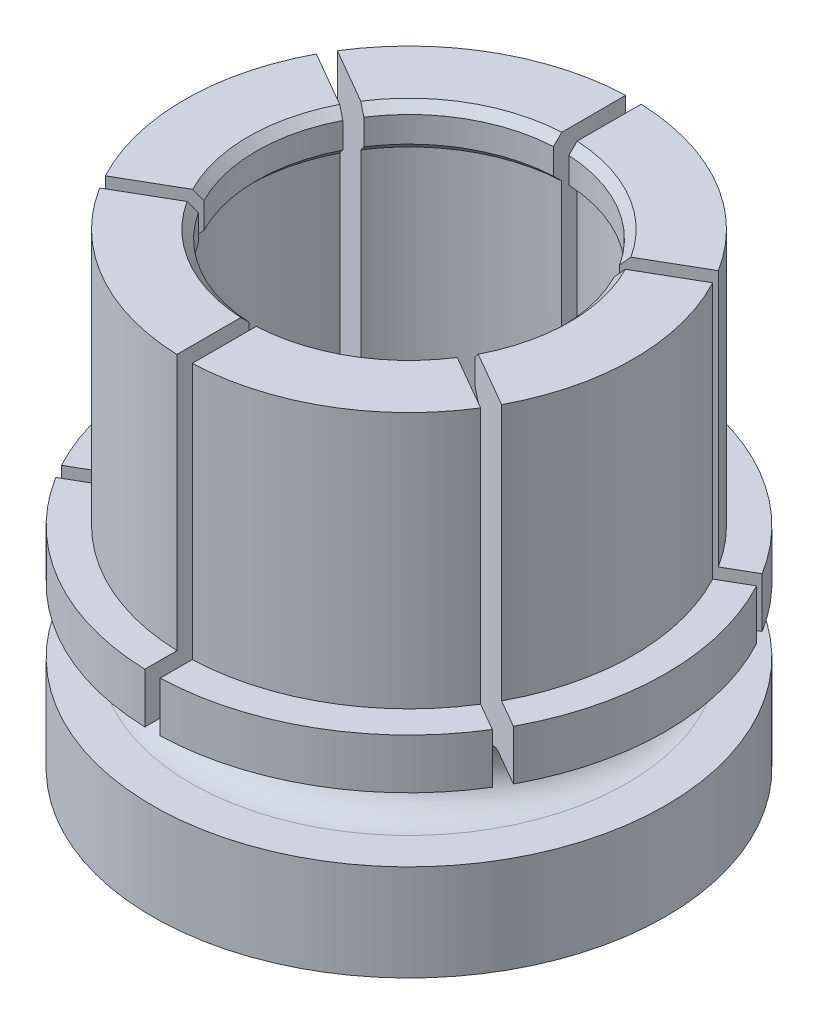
ISO-10303-21;
HEADER;
FILE_DESCRIPTION(('STEP AP214'),'2;1');
FILE_NAME('part.step','',(''),(''),'','','');
FILE_SCHEMA(('AUTOMOTIVE_DESIGN { 1 0 10303 214 1 1 1 1 }'));
ENDSEC;
DATA;
#1=APPLICATION_CONTEXT('core data for automotive mechanical design processes');
#2=APPLICATION_PROTOCOL_DEFINITION('international standard','automotive_design',2000,#1);
#3=PRODUCT_CONTEXT('',#1,'mechanical');
#4=PRODUCT('Part','Part','',(#3));
#5=PRODUCT_RELATED_PRODUCT_CATEGORY('part','',(#4));
#6=PRODUCT_DEFINITION_FORMATION('','',#4);
#7=PRODUCT_DEFINITION_CONTEXT('part definition',#1,'design');
#8=PRODUCT_DEFINITION('design','',#6,#7);
#9=PRODUCT_DEFINITION_SHAPE('','',#8);
#10=(LENGTH_UNIT() NAMED_UNIT(*) SI_UNIT(.MILLI.,.METRE.));
#11=(NAMED_UNIT(*) PLANE_ANGLE_UNIT() SI_UNIT($,.RADIAN.));
#12=(NAMED_UNIT(*) SI_UNIT($,.STERADIAN.) SOLID_ANGLE_UNIT());
#13=UNCERTAINTY_MEASURE_WITH_UNIT(LENGTH_MEASURE(1.E-05),#10,'distance_accuracy_value','');
#14=(GEOMETRIC_REPRESENTATION_CONTEXT(3) GLOBAL_UNCERTAINTY_ASSIGNED_CONTEXT((#13)) GLOBAL_UNIT_ASSIGNED_CONTEXT((#10,
#11,#12)) REPRESENTATION_CONTEXT('',''));
#15=CARTESIAN_POINT('',(0.,0.,0.));
#16=DIRECTION('',(0.,0.,1.));
#17=DIRECTION('',(1.,0.,0.));
#18=AXIS2_PLACEMENT_3D('',#15,#16,#17);
#19=CARTESIAN_POINT('',(0.,0.,0.));
#20=DIRECTION('',(0.,1.,0.));
#21=DIRECTION('',(-1.,0.,0.));
#22=AXIS2_PLACEMENT_3D('',#19,#20,#21);
#23=CYLINDRICAL_SURFACE('',#22,12.7);
#24=CARTESIAN_POINT('',(0.,-23.114,0.));
#25=DIRECTION('',(0.,1.,0.));
#26=DIRECTION('',(-1.,0.,0.));
#27=AXIS2_PLACEMENT_3D('',#24,#25,#26);
#28=CIRCLE('',#27,12.7);
#29=CARTESIAN_POINT('',(-12.7,-23.114,0.));
#30=VERTEX_POINT('',#29);
#31=EDGE_CURVE('E939',#30,#30,#28,.T.);
#32=ORIENTED_EDGE('',*,*,#31,.T.);
#33=EDGE_LOOP('',(#32));
#34=FACE_BOUND('',#33,.T.);
#35=CARTESIAN_POINT('',(0.,-18.3515,0.));
#36=DIRECTION('',(0.,1.,0.));
#37=DIRECTION('',(-1.,0.,0.));
#38=AXIS2_PLACEMENT_3D('',#35,#36,#37);
#39=CIRCLE('',#38,12.7);
#40=CARTESIAN_POINT('',(-12.7,-18.3515,0.));
#41=VERTEX_POINT('',#40);
#42=EDGE_CURVE('E1290',#41,#41,#39,.T.);
#43=ORIENTED_EDGE('',*,*,#42,.F.);
#44=EDGE_LOOP('',(#43));
#45=FACE_BOUND('',#44,.T.);
#46=ADVANCED_FACE('F32',(#34,#45),#23,.T.);
#47=CARTESIAN_POINT('',(0.,-15.1765,0.));
#48=DIRECTION('',(0.,1.,0.));
#49=DIRECTION('',(-1.,0.,0.));
#50=AXIS2_PLACEMENT_3D('',#47,#48,#49);
#51=CIRCLE('',#50,12.7);
#52=CARTESIAN_POINT('',(0.381,-15.1765,12.694283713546));
#53=VERTEX_POINT('',#52);
#54=CARTESIAN_POINT('',(10.8030721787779,-15.1765,6.67709753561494));
#55=VERTEX_POINT('',#54);
#56=EDGE_CURVE('E922',#53,#55,#51,.T.);
#57=ORIENTED_EDGE('',*,*,#56,.T.);
#58=DIRECTION('',(0.,1.,0.));
#59=VECTOR('',#58,1.);
#60=CARTESIAN_POINT('',(10.8030721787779,0.,6.67709753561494));
#61=LINE('',#60,#59);
#62=CARTESIAN_POINT('',(10.8030721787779,-12.7,6.67709753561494));
#63=VERTEX_POINT('',#62);
#64=EDGE_CURVE('E1266',#55,#63,#61,.T.);
#65=ORIENTED_EDGE('',*,*,#64,.T.);
#66=CARTESIAN_POINT('',(0.,-12.7,0.));
#67=DIRECTION('',(0.,1.,0.));
#68=DIRECTION('',(-1.,0.,0.));
#69=AXIS2_PLACEMENT_3D('',#66,#67,#68);
#70=CIRCLE('',#69,12.7);
#71=CARTESIAN_POINT('',(0.381000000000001,-12.7,12.694283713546));
#72=VERTEX_POINT('',#71);
#73=EDGE_CURVE('E935',#72,#63,#70,.T.);
#74=ORIENTED_EDGE('',*,*,#73,.F.);
#75=DIRECTION('',(0.,1.,0.));
#76=VECTOR('',#75,1.);
#77=CARTESIAN_POINT('',(0.381000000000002,0.,12.694283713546));
#78=LINE('',#77,#76);
#79=EDGE_CURVE('E1047',#72,#53,#78,.F.);
#80=ORIENTED_EDGE('',*,*,#79,.T.);
#81=EDGE_LOOP('',(#57,#65,#74,#80));
#82=FACE_BOUND('',#81,.T.);
#83=ADVANCED_FACE('F890',(#82),#23,.T.);
#84=CARTESIAN_POINT('',(-10.803072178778,-15.1765,6.67709753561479));
#85=VERTEX_POINT('',#84);
#86=CARTESIAN_POINT('',(-0.381,-15.1765,12.694283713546));
#87=VERTEX_POINT('',#86);
#88=EDGE_CURVE('E1288',#85,#87,#51,.T.);
#89=ORIENTED_EDGE('',*,*,#88,.T.);
#90=DIRECTION('',(0.,1.,0.));
#91=VECTOR('',#90,1.);
#92=CARTESIAN_POINT('',(-0.381000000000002,0.,12.694283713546));
#93=LINE('',#92,#91);
#94=CARTESIAN_POINT('',(-0.381000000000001,-12.7,12.694283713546));
#95=VERTEX_POINT('',#94);
#96=EDGE_CURVE('E1084',#87,#95,#93,.T.);
#97=ORIENTED_EDGE('',*,*,#96,.T.);
#98=CARTESIAN_POINT('',(-10.803072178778,-12.7,6.67709753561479));
#99=VERTEX_POINT('',#98);
#100=EDGE_CURVE('E946',#99,#95,#70,.T.);
#101=ORIENTED_EDGE('',*,*,#100,.F.);
#102=DIRECTION('',(0.,1.,0.));
#103=VECTOR('',#102,1.);
#104=CARTESIAN_POINT('',(-10.803072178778,0.,6.67709753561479));
#105=LINE('',#104,#103);
#106=EDGE_CURVE('E1208',#99,#85,#105,.F.);
#107=ORIENTED_EDGE('',*,*,#106,.T.);
#108=EDGE_LOOP('',(#89,#97,#101,#107));
#109=FACE_BOUND('',#108,.T.);
#110=ADVANCED_FACE('F897',(#109),#23,.T.);
#111=CARTESIAN_POINT('',(-11.1840721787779,-15.1765,-6.0171861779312));
#112=VERTEX_POINT('',#111);
#113=CARTESIAN_POINT('',(-11.184072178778,-15.1765,6.01718617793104));
#114=VERTEX_POINT('',#113);
#115=EDGE_CURVE('E1226',#112,#114,#51,.T.);
#116=ORIENTED_EDGE('',*,*,#115,.T.);
#117=DIRECTION('',(0.,1.,0.));
#118=VECTOR('',#117,1.);
#119=CARTESIAN_POINT('',(-11.184072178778,0.,6.01718617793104));
#120=LINE('',#119,#118);
#121=CARTESIAN_POINT('',(-11.184072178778,-12.7,6.01718617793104));
#122=VERTEX_POINT('',#121);
#123=EDGE_CURVE('E466',#114,#122,#120,.T.);
#124=ORIENTED_EDGE('',*,*,#123,.T.);
#125=CARTESIAN_POINT('',(-11.1840721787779,-12.7,-6.01718617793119));
#126=VERTEX_POINT('',#125);
#127=EDGE_CURVE('E942',#126,#122,#70,.T.);
#128=ORIENTED_EDGE('',*,*,#127,.F.);
#129=DIRECTION('',(0.,1.,0.));
#130=VECTOR('',#129,1.);
#131=CARTESIAN_POINT('',(-11.1840721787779,0.,-6.01718617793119));
#132=LINE('',#131,#130);
#133=EDGE_CURVE('E1212',#126,#112,#132,.F.);
#134=ORIENTED_EDGE('',*,*,#133,.T.);
#135=EDGE_LOOP('',(#116,#124,#128,#134));
#136=FACE_BOUND('',#135,.T.);
#137=ADVANCED_FACE('F1225',(#136),#23,.T.);
#138=CARTESIAN_POINT('',(-0.381,-15.1765,-12.694283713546));
#139=VERTEX_POINT('',#138);
#140=CARTESIAN_POINT('',(-10.8030721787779,-15.1765,-6.67709753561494));
#141=VERTEX_POINT('',#140);
#142=EDGE_CURVE('E1291',#139,#141,#51,.T.);
#143=ORIENTED_EDGE('',*,*,#142,.T.);
#144=DIRECTION('',(0.,1.,0.));
#145=VECTOR('',#144,1.);
#146=CARTESIAN_POINT('',(-10.8030721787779,0.,-6.67709753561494));
#147=LINE('',#146,#145);
#148=CARTESIAN_POINT('',(-10.8030721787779,-12.7,-6.67709753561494));
#149=VERTEX_POINT('',#148);
#150=EDGE_CURVE('E1215',#141,#149,#147,.T.);
#151=ORIENTED_EDGE('',*,*,#150,.T.);
#152=CARTESIAN_POINT('',(-0.381000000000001,-12.7,-12.694283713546));
#153=VERTEX_POINT('',#152);
#154=EDGE_CURVE('E940',#153,#149,#70,.T.);
#155=ORIENTED_EDGE('',*,*,#154,.F.);
#156=DIRECTION('',(0.,1.,0.));
#157=VECTOR('',#156,1.);
#158=CARTESIAN_POINT('',(-0.381000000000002,0.,-12.694283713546));
#159=LINE('',#158,#157);
#160=EDGE_CURVE('E994',#153,#139,#159,.F.);
#161=ORIENTED_EDGE('',*,*,#160,.T.);
#162=EDGE_LOOP('',(#143,#151,#155,#161));
#163=FACE_BOUND('',#162,.T.);
#164=ADVANCED_FACE('F911',(#163),#23,.T.);
#165=CARTESIAN_POINT('',(10.803072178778,-15.1765,-6.67709753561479));
#166=VERTEX_POINT('',#165);
#167=CARTESIAN_POINT('',(0.381,-15.1765,-12.694283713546));
#168=VERTEX_POINT('',#167);
#169=EDGE_CURVE('E923',#166,#168,#51,.T.);
#170=ORIENTED_EDGE('',*,*,#169,.T.);
#171=DIRECTION('',(0.,1.,0.));
#172=VECTOR('',#171,1.);
#173=CARTESIAN_POINT('',(0.381000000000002,0.,-12.694283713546));
#174=LINE('',#173,#172);
#175=CARTESIAN_POINT('',(0.381000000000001,-12.7,-12.694283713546));
#176=VERTEX_POINT('',#175);
#177=EDGE_CURVE('E1071',#168,#176,#174,.T.);
#178=ORIENTED_EDGE('',*,*,#177,.T.);
#179=CARTESIAN_POINT('',(10.803072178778,-12.7,-6.67709753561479));
#180=VERTEX_POINT('',#179);
#181=EDGE_CURVE('E936',#180,#176,#70,.T.);
#182=ORIENTED_EDGE('',*,*,#181,.F.);
#183=DIRECTION('',(0.,1.,0.));
#184=VECTOR('',#183,1.);
#185=CARTESIAN_POINT('',(10.803072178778,0.,-6.67709753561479));
#186=LINE('',#185,#184);
#187=EDGE_CURVE('E511',#180,#166,#186,.F.);
#188=ORIENTED_EDGE('',*,*,#187,.T.);
#189=EDGE_LOOP('',(#170,#178,#182,#188));
#190=FACE_BOUND('',#189,.T.);
#191=ADVANCED_FACE('F903',(#190),#23,.T.);
#192=CARTESIAN_POINT('',(11.1840721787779,-15.1765,6.0171861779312));
#193=VERTEX_POINT('',#192);
#194=CARTESIAN_POINT('',(11.184072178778,-15.1765,-6.01718617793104));
#195=VERTEX_POINT('',#194);
#196=EDGE_CURVE('E915',#193,#195,#51,.T.);
#197=ORIENTED_EDGE('',*,*,#196,.T.);
#198=DIRECTION('',(0.,1.,0.));
#199=VECTOR('',#198,1.);
#200=CARTESIAN_POINT('',(11.184072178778,0.,-6.01718617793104));
#201=LINE('',#200,#199);
#202=CARTESIAN_POINT('',(11.184072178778,-12.7,-6.01718617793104));
#203=VERTEX_POINT('',#202);
#204=EDGE_CURVE('E844',#195,#203,#201,.T.);
#205=ORIENTED_EDGE('',*,*,#204,.T.);
#206=CARTESIAN_POINT('',(11.1840721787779,-12.7,6.0171861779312));
#207=VERTEX_POINT('',#206);
#208=EDGE_CURVE('E932',#207,#203,#70,.T.);
#209=ORIENTED_EDGE('',*,*,#208,.F.);
#210=DIRECTION('',(0.,1.,0.));
#211=VECTOR('',#210,1.);
#212=CARTESIAN_POINT('',(11.1840721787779,0.,6.01718617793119));
#213=LINE('',#212,#211);
#214=EDGE_CURVE('E919',#207,#193,#213,.F.);
#215=ORIENTED_EDGE('',*,*,#214,.T.);
#216=EDGE_LOOP('',(#197,#205,#209,#215));
#217=FACE_BOUND('',#216,.T.);
#218=ADVANCED_FACE('F893',(#217),#23,.T.);
#219=CARTESIAN_POINT('',(0.381000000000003,3.44475912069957,-12.7));
#220=DIRECTION('',(1.,0.,0.));
#221=DIRECTION('',(0.,1.,0.));
#222=AXIS2_PLACEMENT_3D('',#219,#220,#221);
#223=PLANE('',#222);
#224=CARTESIAN_POINT('',(0.380999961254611,-16.4597525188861,9.22906653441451));
#225=CARTESIAN_POINT('',(0.380999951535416,-16.5472004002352,9.21197991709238));
#226=CARTESIAN_POINT('',(0.380999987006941,-16.6361548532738,9.20226572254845));
#227=CARTESIAN_POINT('',(0.381000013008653,-16.8145057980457,9.1979048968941));
#228=CARTESIAN_POINT('',(0.38100000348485,-16.9039026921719,9.2032763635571));
#229=CARTESIAN_POINT('',(0.380999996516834,-17.0804897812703,9.22895301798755));
#230=CARTESIAN_POINT('',(0.380999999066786,-17.1676810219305,9.24925098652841));
#231=CARTESIAN_POINT('',(0.381000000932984,-17.3373950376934,9.30418942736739));
#232=CARTESIAN_POINT('',(0.381000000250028,-17.4199189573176,9.33882636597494));
#233=CARTESIAN_POINT('',(0.380999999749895,-17.5780103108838,9.42146712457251));
#234=CARTESIAN_POINT('',(0.380999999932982,-17.6535756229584,9.46947500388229));
#235=CARTESIAN_POINT('',(0.381000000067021,-17.7955841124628,9.57748916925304));
#236=CARTESIAN_POINT('',(0.381000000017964,-17.8620269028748,9.63749596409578));
#237=CARTESIAN_POINT('',(0.380999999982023,-17.9839504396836,9.76784703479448));
#238=CARTESIAN_POINT('',(0.380999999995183,-18.0394235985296,9.83819840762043));
#239=CARTESIAN_POINT('',(0.381000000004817,-18.1377817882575,9.98720997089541));
#240=CARTESIAN_POINT('',(0.381000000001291,-18.1806667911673,10.0658701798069));
#241=CARTESIAN_POINT('',(0.380999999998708,-18.2526631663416,10.229328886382));
#242=CARTESIAN_POINT('',(0.380999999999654,-18.281764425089,10.3141318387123));
#243=CARTESIAN_POINT('',(0.381000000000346,-18.3253228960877,10.4874186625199));
#244=CARTESIAN_POINT('',(0.381000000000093,-18.3397800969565,10.5759025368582));
#245=CARTESIAN_POINT('',(0.380999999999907,-18.3536432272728,10.7540761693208));
#246=CARTESIAN_POINT('',(0.380999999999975,-18.3530433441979,10.8437663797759));
#247=CARTESIAN_POINT('',(0.381000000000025,-18.3367934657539,11.0217731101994));
#248=CARTESIAN_POINT('',(0.381000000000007,-18.3211434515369,11.1100896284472));
#249=CARTESIAN_POINT('',(0.380999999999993,-18.2752364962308,11.2828349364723));
#250=CARTESIAN_POINT('',(0.380999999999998,-18.2449805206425,11.3672639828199));
#251=CARTESIAN_POINT('',(0.381000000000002,-18.1707180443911,11.5298411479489));
#252=CARTESIAN_POINT('',(0.381,-18.1267115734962,11.6079892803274));
#253=CARTESIAN_POINT('',(0.380999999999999,-18.0262152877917,11.7557524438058));
#254=CARTESIAN_POINT('',(0.381,-17.9697304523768,11.8253708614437));
#255=CARTESIAN_POINT('',(0.381,-17.845869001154,11.9541303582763));
#256=CARTESIAN_POINT('',(0.381,-17.778492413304,12.0132714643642));
#257=CARTESIAN_POINT('',(0.381,-17.6347978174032,12.11936479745));
#258=CARTESIAN_POINT('',(0.381,-17.5584844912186,12.1663233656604));
#259=CARTESIAN_POINT('',(0.381,-17.399054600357,12.2467553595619));
#260=CARTESIAN_POINT('',(0.381,-17.3159380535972,12.2802288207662));
#261=CARTESIAN_POINT('',(0.381,-17.1453014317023,12.3327254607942));
#262=CARTESIAN_POINT('',(0.381,-17.057783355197,12.3517551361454));
#263=CARTESIAN_POINT('',(0.381,-16.880794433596,12.3748473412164));
#264=CARTESIAN_POINT('',(0.381,-16.7913235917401,12.3789098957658));
#265=CARTESIAN_POINT('',(0.381,-16.6129923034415,12.3719530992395));
#266=CARTESIAN_POINT('',(0.381,-16.52413171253,12.3609374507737));
#267=CARTESIAN_POINT('',(0.381,-16.3495211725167,12.324144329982));
#268=CARTESIAN_POINT('',(0.381,-16.2637712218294,12.2983668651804));
#269=CARTESIAN_POINT('',(0.381,-16.0978135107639,12.2327827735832));
#270=CARTESIAN_POINT('',(0.381,-16.0176058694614,12.1929758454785));
#271=CARTESIAN_POINT('',(0.381,-15.8650094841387,12.1004648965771));
#272=CARTESIAN_POINT('',(0.380999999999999,-15.7926207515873,12.0477608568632));
#273=CARTESIAN_POINT('',(0.381000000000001,-15.6576943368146,11.9309367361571));
#274=CARTESIAN_POINT('',(0.381000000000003,-15.59515945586,11.8668134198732));
#275=CARTESIAN_POINT('',(0.380999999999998,-15.4817366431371,11.7289826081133));
#276=CARTESIAN_POINT('',(0.380999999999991,-15.4308487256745,11.6552751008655));
#277=CARTESIAN_POINT('',(0.381000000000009,-15.3421383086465,11.5003312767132));
#278=CARTESIAN_POINT('',(0.381000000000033,-15.3043219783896,11.4190914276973));
#279=CARTESIAN_POINT('',(0.380999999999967,-15.2428570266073,11.2514180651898));
#280=CARTESIAN_POINT('',(0.380999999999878,-15.2192084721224,11.1649845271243));
#281=CARTESIAN_POINT('',(0.381000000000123,-15.1867382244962,10.9893298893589));
#282=CARTESIAN_POINT('',(0.381000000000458,-15.177924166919,10.9001073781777));
#283=CARTESIAN_POINT('',(0.380999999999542,-15.1753944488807,10.7214483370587));
#284=CARTESIAN_POINT('',(0.380999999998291,-15.181678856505,10.6320118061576));
#285=CARTESIAN_POINT('',(0.381000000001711,-15.2091723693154,10.455428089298));
#286=CARTESIAN_POINT('',(0.381000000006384,-15.230387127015,10.368281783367));
#287=CARTESIAN_POINT('',(0.380999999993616,-15.2871453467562,10.1987909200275));
#288=CARTESIAN_POINT('',(0.380999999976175,-15.3226882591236,10.1164461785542));
#289=CARTESIAN_POINT('',(0.381000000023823,-15.4070910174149,9.95890216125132));
#290=CARTESIAN_POINT('',(0.381000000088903,-15.4559494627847,9.88370213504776));
#291=CARTESIAN_POINT('',(0.380999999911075,-15.5656178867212,9.74255724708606));
#292=CARTESIAN_POINT('',(0.380999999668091,-15.6264308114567,9.67661467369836));
#293=CARTESIAN_POINT('',(0.381000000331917,-15.7582661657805,9.55588745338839));
#294=CARTESIAN_POINT('',(0.381000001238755,-15.8292888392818,9.50110307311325));
#295=CARTESIAN_POINT('',(0.380999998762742,-15.9794764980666,9.40430378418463));
#296=CARTESIAN_POINT('',(0.380999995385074,-16.0586315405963,9.36227352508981));
#297=CARTESIAN_POINT('',(0.381000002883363,-16.1919619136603,9.3052977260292));
#298=CARTESIAN_POINT('',(0.381000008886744,-16.2443662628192,9.28610685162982));
#299=CARTESIAN_POINT('',(0.380999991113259,-16.3509012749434,9.25333723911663));
#300=CARTESIAN_POINT('',(0.380999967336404,-16.405031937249,9.23975849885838));
#301=CARTESIAN_POINT('',(0.380999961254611,-16.4597525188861,9.22906653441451));
#302=B_SPLINE_CURVE_WITH_KNOTS('',3,(#224,#225,#226,#227,#228,#229,#230,#231,#232,#233,#234,
#235,#236,#237,#238,#239,#240,#241,#242,#243,#244,#245,#246,#247,#248,#249,#250,#251,#252,#253,
#254,#255,#256,#257,#258,#259,#260,#261,#262,#263,#264,#265,#266,#267,#268,#269,#270,#271,#272,
#273,#274,#275,#276,#277,#278,#279,#280,#281,#282,#283,#284,#285,#286,#287,#288,#289,#290,#291,
#292,#293,#294,#295,#296,#297,#298,#299,#300,#301),.UNSPECIFIED.,.T.,.F.,(4,2,2,2,2,2,2,2,2,2,2,
2,2,2,2,2,2,2,2,2,2,2,2,2,2,2,2,2,2,2,2,2,2,2,2,2,2,2,4),(0.,0.267101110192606,
0.534522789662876,0.801815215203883,1.06904180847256,1.33634961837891,1.60366876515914,
1.87117217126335,2.13867617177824,2.40637614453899,2.67407632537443,2.94187984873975,
3.20968370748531,3.47746986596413,3.7452554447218,4.0129343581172,4.28061258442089,
4.54815119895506,4.81568910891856,5.08310661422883,5.35052367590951,5.617875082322,
5.88522635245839,6.15258336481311,6.41994076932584,6.68737404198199,6.9548076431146,
7.22236729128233,7.48992820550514,7.75762679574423,8.02532659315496,8.29312779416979,
8.56091872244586,8.82868149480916,9.09651033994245,9.36434558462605,9.63185718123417,
9.7989959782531,9.96613471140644),.UNSPECIFIED.);
#303=CARTESIAN_POINT('',(0.381,-15.1765,10.7882743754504));
#304=VERTEX_POINT('',#303);
#305=CARTESIAN_POINT('',(0.381,-16.764,9.1996138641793));
#306=VERTEX_POINT('',#305);
#307=EDGE_CURVE('E472',#304,#306,#302,.T.);
#308=ORIENTED_EDGE('',*,*,#307,.F.);
#309=DIRECTION('',(0.,0.,-1.));
#310=VECTOR('',#309,1.);
#311=CARTESIAN_POINT('',(0.381,-15.1765,-12.7));
#312=LINE('',#311,#310);
#313=EDGE_CURVE('E489',#53,#304,#312,.T.);
#314=ORIENTED_EDGE('',*,*,#313,.F.);
#315=ORIENTED_EDGE('',*,*,#79,.F.);
#316=DIRECTION('',(0.,0.,1.));
#317=VECTOR('',#316,1.);
#318=CARTESIAN_POINT('',(0.381000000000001,-12.7,0.));
#319=LINE('',#318,#317);
#320=CARTESIAN_POINT('',(0.381000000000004,-12.7,11.1059666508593));
#321=VERTEX_POINT('',#320);
#322=EDGE_CURVE('E1044',#321,#72,#319,.T.);
#323=ORIENTED_EDGE('',*,*,#322,.F.);
#324=DIRECTION('',(0.,1.,0.));
#325=VECTOR('',#324,1.);
#326=CARTESIAN_POINT('',(0.381000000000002,0.,11.1059666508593));
#327=LINE('',#326,#325);
#328=CARTESIAN_POINT('',(0.381000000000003,0.,11.1059666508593));
#329=VERTEX_POINT('',#328);
#330=EDGE_CURVE('E1039',#329,#321,#327,.F.);
#331=ORIENTED_EDGE('',*,*,#330,.F.);
#332=DIRECTION('',(0.,0.,1.));
#333=VECTOR('',#332,1.);
#334=CARTESIAN_POINT('',(0.381000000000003,0.,0.));
#335=LINE('',#334,#333);
#336=CARTESIAN_POINT('',(0.381000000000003,0.,7.94106535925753));
#337=VERTEX_POINT('',#336);
#338=EDGE_CURVE('E1198',#337,#329,#335,.T.);
#339=ORIENTED_EDGE('',*,*,#338,.F.);
#340=CARTESIAN_POINT('',(0.381000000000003,9.54359471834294,-17.4896452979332));
#341=CARTESIAN_POINT('',(0.381000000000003,8.94009504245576,-16.8860013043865));
#342=CARTESIAN_POINT('',(0.381000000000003,8.33660170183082,-16.2823509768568));
#343=CARTESIAN_POINT('',(0.381000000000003,7.12963573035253,-15.0750293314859));
#344=CARTESIAN_POINT('',(0.381000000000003,6.52616309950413,-14.4713580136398));
#345=CARTESIAN_POINT('',(0.381000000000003,5.3192435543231,-13.2639830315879));
#346=CARTESIAN_POINT('',(0.381000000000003,4.71579664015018,-12.6602793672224));
#347=CARTESIAN_POINT('',(0.381000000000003,3.50894744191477,-11.4528277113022));
#348=CARTESIAN_POINT('',(0.381000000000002,2.90554515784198,-10.8490797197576));
#349=CARTESIAN_POINT('',(0.381000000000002,1.698264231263,-9.64096563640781));
#350=CARTESIAN_POINT('',(0.381000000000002,1.09438565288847,-9.03659948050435));
#351=CARTESIAN_POINT('',(0.381000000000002,-0.113242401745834,-7.82773740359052));
#352=CARTESIAN_POINT('',(0.381000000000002,-0.716991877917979,-7.22324148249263));
#353=CARTESIAN_POINT('',(0.381000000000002,-1.92424475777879,-6.01400782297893));
#354=CARTESIAN_POINT('',(0.381000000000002,-2.52774816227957,-5.40927008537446));
#355=CARTESIAN_POINT('',(0.381000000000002,-3.43250119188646,-4.50166362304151));
#356=CARTESIAN_POINT('',(0.381000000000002,-3.73400169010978,-4.19904499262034));
#357=CARTESIAN_POINT('',(0.381000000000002,-4.33668949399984,-3.59349606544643));
#358=CARTESIAN_POINT('',(0.381000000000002,-4.63787679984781,-3.29056576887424));
#359=CARTESIAN_POINT('',(0.381000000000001,-5.02111818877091,-2.90421473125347));
#360=CARTESIAN_POINT('',(0.381000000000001,-5.10349634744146,-2.8211155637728));
#361=CARTESIAN_POINT('',(0.381000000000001,-5.26817974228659,-2.65484499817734));
#362=CARTESIAN_POINT('',(0.381000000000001,-5.35048497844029,-2.57167360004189));
#363=CARTESIAN_POINT('',(0.381000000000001,-5.59724842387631,-2.32204087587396));
#364=CARTESIAN_POINT('',(0.381000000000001,-5.76157056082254,-2.15544471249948));
#365=CARTESIAN_POINT('',(0.381000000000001,-6.03522382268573,-1.87680699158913));
#366=CARTESIAN_POINT('',(0.381000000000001,-6.14475352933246,-1.7649604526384));
#367=CARTESIAN_POINT('',(0.381000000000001,-6.36328588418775,-1.54071139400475));
#368=CARTESIAN_POINT('',(0.381000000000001,-6.47228843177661,-1.4283087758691));
#369=CARTESIAN_POINT('',(0.381000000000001,-6.65333667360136,-1.23980862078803));
#370=CARTESIAN_POINT('',(0.381000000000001,-6.72568200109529,-1.16399893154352));
#371=CARTESIAN_POINT('',(0.381000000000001,-6.86950566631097,-1.01162968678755));
#372=CARTESIAN_POINT('',(0.381000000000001,-6.94098443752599,-0.935070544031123));
#373=CARTESIAN_POINT('',(0.381000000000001,-7.05893123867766,-0.805996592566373));
#374=CARTESIAN_POINT('',(0.381000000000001,-7.10585606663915,-0.753899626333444));
#375=CARTESIAN_POINT('',(0.381000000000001,-7.19850837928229,-0.648486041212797));
#376=CARTESIAN_POINT('',(0.381000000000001,-7.24423386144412,-0.595167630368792));
#377=CARTESIAN_POINT('',(0.381000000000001,-7.30857919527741,-0.516436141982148));
#378=CARTESIAN_POINT('',(0.381000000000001,-7.32822728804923,-0.491867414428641));
#379=CARTESIAN_POINT('',(0.381000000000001,-7.36676100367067,-0.442141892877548));
#380=CARTESIAN_POINT('',(0.381000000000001,-7.38564677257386,-0.416985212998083));
#381=CARTESIAN_POINT('',(0.381000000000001,-7.4222677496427,-0.365881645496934));
#382=CARTESIAN_POINT('',(0.381000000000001,-7.44000419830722,-0.339935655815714));
#383=CARTESIAN_POINT('',(0.381000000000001,-7.47368794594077,-0.286920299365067));
#384=CARTESIAN_POINT('',(0.381000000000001,-7.48963728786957,-0.259852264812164));
#385=CARTESIAN_POINT('',(0.381000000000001,-7.51667172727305,-0.207870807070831));
#386=CARTESIAN_POINT('',(0.381000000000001,-7.52812196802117,-0.18315232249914));
#387=CARTESIAN_POINT('',(0.381000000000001,-7.54752813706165,-0.132392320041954));
#388=CARTESIAN_POINT('',(0.381000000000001,-7.55549515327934,-0.106355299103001));
#389=CARTESIAN_POINT('',(0.381000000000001,-7.56543492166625,-0.0578124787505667));
#390=CARTESIAN_POINT('',(0.381000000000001,-7.56820829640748,-0.0354785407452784));
#391=CARTESIAN_POINT('',(0.381000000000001,-7.56974237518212,0.00930640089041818));
#392=CARTESIAN_POINT('',(0.381000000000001,-7.56850825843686,0.031757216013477));
#393=CARTESIAN_POINT('',(0.381000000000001,-7.56151755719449,0.0816587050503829));
#394=CARTESIAN_POINT('',(0.381000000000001,-7.55470670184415,0.108954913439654));
#395=CARTESIAN_POINT('',(0.381000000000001,-7.53688435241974,0.162205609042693));
#396=CARTESIAN_POINT('',(0.381000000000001,-7.52584944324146,0.188151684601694));
#397=CARTESIAN_POINT('',(0.381000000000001,-7.50359897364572,0.23366927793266));
#398=CARTESIAN_POINT('',(0.381000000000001,-7.49285702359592,0.253481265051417));
#399=CARTESIAN_POINT('',(0.381000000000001,-7.47018035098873,0.292416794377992));
#400=CARTESIAN_POINT('',(0.381000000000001,-7.45824501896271,0.311539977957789));
#401=CARTESIAN_POINT('',(0.381000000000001,-7.42114752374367,0.368185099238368));
#402=CARTESIAN_POINT('',(0.381000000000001,-7.39474545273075,0.404886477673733));
#403=CARTESIAN_POINT('',(0.381000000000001,-7.34003546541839,0.47717006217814));
#404=CARTESIAN_POINT('',(0.381000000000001,-7.31171642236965,0.512743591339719));
#405=CARTESIAN_POINT('',(0.381000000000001,-7.2540640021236,0.582959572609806));
#406=CARTESIAN_POINT('',(0.381000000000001,-7.22473233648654,0.617603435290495));
#407=CARTESIAN_POINT('',(0.381000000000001,-7.13672861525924,0.719553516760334));
#408=CARTESIAN_POINT('',(0.381000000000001,-7.07711702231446,0.786042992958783));
#409=CARTESIAN_POINT('',(0.381000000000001,-6.95669121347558,0.917929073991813));
#410=CARTESIAN_POINT('',(0.381000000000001,-6.89587679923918,0.983325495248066));
#411=CARTESIAN_POINT('',(0.381000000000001,-6.77350183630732,1.11353223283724));
#412=CARTESIAN_POINT('',(0.381000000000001,-6.71194063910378,1.17834193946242));
#413=CARTESIAN_POINT('',(0.381000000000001,-6.58840014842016,1.30755104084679));
#414=CARTESIAN_POINT('',(0.381000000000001,-6.52642088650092,1.37195046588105));
#415=CARTESIAN_POINT('',(0.381000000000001,-6.34079316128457,1.56400903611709));
#416=CARTESIAN_POINT('',(0.381000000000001,-6.21674192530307,1.69127860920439));
#417=CARTESIAN_POINT('',(0.381000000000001,-5.96815836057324,1.94524365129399));
#418=CARTESIAN_POINT('',(0.381000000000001,-5.84362624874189,2.07193933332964));
#419=CARTESIAN_POINT('',(0.381000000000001,-5.46950555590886,2.45165550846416));
#420=CARTESIAN_POINT('',(0.381000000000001,-5.21946520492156,2.70423075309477));
#421=CARTESIAN_POINT('',(0.381000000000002,-4.71890327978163,3.20890511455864));
#422=CARTESIAN_POINT('',(0.381000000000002,-4.46838170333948,3.46100422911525));
#423=CARTESIAN_POINT('',(0.381000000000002,-3.96703760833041,3.96498342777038));
#424=CARTESIAN_POINT('',(0.381000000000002,-3.71621504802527,4.21686347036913));
#425=CARTESIAN_POINT('',(0.381000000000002,-3.21442146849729,4.72047466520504));
#426=CARTESIAN_POINT('',(0.381000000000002,-2.963450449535,4.97220581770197));
#427=CARTESIAN_POINT('',(0.381000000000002,-2.20916840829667,5.72849575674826));
#428=CARTESIAN_POINT('',(0.381000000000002,-1.70571840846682,6.23291593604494));
#429=CARTESIAN_POINT('',(0.381000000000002,-0.698673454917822,7.24156333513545));
#430=CARTESIAN_POINT('',(0.381000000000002,-0.195078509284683,7.74579056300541));
#431=CARTESIAN_POINT('',(0.381000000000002,1.07920858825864,9.02143874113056));
#432=CARTESIAN_POINT('',(0.381000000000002,1.8499640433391,9.79279645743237));
#433=CARTESIAN_POINT('',(0.381000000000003,3.39159185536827,11.335422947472));
#434=CARTESIAN_POINT('',(0.381000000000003,4.16246421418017,12.1066917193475));
#435=CARTESIAN_POINT('',(0.381000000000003,5.70169984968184,13.6466016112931));
#436=CARTESIAN_POINT('',(0.381000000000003,6.47006293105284,14.4152429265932));
#437=CARTESIAN_POINT('',(0.381000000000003,8.00681277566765,15.9524740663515));
#438=CARTESIAN_POINT('',(0.381000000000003,8.77519953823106,16.7210638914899));
#439=CARTESIAN_POINT('',(0.381000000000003,9.54359471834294,17.4896452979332));
#440=B_SPLINE_CURVE_WITH_KNOTS('',3,(#340,#341,#342,#343,#344,#345,#346,#347,#348,#349,#350,
#351,#352,#353,#354,#355,#356,#357,#358,#359,#360,#361,#362,#363,#364,#365,#366,#367,#368,#369,
#370,#371,#372,#373,#374,#375,#376,#377,#378,#379,#380,#381,#382,#383,#384,#385,#386,#387,#388,
#389,#390,#391,#392,#393,#394,#395,#396,#397,#398,#399,#400,#401,#402,#403,#404,#405,#406,#407,
#408,#409,#410,#411,#412,#413,#414,#415,#416,#417,#418,#419,#420,#421,#422,#423,#424,#425,#426,
#427,#428,#429,#430,#431,#432,#433,#434,#435,#436,#437,#438,#439),.UNSPECIFIED.,.F.,.F.,(4,2,2,
2,2,2,2,2,2,2,2,2,2,2,2,2,2,2,2,2,2,2,2,2,2,2,2,2,2,2,2,2,2,2,2,2,2,2,2,2,2,2,2,2,2,2,2,2,2,4),
(0.,2.56073844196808,5.12147749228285,7.68223062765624,10.2429831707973,12.8060574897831,
15.3691335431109,17.9322010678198,19.2137334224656,20.4952650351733,20.8462987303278,
21.197332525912,21.8993311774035,22.368966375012,22.8386879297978,23.1530564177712,
23.4672605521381,23.6775975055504,23.8882657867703,23.982633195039,24.0769824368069,
24.1712280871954,24.2653648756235,24.3469313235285,24.428236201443,24.4954235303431,
24.5625240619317,24.6464132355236,24.7307743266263,24.79833525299,24.865930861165,
25.0014479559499,25.1378332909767,25.2739984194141,25.5418595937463,25.8097653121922,
26.0779232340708,26.3460611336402,26.8792326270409,27.4121866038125,28.4784063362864,
29.5446311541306,30.6110265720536,31.6774201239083,33.815436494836,35.9533505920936,
39.2246668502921,42.4960423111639,45.7565210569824,49.0169407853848),.UNSPECIFIED.);
#441=CARTESIAN_POINT('',(0.381000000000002,-0.408940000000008,7.53162939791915));
#442=VERTEX_POINT('',#441);
#443=EDGE_CURVE('E1051',#442,#337,#440,.T.);
#444=ORIENTED_EDGE('',*,*,#443,.F.);
#445=DIRECTION('',(0.,1.,0.));
#446=VECTOR('',#445,1.);
#447=CARTESIAN_POINT('',(0.381000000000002,0.,7.53162939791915));
#448=LINE('',#447,#446);
#449=CARTESIAN_POINT('',(0.381000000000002,-1.67894000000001,7.53162939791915));
#450=VERTEX_POINT('',#449);
#451=EDGE_CURVE('E1056',#450,#442,#448,.T.);
#452=ORIENTED_EDGE('',*,*,#451,.F.);
#453=CARTESIAN_POINT('',(0.381000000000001,-11.6314747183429,17.4896452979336));
#454=CARTESIAN_POINT('',(0.381000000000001,-11.0279750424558,16.8860013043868));
#455=CARTESIAN_POINT('',(0.381000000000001,-10.4244817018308,16.2823509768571));
#456=CARTESIAN_POINT('',(0.381000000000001,-9.21751573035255,15.0750293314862));
#457=CARTESIAN_POINT('',(0.381000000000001,-8.61404309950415,14.47135801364));
#458=CARTESIAN_POINT('',(0.381000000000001,-7.40712355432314,13.2639830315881));
#459=CARTESIAN_POINT('',(0.381000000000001,-6.80367664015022,12.6602793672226));
#460=CARTESIAN_POINT('',(0.381000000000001,-5.59682744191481,11.4528277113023));
#461=CARTESIAN_POINT('',(0.381000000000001,-4.99342515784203,10.8490797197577));
#462=CARTESIAN_POINT('',(0.381000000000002,-3.78614423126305,9.64096563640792));
#463=CARTESIAN_POINT('',(0.381000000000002,-3.18226565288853,9.03659948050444));
#464=CARTESIAN_POINT('',(0.381000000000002,-1.97463759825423,7.82773740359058));
#465=CARTESIAN_POINT('',(0.381000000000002,-1.37088812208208,7.22324148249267));
#466=CARTESIAN_POINT('',(0.381000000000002,-0.163635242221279,6.01400782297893));
#467=CARTESIAN_POINT('',(0.381000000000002,0.439868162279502,5.40927008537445));
#468=CARTESIAN_POINT('',(0.381000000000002,1.34462119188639,4.50166362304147));
#469=CARTESIAN_POINT('',(0.381000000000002,1.6461216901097,4.19904499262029));
#470=CARTESIAN_POINT('',(0.381000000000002,2.24880949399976,3.59349606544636));
#471=CARTESIAN_POINT('',(0.381000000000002,2.54999679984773,3.29056576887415));
#472=CARTESIAN_POINT('',(0.381000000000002,2.93323818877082,2.90421473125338));
#473=CARTESIAN_POINT('',(0.381000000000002,3.01561634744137,2.82111556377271));
#474=CARTESIAN_POINT('',(0.381000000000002,3.18029974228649,2.65484499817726));
#475=CARTESIAN_POINT('',(0.381000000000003,3.26260497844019,2.57167360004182));
#476=CARTESIAN_POINT('',(0.381000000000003,3.50936842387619,2.32204087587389));
#477=CARTESIAN_POINT('',(0.381000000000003,3.6736905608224,2.15544471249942));
#478=CARTESIAN_POINT('',(0.381000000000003,3.94734382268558,1.87680699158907));
#479=CARTESIAN_POINT('',(0.381000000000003,4.0568735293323,1.76496045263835));
#480=CARTESIAN_POINT('',(0.381000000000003,4.27540588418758,1.5407113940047));
#481=CARTESIAN_POINT('',(0.381000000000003,4.38440843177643,1.42830877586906));
#482=CARTESIAN_POINT('',(0.381000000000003,4.56545667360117,1.23980862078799));
#483=CARTESIAN_POINT('',(0.381000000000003,4.6378020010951,1.16399893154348));
#484=CARTESIAN_POINT('',(0.381000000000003,4.78162566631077,1.01162968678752));
#485=CARTESIAN_POINT('',(0.381000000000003,4.85310443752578,0.935070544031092));
#486=CARTESIAN_POINT('',(0.381000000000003,4.97105123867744,0.805996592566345));
#487=CARTESIAN_POINT('',(0.381000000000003,5.01797606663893,0.753899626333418));
#488=CARTESIAN_POINT('',(0.381000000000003,5.11062837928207,0.648486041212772));
#489=CARTESIAN_POINT('',(0.381000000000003,5.15635386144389,0.595167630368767));
#490=CARTESIAN_POINT('',(0.381000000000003,5.22069919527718,0.516436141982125));
#491=CARTESIAN_POINT('',(0.381000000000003,5.240347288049,0.491867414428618));
#492=CARTESIAN_POINT('',(0.381000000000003,5.27888100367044,0.442141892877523));
#493=CARTESIAN_POINT('',(0.381000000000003,5.29776677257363,0.416985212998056));
#494=CARTESIAN_POINT('',(0.381000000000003,5.33438774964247,0.365881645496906));
#495=CARTESIAN_POINT('',(0.381000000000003,5.35212419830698,0.339935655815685));
#496=CARTESIAN_POINT('',(0.381000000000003,5.38580794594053,0.286920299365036));
#497=CARTESIAN_POINT('',(0.381000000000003,5.40175728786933,0.259852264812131));
#498=CARTESIAN_POINT('',(0.381000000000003,5.42879172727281,0.207870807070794));
#499=CARTESIAN_POINT('',(0.381000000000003,5.44024196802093,0.183152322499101));
#500=CARTESIAN_POINT('',(0.381000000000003,5.45964813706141,0.132392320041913));
#501=CARTESIAN_POINT('',(0.381000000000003,5.46761515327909,0.10635529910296));
#502=CARTESIAN_POINT('',(0.381000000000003,5.47755492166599,0.0578124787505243));
#503=CARTESIAN_POINT('',(0.381000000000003,5.48032829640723,0.0354785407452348));
#504=CARTESIAN_POINT('',(0.381000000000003,5.48186237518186,-0.00930640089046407));
#505=CARTESIAN_POINT('',(0.381000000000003,5.4806282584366,-0.0317572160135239));
#506=CARTESIAN_POINT('',(0.381000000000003,5.47363755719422,-0.0816587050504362));
#507=CARTESIAN_POINT('',(0.381000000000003,5.46682670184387,-0.108954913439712));
#508=CARTESIAN_POINT('',(0.381000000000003,5.44900435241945,-0.162205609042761));
#509=CARTESIAN_POINT('',(0.381000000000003,5.43796944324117,-0.188151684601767));
#510=CARTESIAN_POINT('',(0.381000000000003,5.41571897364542,-0.233669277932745));
#511=CARTESIAN_POINT('',(0.381000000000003,5.40497702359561,-0.253481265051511));
#512=CARTESIAN_POINT('',(0.381000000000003,5.3823003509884,-0.292416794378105));
#513=CARTESIAN_POINT('',(0.381000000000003,5.37036501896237,-0.311539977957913));
#514=CARTESIAN_POINT('',(0.381000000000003,5.33326752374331,-0.368185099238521));
#515=CARTESIAN_POINT('',(0.381000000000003,5.30686545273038,-0.404886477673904));
#516=CARTESIAN_POINT('',(0.381000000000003,5.25215546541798,-0.477170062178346));
#517=CARTESIAN_POINT('',(0.381000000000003,5.22383642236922,-0.512743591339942));
#518=CARTESIAN_POINT('',(0.381000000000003,5.16618400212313,-0.582959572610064));
#519=CARTESIAN_POINT('',(0.381000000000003,5.13685233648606,-0.617603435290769));
#520=CARTESIAN_POINT('',(0.381000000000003,5.04884861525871,-0.71955351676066));
#521=CARTESIAN_POINT('',(0.381000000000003,4.9892370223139,-0.786042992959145));
#522=CARTESIAN_POINT('',(0.381000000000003,4.86881121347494,-0.917929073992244));
#523=CARTESIAN_POINT('',(0.381000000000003,4.80799679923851,-0.983325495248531));
#524=CARTESIAN_POINT('',(0.381000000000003,4.68562183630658,-1.11353223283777));
#525=CARTESIAN_POINT('',(0.381000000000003,4.62406063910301,-1.17834193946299));
#526=CARTESIAN_POINT('',(0.381000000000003,4.50052014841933,-1.30755104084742));
#527=CARTESIAN_POINT('',(0.381000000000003,4.43854088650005,-1.37195046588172));
#528=CARTESIAN_POINT('',(0.381000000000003,4.2529131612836,-1.56400903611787));
#529=CARTESIAN_POINT('',(0.381000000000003,4.12886192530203,-1.69127860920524));
#530=CARTESIAN_POINT('',(0.381000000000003,3.88027836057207,-1.94524365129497));
#531=CARTESIAN_POINT('',(0.381000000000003,3.75574624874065,-2.0719393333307));
#532=CARTESIAN_POINT('',(0.381000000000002,3.38162555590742,-2.45165550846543));
#533=CARTESIAN_POINT('',(0.381000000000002,3.13158520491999,-2.70423075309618));
#534=CARTESIAN_POINT('',(0.381000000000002,2.63102327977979,-3.20890511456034));
#535=CARTESIAN_POINT('',(0.381000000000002,2.3805017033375,-3.46100422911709));
#536=CARTESIAN_POINT('',(0.381000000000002,1.87915760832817,-3.96498342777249));
#537=CARTESIAN_POINT('',(0.381000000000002,1.62833504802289,-4.21686347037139));
#538=CARTESIAN_POINT('',(0.381000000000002,1.12654146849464,-4.72047466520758));
#539=CARTESIAN_POINT('',(0.381000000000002,0.875570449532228,-4.97220581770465));
#540=CARTESIAN_POINT('',(0.381000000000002,0.121288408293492,-5.72849575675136));
#541=CARTESIAN_POINT('',(0.381000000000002,-0.382161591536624,-6.23291593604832));
#542=CARTESIAN_POINT('',(0.381000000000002,-1.38920654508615,-7.2415633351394));
#543=CARTESIAN_POINT('',(0.381000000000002,-1.89280149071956,-7.74579056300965));
#544=CARTESIAN_POINT('',(0.381000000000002,-3.16708858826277,-9.02143874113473));
#545=CARTESIAN_POINT('',(0.381000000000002,-3.93784404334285,-9.79279645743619));
#546=CARTESIAN_POINT('',(0.381000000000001,-5.47947185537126,-11.3354229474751));
#547=CARTESIAN_POINT('',(0.381000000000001,-6.25034421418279,-12.1066917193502));
#548=CARTESIAN_POINT('',(0.381000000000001,-7.78957984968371,-13.6466016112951));
#549=CARTESIAN_POINT('',(0.381000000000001,-8.55794293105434,-14.4152429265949));
#550=CARTESIAN_POINT('',(0.381000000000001,-10.0946927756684,-15.9524740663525));
#551=CARTESIAN_POINT('',(0.381000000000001,-10.8630795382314,-16.7210638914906));
#552=CARTESIAN_POINT('',(0.381000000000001,-11.6314747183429,-17.4896452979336));
#553=B_SPLINE_CURVE_WITH_KNOTS('',3,(#453,#454,#455,#456,#457,#458,#459,#460,#461,#462,#463,
#464,#465,#466,#467,#468,#469,#470,#471,#472,#473,#474,#475,#476,#477,#478,#479,#480,#481,#482,
#483,#484,#485,#486,#487,#488,#489,#490,#491,#492,#493,#494,#495,#496,#497,#498,#499,#500,#501,
#502,#503,#504,#505,#506,#507,#508,#509,#510,#511,#512,#513,#514,#515,#516,#517,#518,#519,#520,
#521,#522,#523,#524,#525,#526,#527,#528,#529,#530,#531,#532,#533,#534,#535,#536,#537,#538,#539,
#540,#541,#542,#543,#544,#545,#546,#547,#548,#549,#550,#551,#552),.UNSPECIFIED.,.F.,.F.,(4,2,2,
2,2,2,2,2,2,2,2,2,2,2,2,2,2,2,2,2,2,2,2,2,2,2,2,2,2,2,2,2,2,2,2,2,2,2,2,2,2,2,2,2,2,2,2,2,2,4),
(0.,2.5607384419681,5.1214774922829,7.68223062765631,10.2429831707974,12.8060574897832,
15.3691335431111,17.93220106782,19.2137334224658,20.4952650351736,20.8462987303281,
21.1973325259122,21.8993311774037,22.3689663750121,22.8386879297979,23.1530564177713,
23.4672605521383,23.6775975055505,23.8882657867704,23.9826331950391,24.076982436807,
24.1712280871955,24.2653648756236,24.3469313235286,24.4282362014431,24.4954235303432,
24.5625240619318,24.6464132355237,24.7307743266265,24.7983352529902,24.8659308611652,
25.0014479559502,25.1378332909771,25.2739984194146,25.5418595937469,25.8097653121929,
26.0779232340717,26.3460611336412,26.8792326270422,27.4121866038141,28.4784063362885,
29.5446311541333,30.611026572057,31.6774201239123,33.8154364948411,35.9533505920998,
39.2246668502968,42.4960423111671,45.7565210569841,49.0169407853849),.UNSPECIFIED.);
#554=CARTESIAN_POINT('',(0.381000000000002,-2.08788,7.94106535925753));
#555=VERTEX_POINT('',#554);
#556=EDGE_CURVE('E688',#555,#450,#553,.T.);
#557=ORIENTED_EDGE('',*,*,#556,.F.);
#558=DIRECTION('',(0.,1.,0.));
#559=VECTOR('',#558,1.);
#560=CARTESIAN_POINT('',(0.381000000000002,0.,7.94106535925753));
#561=LINE('',#560,#559);
#562=CARTESIAN_POINT('',(0.381,-16.764,7.94106535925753));
#563=VERTEX_POINT('',#562);
#564=EDGE_CURVE('E1036',#563,#555,#561,.T.);
#565=ORIENTED_EDGE('',*,*,#564,.F.);
#566=DIRECTION('',(0.,0.,1.));
#567=VECTOR('',#566,1.);
#568=CARTESIAN_POINT('',(0.381,-16.764,-12.7));
#569=LINE('',#568,#567);
#570=EDGE_CURVE('E1035',#563,#306,#569,.T.);
#571=ORIENTED_EDGE('',*,*,#570,.T.);
#572=EDGE_LOOP('',(#308,#314,#315,#323,#331,#339,#444,#452,#557,#565,#571));
#573=FACE_BOUND('',#572,.T.);
#574=ADVANCED_FACE('F637',(#573),#223,.F.);
#575=CARTESIAN_POINT('',(-0.381000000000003,3.44475912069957,-12.7));
#576=DIRECTION('',(-1.,0.,0.));
#577=DIRECTION('',(0.,-1.,0.));
#578=AXIS2_PLACEMENT_3D('',#575,#576,#577);
#579=PLANE('',#578);
#580=CARTESIAN_POINT('',(-0.380999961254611,-16.4597525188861,9.22906653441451));
#581=CARTESIAN_POINT('',(-0.380999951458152,-16.3722626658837,9.24616941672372));
#582=CARTESIAN_POINT('',(-0.380999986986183,-16.2861539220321,9.27067689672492));
#583=CARTESIAN_POINT('',(-0.381000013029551,-16.1192036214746,9.33382589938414));
#584=CARTESIAN_POINT('',(-0.381000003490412,-16.0383685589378,9.37248447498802));
#585=CARTESIAN_POINT('',(-0.380999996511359,-15.8843704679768,9.46280851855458));
#586=CARTESIAN_POINT('',(-0.380999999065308,-15.8112035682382,9.51446737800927));
#587=CARTESIAN_POINT('',(-0.381000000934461,-15.674595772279,9.62931559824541));
#588=CARTESIAN_POINT('',(-0.381000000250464,-15.6111524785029,9.69250210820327));
#589=CARTESIAN_POINT('',(-0.380999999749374,-15.4957230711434,9.82866415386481));
#590=CARTESIAN_POINT('',(-0.380999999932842,-15.4437444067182,9.90164600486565));
#591=CARTESIAN_POINT('',(-0.381000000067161,-15.3527654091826,10.0552982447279));
#592=CARTESIAN_POINT('',(-0.381000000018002,-15.3137656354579,10.1359689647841));
#593=CARTESIAN_POINT('',(-0.380999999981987,-15.2498277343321,10.3027657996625));
#594=CARTESIAN_POINT('',(-0.380999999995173,-15.2248991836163,10.3888955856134));
#595=CARTESIAN_POINT('',(-0.381000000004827,-15.1898506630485,10.5641171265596));
#596=CARTESIAN_POINT('',(-0.381000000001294,-15.1797306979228,10.6532088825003));
#597=CARTESIAN_POINT('',(-0.380999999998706,-15.174585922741,10.8318561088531));
#598=CARTESIAN_POINT('',(-0.380999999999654,-15.1795659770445,10.9214117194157));
#599=CARTESIAN_POINT('',(-0.381000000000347,-15.2044923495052,11.098415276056));
#600=CARTESIAN_POINT('',(-0.381000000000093,-15.2244386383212,11.1858632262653));
#601=CARTESIAN_POINT('',(-0.380999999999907,-15.2787305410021,11.3561568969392));
#602=CARTESIAN_POINT('',(-0.380999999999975,-15.3130743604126,11.4390031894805));
#603=CARTESIAN_POINT('',(-0.381000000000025,-15.3951891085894,11.5977506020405));
#604=CARTESIAN_POINT('',(-0.381000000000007,-15.4429600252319,11.6736517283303));
#605=CARTESIAN_POINT('',(-0.380999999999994,-15.550551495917,11.8163187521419));
#606=CARTESIAN_POINT('',(-0.380999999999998,-15.6103668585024,11.8830885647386));
#607=CARTESIAN_POINT('',(-0.381000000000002,-15.7403635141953,12.0056318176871));
#608=CARTESIAN_POINT('',(-0.381000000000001,-15.8105447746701,12.0614052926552));
#609=CARTESIAN_POINT('',(-0.381,-15.9592416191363,12.1603419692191));
#610=CARTESIAN_POINT('',(-0.381,-16.037752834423,12.2035117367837));
#611=CARTESIAN_POINT('',(-0.381,-16.2009107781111,12.2760511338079));
#612=CARTESIAN_POINT('',(-0.381,-16.2855574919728,12.3054207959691));
#613=CARTESIAN_POINT('',(-0.381,-16.4585446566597,12.3495141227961));
#614=CARTESIAN_POINT('',(-0.381,-16.5468835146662,12.3642440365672));
#615=CARTESIAN_POINT('',(-0.381,-16.7247802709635,12.3786605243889));
#616=CARTESIAN_POINT('',(-0.381,-16.8143381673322,12.3783471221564));
#617=CARTESIAN_POINT('',(-0.381,-16.9921109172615,12.3626875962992));
#618=CARTESIAN_POINT('',(-0.381,-17.0803260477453,12.3473446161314));
#619=CARTESIAN_POINT('',(-0.381,-17.2529285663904,12.3020672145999));
#620=CARTESIAN_POINT('',(-0.381,-17.337315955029,12.2721327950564));
#621=CARTESIAN_POINT('',(-0.381,-17.4998737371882,12.1985217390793));
#622=CARTESIAN_POINT('',(-0.381,-17.578043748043,12.1548442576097));
#623=CARTESIAN_POINT('',(-0.381,-17.725944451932,12.0549895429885));
#624=CARTESIAN_POINT('',(-0.381,-17.7956751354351,11.9988122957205));
#625=CARTESIAN_POINT('',(-0.381,-17.9247421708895,11.8755345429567));
#626=CARTESIAN_POINT('',(-0.381,-17.9840752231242,11.8084305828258));
#627=CARTESIAN_POINT('',(-0.381,-18.0906399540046,11.6652180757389));
#628=CARTESIAN_POINT('',(-0.380999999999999,-18.1378715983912,11.5891095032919));
#629=CARTESIAN_POINT('',(-0.381000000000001,-18.2189176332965,11.4300086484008));
#630=CARTESIAN_POINT('',(-0.381000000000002,-18.2527254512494,11.3470130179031));
#631=CARTESIAN_POINT('',(-0.380999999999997,-18.3059353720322,11.1765257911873));
#632=CARTESIAN_POINT('',(-0.380999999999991,-18.3253374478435,11.0890341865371));
#633=CARTESIAN_POINT('',(-0.381000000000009,-18.3491947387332,10.9119910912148));
#634=CARTESIAN_POINT('',(-0.381000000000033,-18.3536423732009,10.8224385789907));
#635=CARTESIAN_POINT('',(-0.380999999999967,-18.3474451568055,10.6438570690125));
#636=CARTESIAN_POINT('',(-0.380999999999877,-18.3368002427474,10.554828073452));
#637=CARTESIAN_POINT('',(-0.381000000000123,-18.3007143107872,10.3797913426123));
#638=CARTESIAN_POINT('',(-0.381000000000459,-18.2752685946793,10.2937845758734));
#639=CARTESIAN_POINT('',(-0.38099999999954,-18.2102981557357,10.1272638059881));
#640=CARTESIAN_POINT('',(-0.380999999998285,-18.170773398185,10.046749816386));
#641=CARTESIAN_POINT('',(-0.381000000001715,-18.0787664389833,9.89350603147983));
#642=CARTESIAN_POINT('',(-0.3810000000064,-18.0262848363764,9.82077587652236));
#643=CARTESIAN_POINT('',(-0.3809999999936,-17.9098522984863,9.68516731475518));
#644=CARTESIAN_POINT('',(-0.380999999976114,-17.8459018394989,9.62228849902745));
#645=CARTESIAN_POINT('',(-0.381000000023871,-17.7083875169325,9.50820605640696));
#646=CARTESIAN_POINT('',(-0.381000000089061,-17.6348296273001,9.4569952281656));
#647=CARTESIAN_POINT('',(-0.380999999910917,-17.4801340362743,9.36764839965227));
#648=CARTESIAN_POINT('',(-0.380999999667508,-17.39899448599,9.32951559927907));
#649=CARTESIAN_POINT('',(-0.381000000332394,-17.2314935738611,9.26744033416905));
#650=CARTESIAN_POINT('',(-0.38100000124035,-17.1451337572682,9.24349369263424));
#651=CARTESIAN_POINT('',(-0.38099999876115,-16.9696892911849,9.21048212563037));
#652=CARTESIAN_POINT('',(-0.380999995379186,-16.8806080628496,9.2013992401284));
#653=CARTESIAN_POINT('',(-0.381000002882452,-16.7358517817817,9.19888619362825));
#654=CARTESIAN_POINT('',(-0.381000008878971,-16.6802167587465,9.20085292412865));
#655=CARTESIAN_POINT('',(-0.380999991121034,-16.569459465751,9.21060787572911));
#656=CARTESIAN_POINT('',(-0.380999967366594,-16.5143371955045,9.21839609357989));
#657=CARTESIAN_POINT('',(-0.380999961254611,-16.4597525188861,9.22906653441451));
#658=B_SPLINE_CURVE_WITH_KNOTS('',3,(#580,#581,#582,#583,#584,#585,#586,#587,#588,#589,#590,
#591,#592,#593,#594,#595,#596,#597,#598,#599,#600,#601,#602,#603,#604,#605,#606,#607,#608,#609,
#610,#611,#612,#613,#614,#615,#616,#617,#618,#619,#620,#621,#622,#623,#624,#625,#626,#627,#628,
#629,#630,#631,#632,#633,#634,#635,#636,#637,#638,#639,#640,#641,#642,#643,#644,#645,#646,#647,
#648,#649,#650,#651,#652,#653,#654,#655,#656,#657),.UNSPECIFIED.,.T.,.F.,(4,2,2,2,2,2,2,2,2,2,2,
2,2,2,2,2,2,2,2,2,2,2,2,2,2,2,2,2,2,2,2,2,2,2,2,2,2,2,4),(0.,0.267234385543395,
0.534791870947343,0.802213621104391,1.06956932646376,1.33709823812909,1.60463867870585,
1.87236098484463,2.140083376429,2.40789202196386,2.67570014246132,2.94347489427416,
3.21124940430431,3.47890874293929,3.74656723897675,4.01408604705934,4.28160422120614,
4.54900815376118,4.81641166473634,5.08375925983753,5.35110682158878,5.61847082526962,
5.88583513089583,6.15328413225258,6.42073389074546,6.68831443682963,6.9558954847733,
7.22361215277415,7.49132994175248,7.75913275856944,8.02693623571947,8.29472733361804,
8.56250731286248,8.83012157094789,9.09780126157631,9.36540210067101,9.63267935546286,
9.79940624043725,9.96613303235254),.UNSPECIFIED.);
#659=CARTESIAN_POINT('',(-0.381,-16.764,9.1996138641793));
#660=VERTEX_POINT('',#659);
#661=CARTESIAN_POINT('',(-0.381,-15.1765,10.7882743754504));
#662=VERTEX_POINT('',#661);
#663=EDGE_CURVE('E1021',#660,#662,#658,.T.);
#664=ORIENTED_EDGE('',*,*,#663,.F.);
#665=DIRECTION('',(0.,0.,1.));
#666=VECTOR('',#665,1.);
#667=CARTESIAN_POINT('',(-0.381,-16.764,-12.7));
#668=LINE('',#667,#666);
#669=CARTESIAN_POINT('',(-0.381,-16.764,7.94106535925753));
#670=VERTEX_POINT('',#669);
#671=EDGE_CURVE('E982',#670,#660,#668,.T.);
#672=ORIENTED_EDGE('',*,*,#671,.F.);
#673=DIRECTION('',(0.,1.,0.));
#674=VECTOR('',#673,1.);
#675=CARTESIAN_POINT('',(-0.381000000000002,0.,7.94106535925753));
#676=LINE('',#675,#674);
#677=CARTESIAN_POINT('',(-0.381000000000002,-2.08788,7.94106535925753));
#678=VERTEX_POINT('',#677);
#679=EDGE_CURVE('E970',#678,#670,#676,.F.);
#680=ORIENTED_EDGE('',*,*,#679,.F.);
#681=CARTESIAN_POINT('',(-0.381000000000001,-11.6314747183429,-17.4896452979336));
#682=CARTESIAN_POINT('',(-0.381000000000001,-11.0279750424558,-16.8860013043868));
#683=CARTESIAN_POINT('',(-0.381000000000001,-10.4244817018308,-16.2823509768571));
#684=CARTESIAN_POINT('',(-0.381000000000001,-9.21751573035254,-15.0750293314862));
#685=CARTESIAN_POINT('',(-0.381000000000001,-8.61404309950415,-14.47135801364));
#686=CARTESIAN_POINT('',(-0.381000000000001,-7.40712355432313,-13.2639830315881));
#687=CARTESIAN_POINT('',(-0.381000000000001,-6.80367664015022,-12.6602793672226));
#688=CARTESIAN_POINT('',(-0.381000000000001,-5.59682744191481,-11.4528277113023));
#689=CARTESIAN_POINT('',(-0.381000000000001,-4.99342515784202,-10.8490797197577));
#690=CARTESIAN_POINT('',(-0.381000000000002,-3.78614423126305,-9.64096563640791));
#691=CARTESIAN_POINT('',(-0.381000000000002,-3.18226565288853,-9.03659948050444));
#692=CARTESIAN_POINT('',(-0.381000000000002,-1.97463759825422,-7.82773740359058));
#693=CARTESIAN_POINT('',(-0.381000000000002,-1.37088812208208,-7.22324148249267));
#694=CARTESIAN_POINT('',(-0.381000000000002,-0.163635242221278,-6.01400782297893));
#695=CARTESIAN_POINT('',(-0.381000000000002,0.439868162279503,-5.40927008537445));
#696=CARTESIAN_POINT('',(-0.381000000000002,1.34462119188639,-4.50166362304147));
#697=CARTESIAN_POINT('',(-0.381000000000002,1.6461216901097,-4.19904499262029));
#698=CARTESIAN_POINT('',(-0.381000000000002,2.24880949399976,-3.59349606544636));
#699=CARTESIAN_POINT('',(-0.381000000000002,2.54999679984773,-3.29056576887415));
#700=CARTESIAN_POINT('',(-0.381000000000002,2.93323818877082,-2.90421473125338));
#701=CARTESIAN_POINT('',(-0.381000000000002,3.01561634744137,-2.82111556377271));
#702=CARTESIAN_POINT('',(-0.381000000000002,3.18029974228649,-2.65484499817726));
#703=CARTESIAN_POINT('',(-0.381000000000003,3.26260497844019,-2.57167360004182));
#704=CARTESIAN_POINT('',(-0.381000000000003,3.50936842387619,-2.32204087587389));
#705=CARTESIAN_POINT('',(-0.381000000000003,3.6736905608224,-2.15544471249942));
#706=CARTESIAN_POINT('',(-0.381000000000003,3.94734382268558,-1.87680699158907));
#707=CARTESIAN_POINT('',(-0.381000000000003,4.0568735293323,-1.76496045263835));
#708=CARTESIAN_POINT('',(-0.381000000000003,4.27540588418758,-1.5407113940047));
#709=CARTESIAN_POINT('',(-0.381000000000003,4.38440843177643,-1.42830877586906));
#710=CARTESIAN_POINT('',(-0.381000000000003,4.56545667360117,-1.23980862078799));
#711=CARTESIAN_POINT('',(-0.381000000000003,4.6378020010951,-1.16399893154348));
#712=CARTESIAN_POINT('',(-0.381000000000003,4.78162566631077,-1.01162968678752));
#713=CARTESIAN_POINT('',(-0.381000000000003,4.85310443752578,-0.935070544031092));
#714=CARTESIAN_POINT('',(-0.381000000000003,4.97105123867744,-0.805996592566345));
#715=CARTESIAN_POINT('',(-0.381000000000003,5.01797606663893,-0.753899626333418));
#716=CARTESIAN_POINT('',(-0.381000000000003,5.11062837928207,-0.648486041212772));
#717=CARTESIAN_POINT('',(-0.381000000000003,5.15635386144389,-0.595167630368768));
#718=CARTESIAN_POINT('',(-0.381000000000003,5.22069919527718,-0.516436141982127));
#719=CARTESIAN_POINT('',(-0.381000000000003,5.240347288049,-0.49186741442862));
#720=CARTESIAN_POINT('',(-0.381000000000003,5.27888100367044,-0.442141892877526));
#721=CARTESIAN_POINT('',(-0.381000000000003,5.29776677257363,-0.416985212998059));
#722=CARTESIAN_POINT('',(-0.381000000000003,5.33438774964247,-0.365881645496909));
#723=CARTESIAN_POINT('',(-0.381000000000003,5.35212419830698,-0.339935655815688));
#724=CARTESIAN_POINT('',(-0.381000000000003,5.38580794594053,-0.286920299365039));
#725=CARTESIAN_POINT('',(-0.381000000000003,5.40175728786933,-0.259852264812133));
#726=CARTESIAN_POINT('',(-0.381000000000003,5.42879172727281,-0.207870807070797));
#727=CARTESIAN_POINT('',(-0.381000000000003,5.44024196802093,-0.183152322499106));
#728=CARTESIAN_POINT('',(-0.381000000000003,5.45964813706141,-0.132392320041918));
#729=CARTESIAN_POINT('',(-0.381000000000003,5.46761515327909,-0.106355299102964));
#730=CARTESIAN_POINT('',(-0.381000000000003,5.47755492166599,-0.0578124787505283));
#731=CARTESIAN_POINT('',(-0.381000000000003,5.48032829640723,-0.0354785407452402));
#732=CARTESIAN_POINT('',(-0.381000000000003,5.48186237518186,0.00930640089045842));
#733=CARTESIAN_POINT('',(-0.381000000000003,5.4806282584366,0.0317572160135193));
#734=CARTESIAN_POINT('',(-0.381000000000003,5.47363755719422,0.0816587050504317));
#735=CARTESIAN_POINT('',(-0.381000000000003,5.46682670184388,0.108954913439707));
#736=CARTESIAN_POINT('',(-0.381000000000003,5.44900435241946,0.162205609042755));
#737=CARTESIAN_POINT('',(-0.381000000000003,5.43796944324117,0.18815168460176));
#738=CARTESIAN_POINT('',(-0.381000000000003,5.41571897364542,0.23366927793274));
#739=CARTESIAN_POINT('',(-0.381000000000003,5.40497702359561,0.253481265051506));
#740=CARTESIAN_POINT('',(-0.381000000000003,5.38230035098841,0.292416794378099));
#741=CARTESIAN_POINT('',(-0.381000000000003,5.37036501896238,0.311539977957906));
#742=CARTESIAN_POINT('',(-0.381000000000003,5.33326752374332,0.36818509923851));
#743=CARTESIAN_POINT('',(-0.381000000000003,5.30686545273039,0.40488647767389));
#744=CARTESIAN_POINT('',(-0.381000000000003,5.25215546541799,0.477170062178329));
#745=CARTESIAN_POINT('',(-0.381000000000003,5.22383642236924,0.512743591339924));
#746=CARTESIAN_POINT('',(-0.381000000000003,5.16618400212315,0.582959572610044));
#747=CARTESIAN_POINT('',(-0.381000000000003,5.13685233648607,0.617603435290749));
#748=CARTESIAN_POINT('',(-0.381000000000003,5.04884861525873,0.719553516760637));
#749=CARTESIAN_POINT('',(-0.381000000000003,4.98923702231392,0.786042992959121));
#750=CARTESIAN_POINT('',(-0.381000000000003,4.86881121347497,0.917929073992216));
#751=CARTESIAN_POINT('',(-0.381000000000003,4.80799679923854,0.983325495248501));
#752=CARTESIAN_POINT('',(-0.381000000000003,4.68562183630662,1.11353223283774));
#753=CARTESIAN_POINT('',(-0.381000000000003,4.62406063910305,1.17834193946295));
#754=CARTESIAN_POINT('',(-0.381000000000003,4.50052014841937,1.30755104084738));
#755=CARTESIAN_POINT('',(-0.381000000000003,4.43854088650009,1.37195046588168));
#756=CARTESIAN_POINT('',(-0.381000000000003,4.25291316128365,1.56400903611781));
#757=CARTESIAN_POINT('',(-0.381000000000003,4.12886192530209,1.69127860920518));
#758=CARTESIAN_POINT('',(-0.381000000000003,3.88027836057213,1.9452436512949));
#759=CARTESIAN_POINT('',(-0.381000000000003,3.75574624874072,2.07193933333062));
#760=CARTESIAN_POINT('',(-0.381000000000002,3.3816255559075,2.45165550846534));
#761=CARTESIAN_POINT('',(-0.381000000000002,3.13158520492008,2.70423075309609));
#762=CARTESIAN_POINT('',(-0.381000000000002,2.63102327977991,3.20890511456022));
#763=CARTESIAN_POINT('',(-0.381000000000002,2.38050170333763,3.46100422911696));
#764=CARTESIAN_POINT('',(-0.381000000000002,1.87915760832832,3.96498342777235));
#765=CARTESIAN_POINT('',(-0.381000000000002,1.62833504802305,4.21686347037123));
#766=CARTESIAN_POINT('',(-0.381000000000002,1.12654146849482,4.7204746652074));
#767=CARTESIAN_POINT('',(-0.381000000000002,0.875570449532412,4.97220581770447));
#768=CARTESIAN_POINT('',(-0.381000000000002,0.121288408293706,5.72849575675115));
#769=CARTESIAN_POINT('',(-0.381000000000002,-0.382161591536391,6.23291593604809));
#770=CARTESIAN_POINT('',(-0.381000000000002,-1.38920654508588,7.24156333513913));
#771=CARTESIAN_POINT('',(-0.381000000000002,-1.89280149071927,7.74579056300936));
#772=CARTESIAN_POINT('',(-0.381000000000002,-3.16708858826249,9.02143874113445));
#773=CARTESIAN_POINT('',(-0.381000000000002,-3.9378440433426,9.79279645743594));
#774=CARTESIAN_POINT('',(-0.381000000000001,-5.47947185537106,11.3354229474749));
#775=CARTESIAN_POINT('',(-0.381000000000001,-6.25034421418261,12.1066917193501));
#776=CARTESIAN_POINT('',(-0.381000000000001,-7.78957984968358,13.646601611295));
#777=CARTESIAN_POINT('',(-0.381000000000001,-8.55794293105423,14.4152429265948));
#778=CARTESIAN_POINT('',(-0.381000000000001,-10.0946927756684,15.9524740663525));
#779=CARTESIAN_POINT('',(-0.381000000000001,-10.8630795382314,16.7210638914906));
#780=CARTESIAN_POINT('',(-0.381000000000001,-11.6314747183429,17.4896452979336));
#781=B_SPLINE_CURVE_WITH_KNOTS('',3,(#681,#682,#683,#684,#685,#686,#687,#688,#689,#690,#691,
#692,#693,#694,#695,#696,#697,#698,#699,#700,#701,#702,#703,#704,#705,#706,#707,#708,#709,#710,
#711,#712,#713,#714,#715,#716,#717,#718,#719,#720,#721,#722,#723,#724,#725,#726,#727,#728,#729,
#730,#731,#732,#733,#734,#735,#736,#737,#738,#739,#740,#741,#742,#743,#744,#745,#746,#747,#748,
#749,#750,#751,#752,#753,#754,#755,#756,#757,#758,#759,#760,#761,#762,#763,#764,#765,#766,#767,
#768,#769,#770,#771,#772,#773,#774,#775,#776,#777,#778,#779,#780),.UNSPECIFIED.,.F.,.F.,(4,2,2,
2,2,2,2,2,2,2,2,2,2,2,2,2,2,2,2,2,2,2,2,2,2,2,2,2,2,2,2,2,2,2,2,2,2,2,2,2,2,2,2,2,2,2,2,2,2,4),
(0.,2.56073844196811,5.12147749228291,7.68223062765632,10.2429831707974,12.8060574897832,
15.3691335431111,17.93220106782,19.2137334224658,20.4952650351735,20.846298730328,
21.1973325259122,21.8993311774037,22.3689663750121,22.8386879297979,23.1530564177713,
23.4672605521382,23.6775975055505,23.8882657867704,23.9826331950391,24.076982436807,
24.1712280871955,24.2653648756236,24.3469313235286,24.4282362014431,24.4954235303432,
24.5625240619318,24.6464132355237,24.7307743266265,24.7983352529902,24.8659308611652,
25.0014479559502,25.1378332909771,25.2739984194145,25.5418595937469,25.8097653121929,
26.0779232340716,26.3460611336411,26.8792326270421,27.412186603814,28.4784063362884,
29.5446311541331,30.6110265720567,31.677420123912,33.8154364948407,35.9533505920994,
39.2246668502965,42.4960423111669,45.756521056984,49.0169407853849),.UNSPECIFIED.);
#782=CARTESIAN_POINT('',(-0.381000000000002,-1.67894000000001,7.53162939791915));
#783=VERTEX_POINT('',#782);
#784=EDGE_CURVE('E979',#783,#678,#781,.T.);
#785=ORIENTED_EDGE('',*,*,#784,.F.);
#786=DIRECTION('',(0.,1.,0.));
#787=VECTOR('',#786,1.);
#788=CARTESIAN_POINT('',(-0.381000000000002,0.,7.53162939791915));
#789=LINE('',#788,#787);
#790=CARTESIAN_POINT('',(-0.381000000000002,-0.408940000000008,7.53162939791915));
#791=VERTEX_POINT('',#790);
#792=EDGE_CURVE('E986',#791,#783,#789,.F.);
#793=ORIENTED_EDGE('',*,*,#792,.F.);
#794=CARTESIAN_POINT('',(-0.381000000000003,9.54359471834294,17.4896452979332));
#795=CARTESIAN_POINT('',(-0.381000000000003,8.94009504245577,16.8860013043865));
#796=CARTESIAN_POINT('',(-0.381000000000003,8.33660170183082,16.2823509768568));
#797=CARTESIAN_POINT('',(-0.381000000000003,7.12963573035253,15.0750293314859));
#798=CARTESIAN_POINT('',(-0.381000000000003,6.52616309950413,14.4713580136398));
#799=CARTESIAN_POINT('',(-0.381000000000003,5.31924355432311,13.2639830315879));
#800=CARTESIAN_POINT('',(-0.381000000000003,4.71579664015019,12.6602793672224));
#801=CARTESIAN_POINT('',(-0.381000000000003,3.50894744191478,11.4528277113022));
#802=CARTESIAN_POINT('',(-0.381000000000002,2.90554515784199,10.8490797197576));
#803=CARTESIAN_POINT('',(-0.381000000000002,1.69826423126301,9.64096563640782));
#804=CARTESIAN_POINT('',(-0.381000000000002,1.09438565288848,9.03659948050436));
#805=CARTESIAN_POINT('',(-0.381000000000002,-0.113242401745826,7.82773740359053));
#806=CARTESIAN_POINT('',(-0.381000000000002,-0.716991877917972,7.22324148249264));
#807=CARTESIAN_POINT('',(-0.381000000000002,-1.92424475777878,6.01400782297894));
#808=CARTESIAN_POINT('',(-0.381000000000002,-2.52774816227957,5.40927008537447));
#809=CARTESIAN_POINT('',(-0.381000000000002,-3.43250119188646,4.50166362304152));
#810=CARTESIAN_POINT('',(-0.381000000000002,-3.73400169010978,4.19904499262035));
#811=CARTESIAN_POINT('',(-0.381000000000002,-4.33668949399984,3.59349606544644));
#812=CARTESIAN_POINT('',(-0.381000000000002,-4.6378767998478,3.29056576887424));
#813=CARTESIAN_POINT('',(-0.381000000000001,-5.02111818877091,2.90421473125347));
#814=CARTESIAN_POINT('',(-0.381000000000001,-5.10349634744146,2.8211155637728));
#815=CARTESIAN_POINT('',(-0.381000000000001,-5.26817974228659,2.65484499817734));
#816=CARTESIAN_POINT('',(-0.381000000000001,-5.35048497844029,2.57167360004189));
#817=CARTESIAN_POINT('',(-0.381000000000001,-5.59724842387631,2.32204087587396));
#818=CARTESIAN_POINT('',(-0.381000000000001,-5.76157056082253,2.15544471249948));
#819=CARTESIAN_POINT('',(-0.381000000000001,-6.03522382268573,1.87680699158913));
#820=CARTESIAN_POINT('',(-0.381000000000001,-6.14475352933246,1.7649604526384));
#821=CARTESIAN_POINT('',(-0.381000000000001,-6.36328588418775,1.54071139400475));
#822=CARTESIAN_POINT('',(-0.381000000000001,-6.4722884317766,1.4283087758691));
#823=CARTESIAN_POINT('',(-0.381000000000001,-6.65333667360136,1.23980862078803));
#824=CARTESIAN_POINT('',(-0.381000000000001,-6.72568200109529,1.16399893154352));
#825=CARTESIAN_POINT('',(-0.381000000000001,-6.86950566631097,1.01162968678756));
#826=CARTESIAN_POINT('',(-0.381000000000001,-6.94098443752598,0.935070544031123));
#827=CARTESIAN_POINT('',(-0.381000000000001,-7.05893123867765,0.805996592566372));
#828=CARTESIAN_POINT('',(-0.381000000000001,-7.10585606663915,0.753899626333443));
#829=CARTESIAN_POINT('',(-0.381000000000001,-7.19850837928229,0.648486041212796));
#830=CARTESIAN_POINT('',(-0.381000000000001,-7.24423386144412,0.595167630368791));
#831=CARTESIAN_POINT('',(-0.381000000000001,-7.30857919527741,0.516436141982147));
#832=CARTESIAN_POINT('',(-0.381000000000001,-7.32822728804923,0.49186741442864));
#833=CARTESIAN_POINT('',(-0.381000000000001,-7.36676100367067,0.442141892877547));
#834=CARTESIAN_POINT('',(-0.381000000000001,-7.38564677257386,0.416985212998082));
#835=CARTESIAN_POINT('',(-0.381000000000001,-7.4222677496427,0.365881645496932));
#836=CARTESIAN_POINT('',(-0.381000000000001,-7.44000419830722,0.339935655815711));
#837=CARTESIAN_POINT('',(-0.381000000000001,-7.47368794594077,0.286920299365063));
#838=CARTESIAN_POINT('',(-0.381000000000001,-7.48963728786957,0.259852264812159));
#839=CARTESIAN_POINT('',(-0.381000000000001,-7.51667172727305,0.207870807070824));
#840=CARTESIAN_POINT('',(-0.381000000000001,-7.52812196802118,0.183152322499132));
#841=CARTESIAN_POINT('',(-0.381000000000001,-7.54752813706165,0.132392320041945));
#842=CARTESIAN_POINT('',(-0.381000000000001,-7.55549515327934,0.106355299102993));
#843=CARTESIAN_POINT('',(-0.381000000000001,-7.56543492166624,0.05781247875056));
#844=CARTESIAN_POINT('',(-0.381000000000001,-7.56820829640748,0.0354785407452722));
#845=CARTESIAN_POINT('',(-0.381000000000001,-7.56974237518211,-0.00930640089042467));
#846=CARTESIAN_POINT('',(-0.381000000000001,-7.56850825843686,-0.0317572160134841));
#847=CARTESIAN_POINT('',(-0.381000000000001,-7.56151755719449,-0.0816587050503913));
#848=CARTESIAN_POINT('',(-0.381000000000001,-7.55470670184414,-0.108954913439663));
#849=CARTESIAN_POINT('',(-0.381000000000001,-7.53688435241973,-0.162205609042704));
#850=CARTESIAN_POINT('',(-0.381000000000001,-7.52584944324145,-0.188151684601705));
#851=CARTESIAN_POINT('',(-0.381000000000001,-7.50359897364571,-0.233669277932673));
#852=CARTESIAN_POINT('',(-0.381000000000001,-7.49285702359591,-0.253481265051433));
#853=CARTESIAN_POINT('',(-0.381000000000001,-7.47018035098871,-0.292416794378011));
#854=CARTESIAN_POINT('',(-0.381000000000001,-7.45824501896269,-0.311539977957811));
#855=CARTESIAN_POINT('',(-0.381000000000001,-7.42114752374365,-0.368185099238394));
#856=CARTESIAN_POINT('',(-0.381000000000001,-7.39474545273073,-0.40488647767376));
#857=CARTESIAN_POINT('',(-0.381000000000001,-7.34003546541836,-0.477170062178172));
#858=CARTESIAN_POINT('',(-0.381000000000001,-7.31171642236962,-0.512743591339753));
#859=CARTESIAN_POINT('',(-0.381000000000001,-7.25406400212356,-0.582959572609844));
#860=CARTESIAN_POINT('',(-0.381000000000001,-7.2247323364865,-0.617603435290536));
#861=CARTESIAN_POINT('',(-0.381000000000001,-7.1367286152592,-0.719553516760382));
#862=CARTESIAN_POINT('',(-0.381000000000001,-7.07711702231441,-0.786042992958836));
#863=CARTESIAN_POINT('',(-0.381000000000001,-6.95669121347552,-0.917929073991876));
#864=CARTESIAN_POINT('',(-0.381000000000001,-6.89587679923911,-0.983325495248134));
#865=CARTESIAN_POINT('',(-0.381000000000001,-6.77350183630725,-1.11353223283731));
#866=CARTESIAN_POINT('',(-0.381000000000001,-6.7119406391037,-1.1783419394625));
#867=CARTESIAN_POINT('',(-0.381000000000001,-6.58840014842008,-1.30755104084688));
#868=CARTESIAN_POINT('',(-0.381000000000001,-6.52642088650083,-1.37195046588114));
#869=CARTESIAN_POINT('',(-0.381000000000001,-6.34079316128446,-1.5640090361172));
#870=CARTESIAN_POINT('',(-0.381000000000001,-6.21674192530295,-1.69127860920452));
#871=CARTESIAN_POINT('',(-0.381000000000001,-5.9681583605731,-1.94524365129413));
#872=CARTESIAN_POINT('',(-0.381000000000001,-5.84362624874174,-2.07193933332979));
#873=CARTESIAN_POINT('',(-0.381000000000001,-5.46950555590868,-2.45165550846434));
#874=CARTESIAN_POINT('',(-0.381000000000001,-5.21946520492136,-2.70423075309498));
#875=CARTESIAN_POINT('',(-0.381000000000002,-4.71890327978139,-3.20890511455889));
#876=CARTESIAN_POINT('',(-0.381000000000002,-4.46838170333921,-3.46100422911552));
#877=CARTESIAN_POINT('',(-0.381000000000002,-3.96703760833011,-3.96498342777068));
#878=CARTESIAN_POINT('',(-0.381000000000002,-3.71621504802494,-4.21686347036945));
#879=CARTESIAN_POINT('',(-0.381000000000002,-3.21442146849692,-4.72047466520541));
#880=CARTESIAN_POINT('',(-0.381000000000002,-2.96345044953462,-4.97220581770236));
#881=CARTESIAN_POINT('',(-0.381000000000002,-2.20916840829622,-5.72849575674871));
#882=CARTESIAN_POINT('',(-0.381000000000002,-1.70571840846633,-6.23291593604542));
#883=CARTESIAN_POINT('',(-0.381000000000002,-0.698673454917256,-7.24156333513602));
#884=CARTESIAN_POINT('',(-0.381000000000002,-0.195078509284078,-7.74579056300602));
#885=CARTESIAN_POINT('',(-0.381000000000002,1.07920858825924,-9.02143874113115));
#886=CARTESIAN_POINT('',(-0.381000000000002,1.84996404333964,-9.79279645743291));
#887=CARTESIAN_POINT('',(-0.381000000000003,3.39159185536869,-11.3354229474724));
#888=CARTESIAN_POINT('',(-0.381000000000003,4.16246421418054,-12.1066917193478));
#889=CARTESIAN_POINT('',(-0.381000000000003,5.7016998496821,-13.6466016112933));
#890=CARTESIAN_POINT('',(-0.381000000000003,6.47006293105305,-14.4152429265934));
#891=CARTESIAN_POINT('',(-0.381000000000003,8.00681277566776,-15.9524740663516));
#892=CARTESIAN_POINT('',(-0.381000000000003,8.77519953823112,-16.72106389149));
#893=CARTESIAN_POINT('',(-0.381000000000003,9.54359471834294,-17.4896452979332));
#894=B_SPLINE_CURVE_WITH_KNOTS('',3,(#794,#795,#796,#797,#798,#799,#800,#801,#802,#803,#804,
#805,#806,#807,#808,#809,#810,#811,#812,#813,#814,#815,#816,#817,#818,#819,#820,#821,#822,#823,
#824,#825,#826,#827,#828,#829,#830,#831,#832,#833,#834,#835,#836,#837,#838,#839,#840,#841,#842,
#843,#844,#845,#846,#847,#848,#849,#850,#851,#852,#853,#854,#855,#856,#857,#858,#859,#860,#861,
#862,#863,#864,#865,#866,#867,#868,#869,#870,#871,#872,#873,#874,#875,#876,#877,#878,#879,#880,
#881,#882,#883,#884,#885,#886,#887,#888,#889,#890,#891,#892,#893),.UNSPECIFIED.,.F.,.F.,(4,2,2,
2,2,2,2,2,2,2,2,2,2,2,2,2,2,2,2,2,2,2,2,2,2,2,2,2,2,2,2,2,2,2,2,2,2,2,2,2,2,2,2,2,2,2,2,2,2,4),
(0.,2.56073844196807,5.12147749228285,7.68223062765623,10.2429831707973,12.8060574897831,
15.3691335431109,17.9322010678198,19.2137334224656,20.4952650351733,20.8462987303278,
21.197332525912,21.8993311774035,22.368966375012,22.8386879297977,23.1530564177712,
23.4672605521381,23.6775975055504,23.8882657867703,23.982633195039,24.0769824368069,
24.1712280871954,24.2653648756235,24.3469313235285,24.428236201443,24.4954235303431,
24.5625240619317,24.6464132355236,24.7307743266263,24.79833525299,24.865930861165,
25.0014479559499,25.1378332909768,25.2739984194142,25.5418595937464,25.8097653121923,
26.0779232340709,26.3460611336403,26.8792326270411,27.4121866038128,28.4784063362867,
29.544631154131,30.6110265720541,31.6774201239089,33.8154364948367,35.9533505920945,
39.2246668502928,42.4960423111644,45.7565210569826,49.0169407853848),.UNSPECIFIED.);
#895=CARTESIAN_POINT('',(-0.381000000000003,0.,7.94106535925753));
#896=VERTEX_POINT('',#895);
#897=EDGE_CURVE('E987',#896,#791,#894,.T.);
#898=ORIENTED_EDGE('',*,*,#897,.F.);
#899=DIRECTION('',(0.,0.,-1.));
#900=VECTOR('',#899,1.);
#901=CARTESIAN_POINT('',(-0.381000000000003,0.,0.));
#902=LINE('',#901,#900);
#903=CARTESIAN_POINT('',(-0.381000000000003,0.,11.1059666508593));
#904=VERTEX_POINT('',#903);
#905=EDGE_CURVE('E1199',#904,#896,#902,.T.);
#906=ORIENTED_EDGE('',*,*,#905,.F.);
#907=DIRECTION('',(0.,1.,0.));
#908=VECTOR('',#907,1.);
#909=CARTESIAN_POINT('',(-0.381000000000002,0.,11.1059666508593));
#910=LINE('',#909,#908);
#911=CARTESIAN_POINT('',(-0.381,-12.7,11.1059666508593));
#912=VERTEX_POINT('',#911);
#913=EDGE_CURVE('E991',#912,#904,#910,.T.);
#914=ORIENTED_EDGE('',*,*,#913,.F.);
#915=DIRECTION('',(0.,0.,-1.));
#916=VECTOR('',#915,1.);
#917=CARTESIAN_POINT('',(-0.381000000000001,-12.7,0.));
#918=LINE('',#917,#916);
#919=EDGE_CURVE('E1078',#95,#912,#918,.T.);
#920=ORIENTED_EDGE('',*,*,#919,.F.);
#921=ORIENTED_EDGE('',*,*,#96,.F.);
#922=DIRECTION('',(0.,0.,1.));
#923=VECTOR('',#922,1.);
#924=CARTESIAN_POINT('',(-0.381,-15.1765,-12.7));
#925=LINE('',#924,#923);
#926=EDGE_CURVE('E487',#662,#87,#925,.T.);
#927=ORIENTED_EDGE('',*,*,#926,.F.);
#928=EDGE_LOOP('',(#664,#672,#680,#785,#793,#898,#906,#914,#920,#921,#927));
#929=FACE_BOUND('',#928,.T.);
#930=ADVANCED_FACE('F909',(#929),#579,.F.);
#931=CARTESIAN_POINT('',(-0.381,-16.764,-12.7));
#932=DIRECTION('',(0.,-1.,0.));
#933=DIRECTION('',(0.,0.,-1.));
#934=AXIS2_PLACEMENT_3D('',#931,#932,#933);
#935=PLANE('',#934);
#936=CARTESIAN_POINT('',(0.,-16.764,0.));
#937=DIRECTION('',(0.,1.,0.));
#938=DIRECTION('',(0.,0.,1.));
#939=AXIS2_PLACEMENT_3D('',#936,#937,#938);
#940=CIRCLE('',#939,9.2075);
#941=EDGE_CURVE('E1018',#306,#660,#940,.F.);
#942=ORIENTED_EDGE('',*,*,#941,.F.);
#943=ORIENTED_EDGE('',*,*,#570,.F.);
#944=CARTESIAN_POINT('',(0.,-16.764,0.));
#945=DIRECTION('',(0.,-1.,0.));
#946=DIRECTION('',(0.,0.,-1.));
#947=AXIS2_PLACEMENT_3D('',#944,#945,#946);
#948=CIRCLE('',#947,7.9502);
#949=EDGE_CURVE('E1098',#670,#563,#948,.F.);
#950=ORIENTED_EDGE('',*,*,#949,.F.);
#951=ORIENTED_EDGE('',*,*,#671,.T.);
#952=EDGE_LOOP('',(#942,#943,#950,#951));
#953=FACE_BOUND('',#952,.T.);
#954=ADVANCED_FACE('F1004',(#953),#935,.F.);
#955=CARTESIAN_POINT('',(0.,-16.764,0.));
#956=DIRECTION('',(0.,1.,0.));
#957=DIRECTION('',(0.,0.,1.));
#958=AXIS2_PLACEMENT_3D('',#955,#956,#957);
#959=CIRCLE('',#958,9.2075);
#960=CARTESIAN_POINT('',(-0.381,-16.764,-9.1996138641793));
#961=VERTEX_POINT('',#960);
#962=CARTESIAN_POINT('',(0.381,-16.7640000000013,-9.1996138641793));
#963=VERTEX_POINT('',#962);
#964=EDGE_CURVE('E1019',#961,#963,#959,.F.);
#965=ORIENTED_EDGE('',*,*,#964,.F.);
#966=CARTESIAN_POINT('',(-0.381,-16.764,-7.94106535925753));
#967=VERTEX_POINT('',#966);
#968=EDGE_CURVE('E1038',#961,#967,#668,.T.);
#969=ORIENTED_EDGE('',*,*,#968,.T.);
#970=CARTESIAN_POINT('',(0.381,-16.764,-7.94106535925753));
#971=VERTEX_POINT('',#970);
#972=EDGE_CURVE('E983',#971,#967,#948,.F.);
#973=ORIENTED_EDGE('',*,*,#972,.F.);
#974=EDGE_CURVE('E1037',#963,#971,#569,.T.);
#975=ORIENTED_EDGE('',*,*,#974,.F.);
#976=EDGE_LOOP('',(#965,#969,#973,#975));
#977=FACE_BOUND('',#976,.T.);
#978=ADVANCED_FACE('F1189',(#977),#935,.F.);
#979=CARTESIAN_POINT('',(-0.381,-15.2594696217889,-10.2814407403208));
#980=CARTESIAN_POINT('',(-0.381,-15.2879306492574,-10.1968535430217));
#981=CARTESIAN_POINT('',(-0.381,-15.3235530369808,-10.1146074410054));
#982=CARTESIAN_POINT('',(-0.381,-15.408129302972,-9.95719406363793));
#983=CARTESIAN_POINT('',(-0.381,-15.4570991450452,-9.88203541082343));
#984=CARTESIAN_POINT('',(-0.381,-15.5669480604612,-9.74103655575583));
#985=CARTESIAN_POINT('',(-0.381,-15.6278217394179,-9.67519215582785));
#986=CARTESIAN_POINT('',(-0.381,-15.7597481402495,-9.55468243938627));
#987=CARTESIAN_POINT('',(-0.381,-15.8307983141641,-9.50001433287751));
#988=CARTESIAN_POINT('',(-0.381,-15.9810461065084,-9.40341022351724));
#989=CARTESIAN_POINT('',(-0.381,-16.0602406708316,-9.36146947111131));
#990=CARTESIAN_POINT('',(-0.381,-16.2245539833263,-9.29148918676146));
#991=CARTESIAN_POINT('',(-0.381,-16.3096729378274,-9.2634501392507));
#992=CARTESIAN_POINT('',(-0.381,-16.4833441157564,-9.22209332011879));
#993=CARTESIAN_POINT('',(-0.381,-16.5718935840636,-9.20876397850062));
#994=CARTESIAN_POINT('',(-0.381,-16.7499730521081,-9.19716804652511));
#995=CARTESIAN_POINT('',(-0.381,-16.8395030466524,-9.19890137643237));
#996=CARTESIAN_POINT('',(-0.381,-17.0169606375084,-9.2173769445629));
#997=CARTESIAN_POINT('',(-0.381,-17.1048889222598,-9.23411257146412));
#998=CARTESIAN_POINT('',(-0.381,-17.2766883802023,-9.28210570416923));
#999=CARTESIAN_POINT('',(-0.381,-17.3605595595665,-9.31336318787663));
#1000=CARTESIAN_POINT('',(-0.381,-17.5218813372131,-9.38951547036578));
#1001=CARTESIAN_POINT('',(-0.381,-17.5993308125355,-9.43441264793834));
#1002=CARTESIAN_POINT('',(-0.381,-17.7455997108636,-9.53656415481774));
#1003=CARTESIAN_POINT('',(-0.381,-17.8144190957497,-9.59381853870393));
#1004=CARTESIAN_POINT('',(-0.381,-17.9415242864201,-9.71909967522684));
#1005=CARTESIAN_POINT('',(-0.381,-17.9998029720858,-9.78713365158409));
#1006=CARTESIAN_POINT('',(-0.381,-18.1041215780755,-9.93201383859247));
#1007=CARTESIAN_POINT('',(-0.381,-18.1501614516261,-10.0088600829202));
#1008=CARTESIAN_POINT('',(-0.381,-18.2287309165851,-10.1692458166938));
#1009=CARTESIAN_POINT('',(-0.381,-18.261250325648,-10.2527902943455));
#1010=CARTESIAN_POINT('',(-0.381,-18.3118086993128,-10.424151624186));
#1011=CARTESIAN_POINT('',(-0.381,-18.329847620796,-10.5119684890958));
#1012=CARTESIAN_POINT('',(-0.381,-18.3509385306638,-10.6894230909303));
#1013=CARTESIAN_POINT('',(-0.381,-18.35398394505,-10.7790616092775));
#1014=CARTESIAN_POINT('',(-0.381,-18.3449824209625,-10.9575777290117));
#1015=CARTESIAN_POINT('',(-0.381,-18.3329354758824,-11.0464553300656));
#1016=CARTESIAN_POINT('',(-0.381,-18.2940890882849,-11.2209246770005));
#1017=CARTESIAN_POINT('',(-0.381,-18.2672898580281,-11.3065164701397));
#1018=CARTESIAN_POINT('',(-0.381,-18.1996968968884,-11.4719834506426));
#1019=CARTESIAN_POINT('',(-0.381,-18.1589031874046,-11.5518586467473));
#1020=CARTESIAN_POINT('',(-0.381,-18.0644944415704,-11.7035929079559));
#1021=CARTESIAN_POINT('',(-0.381,-18.0108841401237,-11.7754549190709));
#1022=CARTESIAN_POINT('',(-0.381,-17.8923540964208,-11.9091526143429));
#1023=CARTESIAN_POINT('',(-0.381,-17.8274343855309,-11.9709883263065));
#1024=CARTESIAN_POINT('',(-0.381,-17.6881644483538,-12.082844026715));
#1025=CARTESIAN_POINT('',(-0.381,-17.61381912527,-12.1328701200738));
#1026=CARTESIAN_POINT('',(-0.381,-17.4577818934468,-12.2197239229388));
#1027=CARTESIAN_POINT('',(-0.381,-17.3760900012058,-12.2565516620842));
#1028=CARTESIAN_POINT('',(-0.381,-17.2077197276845,-12.3159460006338));
#1029=CARTESIAN_POINT('',(-0.381,-17.1210436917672,-12.3385192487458));
#1030=CARTESIAN_POINT('',(-0.381,-16.9451318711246,-12.3687891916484));
#1031=CARTESIAN_POINT('',(-0.381,-16.8558960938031,-12.3764859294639));
#1032=CARTESIAN_POINT('',(-0.381,-16.6774240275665,-12.3767837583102));
#1033=CARTESIAN_POINT('',(-0.381,-16.5881877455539,-12.3693890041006));
#1034=CARTESIAN_POINT('',(-0.381,-16.4122232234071,-12.3397226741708));
#1035=CARTESIAN_POINT('',(-0.381,-16.3254949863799,-12.3174510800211));
#1036=CARTESIAN_POINT('',(-0.381,-16.1570093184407,-12.2586651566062));
#1037=CARTESIAN_POINT('',(-0.381,-16.0752518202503,-12.2221510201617));
#1038=CARTESIAN_POINT('',(-0.381,-15.9190251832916,-12.1359183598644));
#1039=CARTESIAN_POINT('',(-0.381,-15.8445560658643,-12.0861997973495));
#1040=CARTESIAN_POINT('',(-0.381,-15.704997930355,-11.9749561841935));
#1041=CARTESIAN_POINT('',(-0.381,-15.6399114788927,-11.9134279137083));
#1042=CARTESIAN_POINT('',(-0.381,-15.5209890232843,-11.7803242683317));
#1043=CARTESIAN_POINT('',(-0.381,-15.4671526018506,-11.7087492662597));
#1044=CARTESIAN_POINT('',(-0.381,-15.3722333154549,-11.5575562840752));
#1045=CARTESIAN_POINT('',(-0.381,-15.3311549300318,-11.47793549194));
#1046=CARTESIAN_POINT('',(-0.381,-15.2629308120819,-11.3129077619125));
#1047=CARTESIAN_POINT('',(-0.381,-15.2357885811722,-11.2274993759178));
#1048=CARTESIAN_POINT('',(-0.381,-15.1961964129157,-11.0532612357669));
#1049=CARTESIAN_POINT('',(-0.381,-15.1837611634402,-10.9644281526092));
#1050=CARTESIAN_POINT('',(-0.381,-15.1739982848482,-10.7860091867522));
#1051=CARTESIAN_POINT('',(-0.381,-15.1766525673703,-10.6964243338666));
#1052=CARTESIAN_POINT('',(-0.381,-15.1931225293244,-10.5522808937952));
#1053=CARTESIAN_POINT('',(-0.381,-15.2023886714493,-10.4971627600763));
#1054=CARTESIAN_POINT('',(-0.381,-15.2266586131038,-10.388204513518));
#1055=CARTESIAN_POINT('',(-0.381,-15.2416624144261,-10.334364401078));
#1056=CARTESIAN_POINT('',(-0.381,-15.2594696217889,-10.2814407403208));
#1057=B_SPLINE_CURVE_WITH_KNOTS('',3,(#979,#980,#981,#982,#983,#984,#985,#986,#987,#988,#989,
#990,#991,#992,#993,#994,#995,#996,#997,#998,#999,#1000,#1001,#1002,#1003,#1004,#1005,#1006,
#1007,#1008,#1009,#1010,#1011,#1012,#1013,#1014,#1015,#1016,#1017,#1018,#1019,#1020,#1021,#1022,
#1023,#1024,#1025,#1026,#1027,#1028,#1029,#1030,#1031,#1032,#1033,#1034,#1035,#1036,#1037,#1038,
#1039,#1040,#1041,#1042,#1043,#1044,#1045,#1046,#1047,#1048,#1049,#1050,#1051,#1052,#1053,#1054,
#1055,#1056),.UNSPECIFIED.,.T.,.F.,(4,2,2,2,2,2,2,2,2,2,2,2,2,2,2,2,2,2,2,2,2,2,2,2,2,2,2,2,2,2,
2,2,2,2,2,2,2,2,4),(0.,0.2675372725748,0.535395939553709,0.803133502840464,1.07080414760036,
1.33837478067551,1.60595473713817,1.87332407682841,2.14069200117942,2.40794215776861,
2.67519190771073,2.94248829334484,3.20978585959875,3.47726331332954,3.74474178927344,
4.01242134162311,4.28010169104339,4.54789939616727,4.81569721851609,5.08349118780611,
5.35128474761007,5.61897952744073,5.88667356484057,6.15422891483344,6.42178366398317,
6.68921352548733,6.95664261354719,7.22399808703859,7.49135389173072,7.75870607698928,
8.02605904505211,8.29348500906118,8.56090105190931,8.82841088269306,9.09598789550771,
9.36383191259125,9.6313549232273,9.79874488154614,9.96613489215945),.UNSPECIFIED.);
#1058=CARTESIAN_POINT('',(-0.381,-15.1765,-10.7882743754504));
#1059=VERTEX_POINT('',#1058);
#1060=EDGE_CURVE('E1013',#1059,#961,#1057,.T.);
#1061=ORIENTED_EDGE('',*,*,#1060,.F.);
#1062=DIRECTION('',(0.,0.,1.));
#1063=VECTOR('',#1062,1.);
#1064=CARTESIAN_POINT('',(-0.381,-15.1765,-12.7));
#1065=LINE('',#1064,#1063);
#1066=EDGE_CURVE('E485',#139,#1059,#1065,.T.);
#1067=ORIENTED_EDGE('',*,*,#1066,.F.);
#1068=ORIENTED_EDGE('',*,*,#160,.F.);
#1069=CARTESIAN_POINT('',(-0.381,-12.7,-11.1059666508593));
#1070=VERTEX_POINT('',#1069);
#1071=EDGE_CURVE('E1076',#1070,#153,#918,.T.);
#1072=ORIENTED_EDGE('',*,*,#1071,.F.);
#1073=DIRECTION('',(0.,1.,0.));
#1074=VECTOR('',#1073,1.);
#1075=CARTESIAN_POINT('',(-0.381000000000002,0.,-11.1059666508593));
#1076=LINE('',#1075,#1074);
#1077=CARTESIAN_POINT('',(-0.381000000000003,0.,-11.1059666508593));
#1078=VERTEX_POINT('',#1077);
#1079=EDGE_CURVE('E1068',#1078,#1070,#1076,.F.);
#1080=ORIENTED_EDGE('',*,*,#1079,.F.);
#1081=CARTESIAN_POINT('',(-0.381000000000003,0.,-7.94106535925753));
#1082=VERTEX_POINT('',#1081);
#1083=EDGE_CURVE('E1197',#1082,#1078,#902,.T.);
#1084=ORIENTED_EDGE('',*,*,#1083,.F.);
#1085=CARTESIAN_POINT('',(-0.381000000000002,-0.408940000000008,-7.53162939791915));
#1086=VERTEX_POINT('',#1085);
#1087=EDGE_CURVE('E992',#1086,#1082,#894,.T.);
#1088=ORIENTED_EDGE('',*,*,#1087,.F.);
#1089=DIRECTION('',(0.,1.,0.));
#1090=VECTOR('',#1089,1.);
#1091=CARTESIAN_POINT('',(-0.381000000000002,0.,-7.53162939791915));
#1092=LINE('',#1091,#1090);
#1093=CARTESIAN_POINT('',(-0.381000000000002,-1.67894000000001,-7.53162939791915));
#1094=VERTEX_POINT('',#1093);
#1095=EDGE_CURVE('E990',#1094,#1086,#1092,.T.);
#1096=ORIENTED_EDGE('',*,*,#1095,.F.);
#1097=CARTESIAN_POINT('',(-0.381000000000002,-2.08788,-7.94106535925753));
#1098=VERTEX_POINT('',#1097);
#1099=EDGE_CURVE('E697',#1098,#1094,#781,.T.);
#1100=ORIENTED_EDGE('',*,*,#1099,.F.);
#1101=DIRECTION('',(0.,1.,0.));
#1102=VECTOR('',#1101,1.);
#1103=CARTESIAN_POINT('',(-0.381000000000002,0.,-7.94106535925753));
#1104=LINE('',#1103,#1102);
#1105=EDGE_CURVE('E989',#967,#1098,#1104,.T.);
#1106=ORIENTED_EDGE('',*,*,#1105,.F.);
#1107=ORIENTED_EDGE('',*,*,#968,.F.);
#1108=EDGE_LOOP('',(#1061,#1067,#1068,#1072,#1080,#1084,#1088,#1096,#1100,#1106,#1107));
#1109=FACE_BOUND('',#1108,.T.);
#1110=ADVANCED_FACE('F1005',(#1109),#579,.F.);
#1111=CARTESIAN_POINT('',(0.381,-15.2594696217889,-10.2814407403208));
#1112=CARTESIAN_POINT('',(0.381,-15.2310054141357,-10.3660621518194));
#1113=CARTESIAN_POINT('',(0.381,-15.2096666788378,-10.4531491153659));
#1114=CARTESIAN_POINT('',(0.381,-15.1818961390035,-10.6297423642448));
#1115=CARTESIAN_POINT('',(0.381,-15.175482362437,-10.7192514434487));
#1116=CARTESIAN_POINT('',(0.381,-15.17777875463,-10.898041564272));
#1117=CARTESIAN_POINT('',(0.381,-15.1864817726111,-10.987322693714));
#1118=CARTESIAN_POINT('',(0.381,-15.2187538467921,-11.1631313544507));
#1119=CARTESIAN_POINT('',(0.381,-15.2423191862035,-11.2496595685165));
#1120=CARTESIAN_POINT('',(0.381,-15.3036442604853,-11.417528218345));
#1121=CARTESIAN_POINT('',(0.381,-15.3414035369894,-11.4988688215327));
#1122=CARTESIAN_POINT('',(0.381,-15.4300496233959,-11.6540553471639));
#1123=CARTESIAN_POINT('',(0.381,-15.4809369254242,-11.7279009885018));
#1124=CARTESIAN_POINT('',(0.381,-15.5943683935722,-11.8659603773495));
#1125=CARTESIAN_POINT('',(0.381,-15.6569070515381,-11.9301786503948));
#1126=CARTESIAN_POINT('',(0.381,-15.7918828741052,-12.0471975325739));
#1127=CARTESIAN_POINT('',(0.381,-15.8643199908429,-12.0999981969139));
#1128=CARTESIAN_POINT('',(0.381,-16.0169962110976,-12.1926545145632));
#1129=CARTESIAN_POINT('',(0.381,-16.097231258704,-12.2325168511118));
#1130=CARTESIAN_POINT('',(0.381,-16.2632565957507,-12.2981990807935));
#1131=CARTESIAN_POINT('',(0.381,-16.3490468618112,-12.3240190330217));
#1132=CARTESIAN_POINT('',(0.381,-16.5237100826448,-12.3608738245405));
#1133=CARTESIAN_POINT('',(0.381,-16.6125817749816,-12.3719146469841));
#1134=CARTESIAN_POINT('',(0.381,-16.790917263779,-12.3789163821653));
#1135=CARTESIAN_POINT('',(0.381,-16.8803810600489,-12.3748772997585));
#1136=CARTESIAN_POINT('',(0.381,-17.0573443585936,-12.3518362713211));
#1137=CARTESIAN_POINT('',(0.381,-17.1448442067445,-12.3328369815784));
#1138=CARTESIAN_POINT('',(0.381,-17.3154126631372,-12.2804194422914));
#1139=CARTESIAN_POINT('',(0.381,-17.3984812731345,-12.2470011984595));
#1140=CARTESIAN_POINT('',(0.381,-17.5578384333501,-12.1666923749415));
#1141=CARTESIAN_POINT('',(0.381,-17.6341263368,-12.1198005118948));
#1142=CARTESIAN_POINT('',(0.381,-17.7777503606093,-12.0138788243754));
#1143=CARTESIAN_POINT('',(0.381,-17.8450864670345,-11.9548489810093));
#1144=CARTESIAN_POINT('',(0.381,-17.9689209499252,-11.8263060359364));
#1145=CARTESIAN_POINT('',(0.381,-18.0254155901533,-11.7567893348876));
#1146=CARTESIAN_POINT('',(0.381,-18.1259390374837,-11.6092619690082));
#1147=CARTESIAN_POINT('',(0.381,-18.1699678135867,-11.5312512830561));
#1148=CARTESIAN_POINT('',(0.381,-18.2443333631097,-11.3689087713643));
#1149=CARTESIAN_POINT('',(0.381,-18.2746632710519,-11.2845738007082));
#1150=CARTESIAN_POINT('',(0.381,-18.3207418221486,-11.1120103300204));
#1151=CARTESIAN_POINT('',(0.381,-18.3364904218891,-11.0237818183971));
#1152=CARTESIAN_POINT('',(0.381,-18.3529665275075,-10.8458890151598));
#1153=CARTESIAN_POINT('',(0.381,-18.3536865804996,-10.7562240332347));
#1154=CARTESIAN_POINT('',(0.381,-18.3400675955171,-10.5780450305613));
#1155=CARTESIAN_POINT('',(0.381,-18.3257285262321,-10.4895310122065));
#1156=CARTESIAN_POINT('',(0.381,-18.2823917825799,-10.3161406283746));
#1157=CARTESIAN_POINT('',(0.381,-18.2533899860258,-10.2312652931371));
#1158=CARTESIAN_POINT('',(0.381,-18.1815470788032,-10.0675889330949));
#1159=CARTESIAN_POINT('',(0.381,-18.1387059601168,-9.98878791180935));
#1160=CARTESIAN_POINT('',(0.381,-18.0404037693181,-9.83950894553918));
#1161=CARTESIAN_POINT('',(0.381,-17.984944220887,-9.7690299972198));
#1162=CARTESIAN_POINT('',(0.381,-17.8629738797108,-9.6383898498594));
#1163=CARTESIAN_POINT('',(0.381,-17.7964631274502,-9.57822861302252));
#1164=CARTESIAN_POINT('',(0.381,-17.6543173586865,-9.4699691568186));
#1165=CARTESIAN_POINT('',(0.381,-17.5786874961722,-9.42186417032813));
#1166=CARTESIAN_POINT('',(0.381,-17.4204200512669,-9.33904557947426));
#1167=CARTESIAN_POINT('',(0.381,-17.3377824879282,-9.30433193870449));
#1168=CARTESIAN_POINT('',(0.381,-17.1679147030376,-9.24930961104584));
#1169=CARTESIAN_POINT('',(0.381,-17.0806881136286,-9.22898971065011));
#1170=CARTESIAN_POINT('',(0.381,-16.9040609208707,-9.20329152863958));
#1171=CARTESIAN_POINT('',(0.381,-16.8146603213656,-9.19791322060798));
#1172=CARTESIAN_POINT('',(0.381,-16.636274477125,-9.20225072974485));
#1173=CARTESIAN_POINT('',(0.381,-16.5472890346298,-9.21195841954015));
#1174=CARTESIAN_POINT('',(0.381,-16.372214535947,-9.24617501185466));
#1175=CARTESIAN_POINT('',(0.381,-16.2861253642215,-9.27068332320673));
#1176=CARTESIAN_POINT('',(0.381,-16.1192889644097,-9.33379799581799));
#1177=CARTESIAN_POINT('',(0.381,-16.0385413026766,-9.37240321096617));
#1178=CARTESIAN_POINT('',(0.381,-15.884646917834,-9.46262638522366));
#1179=CARTESIAN_POINT('',(0.381,-15.8115021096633,-9.51424761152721));
#1180=CARTESIAN_POINT('',(0.381,-15.6748384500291,-9.62908045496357));
#1181=CARTESIAN_POINT('',(0.381,-15.6113299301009,-9.69230435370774));
#1182=CARTESIAN_POINT('',(0.381,-15.495882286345,-9.82846481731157));
#1183=CARTESIAN_POINT('',(0.381,-15.4439293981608,-9.90138965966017));
#1184=CARTESIAN_POINT('',(0.381,-15.3700687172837,-10.0260402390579));
#1185=CARTESIAN_POINT('',(0.381,-15.3441989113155,-10.0754642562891));
#1186=CARTESIAN_POINT('',(0.381,-15.2977837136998,-10.1767521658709));
#1187=CARTESIAN_POINT('',(0.381,-15.2772383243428,-10.2286160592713));
#1188=CARTESIAN_POINT('',(0.381,-15.2594696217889,-10.2814407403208));
#1189=B_SPLINE_CURVE_WITH_KNOTS('',3,(#1111,#1112,#1113,#1114,#1115,#1116,#1117,#1118,#1119,
#1120,#1121,#1122,#1123,#1124,#1125,#1126,#1127,#1128,#1129,#1130,#1131,#1132,#1133,#1134,#1135,
#1136,#1137,#1138,#1139,#1140,#1141,#1142,#1143,#1144,#1145,#1146,#1147,#1148,#1149,#1150,#1151,
#1152,#1153,#1154,#1155,#1156,#1157,#1158,#1159,#1160,#1161,#1162,#1163,#1164,#1165,#1166,#1167,
#1168,#1169,#1170,#1171,#1172,#1173,#1174,#1175,#1176,#1177,#1178,#1179,#1180,#1181,#1182,#1183,
#1184,#1185,#1186,#1187,#1188),.UNSPECIFIED.,.T.,.F.,(4,2,2,2,2,2,2,2,2,2,2,2,2,2,2,2,2,2,2,2,2,
2,2,2,2,2,2,2,2,2,2,2,2,2,2,2,2,2,4),(0.,0.26763786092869,0.535598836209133,0.803433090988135,
1.07120039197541,1.3389590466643,1.60672774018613,1.87437016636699,2.14201129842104,
2.40951396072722,2.67701549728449,2.94440870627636,3.21180182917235,3.47914748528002,
3.74649303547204,4.01386405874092,4.28123549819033,4.54869891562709,4.81616299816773,
5.08376097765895,5.35135975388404,5.61909123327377,5.88682326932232,6.15463061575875,
6.42243811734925,6.69021329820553,6.95798749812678,7.22561105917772,7.49323389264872,
7.76064800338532,8.02806164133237,8.29533126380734,8.56259021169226,8.82982743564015,
9.09713180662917,9.36472077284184,9.63198927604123,9.79906139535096,9.96613358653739),.UNSPECIFIED.);
#1190=CARTESIAN_POINT('',(0.381,-15.1765,-10.7882743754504));
#1191=VERTEX_POINT('',#1190);
#1192=EDGE_CURVE('E1166',#963,#1191,#1189,.T.);
#1193=ORIENTED_EDGE('',*,*,#1192,.F.);
#1194=ORIENTED_EDGE('',*,*,#974,.T.);
#1195=DIRECTION('',(0.,1.,0.));
#1196=VECTOR('',#1195,1.);
#1197=CARTESIAN_POINT('',(0.381000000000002,0.,-7.94106535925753));
#1198=LINE('',#1197,#1196);
#1199=CARTESIAN_POINT('',(0.381000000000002,-2.08788,-7.94106535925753));
#1200=VERTEX_POINT('',#1199);
#1201=EDGE_CURVE('E1064',#1200,#971,#1198,.F.);
#1202=ORIENTED_EDGE('',*,*,#1201,.F.);
#1203=CARTESIAN_POINT('',(0.381000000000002,-1.67894000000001,-7.53162939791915));
#1204=VERTEX_POINT('',#1203);
#1205=EDGE_CURVE('E1061',#1204,#1200,#553,.T.);
#1206=ORIENTED_EDGE('',*,*,#1205,.F.);
#1207=DIRECTION('',(0.,1.,0.));
#1208=VECTOR('',#1207,1.);
#1209=CARTESIAN_POINT('',(0.381000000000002,0.,-7.53162939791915));
#1210=LINE('',#1209,#1208);
#1211=CARTESIAN_POINT('',(0.381000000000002,-0.408940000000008,-7.53162939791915));
#1212=VERTEX_POINT('',#1211);
#1213=EDGE_CURVE('E1065',#1212,#1204,#1210,.F.);
#1214=ORIENTED_EDGE('',*,*,#1213,.F.);
#1215=CARTESIAN_POINT('',(0.381000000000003,0.,-7.94106535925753));
#1216=VERTEX_POINT('',#1215);
#1217=EDGE_CURVE('E872',#1216,#1212,#440,.T.);
#1218=ORIENTED_EDGE('',*,*,#1217,.F.);
#1219=CARTESIAN_POINT('',(0.381000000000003,0.,-11.1059666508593));
#1220=VERTEX_POINT('',#1219);
#1221=EDGE_CURVE('E1193',#1220,#1216,#335,.T.);
#1222=ORIENTED_EDGE('',*,*,#1221,.F.);
#1223=DIRECTION('',(0.,1.,0.));
#1224=VECTOR('',#1223,1.);
#1225=CARTESIAN_POINT('',(0.381000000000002,0.,-11.1059666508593));
#1226=LINE('',#1225,#1224);
#1227=CARTESIAN_POINT('',(0.381000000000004,-12.7,-11.1059666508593));
#1228=VERTEX_POINT('',#1227);
#1229=EDGE_CURVE('E1062',#1228,#1220,#1226,.T.);
#1230=ORIENTED_EDGE('',*,*,#1229,.F.);
#1231=EDGE_CURVE('E1048',#176,#1228,#319,.T.);
#1232=ORIENTED_EDGE('',*,*,#1231,.F.);
#1233=ORIENTED_EDGE('',*,*,#177,.F.);
#1234=DIRECTION('',(0.,0.,-1.));
#1235=VECTOR('',#1234,1.);
#1236=CARTESIAN_POINT('',(0.381,-15.1765,-12.7));
#1237=LINE('',#1236,#1235);
#1238=EDGE_CURVE('E483',#1191,#168,#1237,.T.);
#1239=ORIENTED_EDGE('',*,*,#1238,.F.);
#1240=EDGE_LOOP('',(#1193,#1194,#1202,#1206,#1214,#1218,#1222,#1230,#1232,#1233,#1239));
#1241=FACE_BOUND('',#1240,.T.);
#1242=ADVANCED_FACE('F529',(#1241),#223,.F.);
#1243=CARTESIAN_POINT('',(-15.2147613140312,3.44475912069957,8.34430563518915));
#1244=DIRECTION('',(-0.499999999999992,0.,-0.866025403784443));
#1245=DIRECTION('',(-0.866025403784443,0.,0.499999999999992));
#1246=AXIS2_PLACEMENT_3D('',#1243,#1244,#1245);
#1247=PLANE('',#1246);
#1248=CARTESIAN_POINT('',(10.5279821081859,-16.7642,-6.51827420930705));
#1249=CARTESIAN_POINT('',(10.5279867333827,-16.7195532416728,-6.51827687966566));
#1250=CARTESIAN_POINT('',(10.5263589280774,-16.6749276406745,-6.51733706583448));
#1251=CARTESIAN_POINT('',(10.5198552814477,-16.5859953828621,-6.5135821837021));
#1252=CARTESIAN_POINT('',(10.5149795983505,-16.541688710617,-6.51076720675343));
#1253=CARTESIAN_POINT('',(10.4955266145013,-16.4097970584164,-6.49953602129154));
#1254=CARTESIAN_POINT('',(10.4761232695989,-16.3230950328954,-6.48833349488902));
#1255=CARTESIAN_POINT('',(10.4249873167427,-16.1546873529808,-6.45881013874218));
#1256=CARTESIAN_POINT('',(10.3932490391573,-16.0729840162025,-6.44048603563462));
#1257=CARTESIAN_POINT('',(10.3183501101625,-15.9168919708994,-6.39724311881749));
#1258=CARTESIAN_POINT('',(10.2751916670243,-15.8425018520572,-6.37232558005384));
#1259=CARTESIAN_POINT('',(10.1786667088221,-15.703127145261,-6.31659686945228));
#1260=CARTESIAN_POINT('',(10.1252980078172,-15.6381445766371,-6.28578443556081));
#1261=CARTESIAN_POINT('',(10.0098655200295,-15.5194311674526,-6.21913945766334));
#1262=CARTESIAN_POINT('',(9.9478003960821,-15.4657020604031,-6.18330614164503));
#1263=CARTESIAN_POINT('',(9.81671629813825,-15.371010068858,-6.10762470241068));
#1264=CARTESIAN_POINT('',(9.74769446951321,-15.3300524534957,-6.06777493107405));
#1265=CARTESIAN_POINT('',(9.6046821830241,-15.262093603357,-5.98520674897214));
#1266=CARTESIAN_POINT('',(9.53069202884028,-15.2350915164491,-5.94248851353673));
#1267=CARTESIAN_POINT('',(9.37979656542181,-15.1957914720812,-5.85536897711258));
#1268=CARTESIAN_POINT('',(9.30288970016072,-15.1835014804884,-5.81096677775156));
#1269=CARTESIAN_POINT('',(9.14837866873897,-15.1739982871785,-5.72175979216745));
#1270=CARTESIAN_POINT('',(9.07077448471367,-15.1767854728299,-5.67695499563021));
#1271=CARTESIAN_POINT('',(8.91704230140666,-15.1973612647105,-5.58819767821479));
#1272=CARTESIAN_POINT('',(8.84091487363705,-15.2151555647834,-5.54424548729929));
#1273=CARTESIAN_POINT('',(8.69232753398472,-15.2652485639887,-5.45845854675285));
#1274=CARTESIAN_POINT('',(8.61986761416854,-15.2975472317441,-5.41662379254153));
#1275=CARTESIAN_POINT('',(8.48066741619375,-15.3757371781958,-5.33625652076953));
#1276=CARTESIAN_POINT('',(8.41392757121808,-15.4216294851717,-5.29772425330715));
#1277=CARTESIAN_POINT('',(8.28807429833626,-15.5257037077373,-5.22506283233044));
#1278=CARTESIAN_POINT('',(8.22896048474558,-15.5838850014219,-5.19093345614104));
#1279=CARTESIAN_POINT('',(8.12006779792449,-15.710853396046,-5.1280642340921));
#1280=CARTESIAN_POINT('',(8.07028392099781,-15.7796347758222,-5.09932149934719));
#1281=CARTESIAN_POINT('',(7.98141596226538,-15.9259049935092,-5.04801355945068));
#1282=CARTESIAN_POINT('',(7.94233524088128,-16.0033965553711,-5.02545029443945));
#1283=CARTESIAN_POINT('',(7.876015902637,-16.1648352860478,-4.98716080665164));
#1284=CARTESIAN_POINT('',(7.84877572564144,-16.2487816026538,-4.97143368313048));
#1285=CARTESIAN_POINT('',(7.80693876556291,-16.4207001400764,-4.94727910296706));
#1286=CARTESIAN_POINT('',(7.79232261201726,-16.5086659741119,-4.93884046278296));
#1287=CARTESIAN_POINT('',(7.78166589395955,-16.6250473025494,-4.93268780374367));
#1288=CARTESIAN_POINT('',(7.77976226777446,-16.6528568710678,-4.93158874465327));
#1289=CARTESIAN_POINT('',(7.77722920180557,-16.7085072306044,-4.93012627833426));
#1290=CARTESIAN_POINT('',(7.77659766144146,-16.7363478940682,-4.92976165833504));
#1291=CARTESIAN_POINT('',(7.77659932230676,-16.7642,-4.92976261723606));
#1292=B_SPLINE_CURVE_WITH_KNOTS('',3,(#1248,#1249,#1250,#1251,#1252,#1253,#1254,#1255,#1256,
#1257,#1258,#1259,#1260,#1261,#1262,#1263,#1264,#1265,#1266,#1267,#1268,#1269,#1270,#1271,#1272,
#1273,#1274,#1275,#1276,#1277,#1278,#1279,#1280,#1281,#1282,#1283,#1284,#1285,#1286,#1287,#1288,
#1289,#1290,#1291),.UNSPECIFIED.,.F.,.F.,(4,2,2,2,2,2,2,2,2,2,2,2,2,2,2,2,2,2,2,2,2,4),(0.,
0.133857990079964,0.267709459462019,0.534981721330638,0.802376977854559,1.06972056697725,
1.33712145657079,1.60456350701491,1.87211575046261,2.139651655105,2.40733235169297,
2.67501992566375,2.94280910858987,3.21059771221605,3.47840657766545,3.74620189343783,
4.01385317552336,4.28158839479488,4.54928832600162,4.81657676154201,4.90023864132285,
4.98376225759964),.UNSPECIFIED.);
#1293=CARTESIAN_POINT('',(9.15241967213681,-15.1765,-5.72409286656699));
#1294=VERTEX_POINT('',#1293);
#1295=CARTESIAN_POINT('',(7.77659931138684,-16.764,-4.92976261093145));
#1296=VERTEX_POINT('',#1295);
#1297=EDGE_CURVE('E1163',#1294,#1296,#1292,.T.);
#1298=ORIENTED_EDGE('',*,*,#1297,.F.);
#1299=DIRECTION('',(-0.866025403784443,0.,0.499999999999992));
#1300=VECTOR('',#1299,1.);
#1301=CARTESIAN_POINT('',(-15.2147613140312,-15.1765,8.34430563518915));
#1302=LINE('',#1301,#1300);
#1303=EDGE_CURVE('E481',#166,#1294,#1302,.T.);
#1304=ORIENTED_EDGE('',*,*,#1303,.F.);
#1305=ORIENTED_EDGE('',*,*,#187,.F.);
#1306=DIRECTION('',(0.866025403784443,0.,-0.499999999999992));
#1307=VECTOR('',#1306,1.);
#1308=CARTESIAN_POINT('',(9.33450000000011,-12.7,-5.829216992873));
#1309=LINE('',#1308,#1307);
#1310=CARTESIAN_POINT('',(9.42754925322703,-12.7,-5.88293900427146));
#1311=VERTEX_POINT('',#1310);
#1312=EDGE_CURVE('E508',#1311,#180,#1309,.T.);
#1313=ORIENTED_EDGE('',*,*,#1312,.F.);
#1314=DIRECTION('',(0.,1.,0.));
#1315=VECTOR('',#1314,1.);
#1316=CARTESIAN_POINT('',(9.42754925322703,0.,-5.88293900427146));
#1317=LINE('',#1316,#1315);
#1318=CARTESIAN_POINT('',(9.42754925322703,0.,-5.88293900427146));
#1319=VERTEX_POINT('',#1318);
#1320=EDGE_CURVE('E505',#1319,#1311,#1317,.F.);
#1321=ORIENTED_EDGE('',*,*,#1320,.F.);
#1322=DIRECTION('',(0.866025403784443,0.,-0.499999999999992));
#1323=VECTOR('',#1322,1.);
#1324=CARTESIAN_POINT('',(8.14387500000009,0.,-5.14180932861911));
#1325=LINE('',#1324,#1323);
#1326=CARTESIAN_POINT('',(6.68666433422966,0.,-4.30048835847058));
#1327=VERTEX_POINT('',#1326);
#1328=EDGE_CURVE('E1202',#1327,#1319,#1325,.T.);
#1329=ORIENTED_EDGE('',*,*,#1328,.F.);
#1330=CARTESIAN_POINT('',(6.33190896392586,-0.409140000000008,-4.09567024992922));
#1331=CARTESIAN_POINT('',(6.3910656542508,-0.340918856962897,-4.12982438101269));
#1332=CARTESIAN_POINT('',(6.45022139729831,-0.272696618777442,-4.16397796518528));
#1333=CARTESIAN_POINT('',(6.56853098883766,-0.136249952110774,-4.23228403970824));
#1334=CARTESIAN_POINT('',(6.62768483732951,-0.0680255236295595,-4.26643653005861));
#1335=CARTESIAN_POINT('',(6.68683773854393,0.000199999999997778,-4.3005884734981));
#1336=B_SPLINE_CURVE_WITH_KNOTS('',3,(#1330,#1331,#1332,#1333,#1334,#1335),.UNSPECIFIED.,.F.,
.F.,(4,2,4),(0.,0.289622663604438,0.57924532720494),.UNSPECIFIED.);
#1337=CARTESIAN_POINT('',(6.33208239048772,-0.408940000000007,-4.09577037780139));
#1338=VERTEX_POINT('',#1337);
#1339=EDGE_CURVE('E514',#1338,#1327,#1336,.T.);
#1340=ORIENTED_EDGE('',*,*,#1339,.F.);
#1341=DIRECTION('',(0.,1.,0.));
#1342=VECTOR('',#1341,1.);
#1343=CARTESIAN_POINT('',(6.33208239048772,0.,-4.09577037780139));
#1344=LINE('',#1343,#1342);
#1345=CARTESIAN_POINT('',(6.33208239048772,-1.67894000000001,-4.09577037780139));
#1346=VERTEX_POINT('',#1345);
#1347=EDGE_CURVE('E521',#1346,#1338,#1344,.T.);
#1348=ORIENTED_EDGE('',*,*,#1347,.F.);
#1349=CARTESIAN_POINT('',(6.68683773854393,-2.08808,-4.3005884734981));
#1350=CARTESIAN_POINT('',(6.62768483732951,-2.01985447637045,-4.26643653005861));
#1351=CARTESIAN_POINT('',(6.56853098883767,-1.95163004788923,-4.23228403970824));
#1352=CARTESIAN_POINT('',(6.45022139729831,-1.81518338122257,-4.16397796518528));
#1353=CARTESIAN_POINT('',(6.3910656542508,-1.74696114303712,-4.12982438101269));
#1354=CARTESIAN_POINT('',(6.33190896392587,-1.67874000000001,-4.09567024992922));
#1355=B_SPLINE_CURVE_WITH_KNOTS('',3,(#1349,#1350,#1351,#1352,#1353,#1354),.UNSPECIFIED.,.F.,
.F.,(4,2,4),(0.,0.289622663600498,0.579245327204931),.UNSPECIFIED.);
#1356=CARTESIAN_POINT('',(6.68666433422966,-2.08788,-4.30048835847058));
#1357=VERTEX_POINT('',#1356);
#1358=EDGE_CURVE('E540',#1357,#1346,#1355,.T.);
#1359=ORIENTED_EDGE('',*,*,#1358,.F.);
#1360=DIRECTION('',(0.,1.,0.));
#1361=VECTOR('',#1360,1.);
#1362=CARTESIAN_POINT('',(6.68666433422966,0.,-4.30048835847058));
#1363=LINE('',#1362,#1361);
#1364=CARTESIAN_POINT('',(6.68666433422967,-16.764,-4.30048835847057));
#1365=VERTEX_POINT('',#1364);
#1366=EDGE_CURVE('E856',#1365,#1357,#1363,.T.);
#1367=ORIENTED_EDGE('',*,*,#1366,.F.);
#1368=DIRECTION('',(0.866025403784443,0.,-0.499999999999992));
#1369=VECTOR('',#1368,1.);
#1370=CARTESIAN_POINT('',(-15.2147613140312,-16.764,8.34430563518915));
#1371=LINE('',#1370,#1369);
#1372=EDGE_CURVE('E495',#1365,#1296,#1371,.T.);
#1373=ORIENTED_EDGE('',*,*,#1372,.T.);
#1374=EDGE_LOOP('',(#1298,#1304,#1305,#1313,#1321,#1329,#1340,#1348,#1359,#1367,#1373));
#1375=FACE_BOUND('',#1374,.T.);
#1376=ADVANCED_FACE('F523',(#1375),#1247,.F.);
#1377=CARTESIAN_POINT('',(-14.8337613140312,3.44475912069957,9.0042169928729));
#1378=DIRECTION('',(0.499999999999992,0.,0.866025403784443));
#1379=DIRECTION('',(0.866025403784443,0.,-0.499999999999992));
#1380=AXIS2_PLACEMENT_3D('',#1377,#1378,#1379);
#1381=PLANE('',#1380);
#1382=CARTESIAN_POINT('',(8.15759932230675,-16.7642,-4.26985125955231));
#1383=CARTESIAN_POINT('',(8.15759468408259,-16.7195637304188,-4.26984858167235));
#1384=CARTESIAN_POINT('',(8.1592223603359,-16.6749486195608,-4.27078832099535));
#1385=CARTESIAN_POINT('',(8.16572541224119,-16.5860374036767,-4.27454285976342));
#1386=CARTESIAN_POINT('',(8.17060062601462,-16.5417412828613,-4.27735756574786));
#1387=CARTESIAN_POINT('',(8.19005137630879,-16.4098824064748,-4.28858746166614));
#1388=CARTESIAN_POINT('',(8.20945213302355,-16.3232026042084,-4.2997884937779));
#1389=CARTESIAN_POINT('',(8.26057899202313,-16.1548388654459,-4.32930659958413));
#1390=CARTESIAN_POINT('',(8.29231069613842,-16.0731572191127,-4.34762690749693));
#1391=CARTESIAN_POINT('',(8.36719082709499,-15.9171048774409,-4.39085897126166));
#1392=CARTESIAN_POINT('',(8.41033708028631,-15.8427327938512,-4.4157694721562));
#1393=CARTESIAN_POINT('',(8.50684176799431,-15.7033718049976,-4.47148647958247));
#1394=CARTESIAN_POINT('',(8.56020463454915,-15.6383869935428,-4.50229554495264));
#1395=CARTESIAN_POINT('',(8.6756234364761,-15.519663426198,-4.5689326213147));
#1396=CARTESIAN_POINT('',(8.73768077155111,-15.4659264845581,-4.60476144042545));
#1397=CARTESIAN_POINT('',(8.86876979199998,-15.3711963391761,-4.6804457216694));
#1398=CARTESIAN_POINT('',(8.93780661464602,-15.3302126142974,-4.72030414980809));
#1399=CARTESIAN_POINT('',(9.08085082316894,-15.262204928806,-4.80289076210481));
#1400=CARTESIAN_POINT('',(9.15485780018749,-15.2351798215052,-4.84561871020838));
#1401=CARTESIAN_POINT('',(9.30579151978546,-15.1958376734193,-4.93276033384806));
#1402=CARTESIAN_POINT('',(9.38271987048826,-15.1835288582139,-4.97717493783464));
#1403=CARTESIAN_POINT('',(9.53728188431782,-15.1739959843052,-5.06641135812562));
#1404=CARTESIAN_POINT('',(9.614915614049,-15.1767733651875,-5.11123321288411));
#1405=CARTESIAN_POINT('',(9.7686906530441,-15.1973400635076,-5.20001527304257));
#1406=CARTESIAN_POINT('',(9.84483169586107,-15.2151320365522,-5.24397532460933));
#1407=CARTESIAN_POINT('',(9.99343111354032,-15.265227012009,-5.32976923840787));
#1408=CARTESIAN_POINT('',(10.0658902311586,-15.2975270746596,-5.37160352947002));
#1409=CARTESIAN_POINT('',(10.205050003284,-15.3756975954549,-5.45194746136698));
#1410=CARTESIAN_POINT('',(10.2717527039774,-15.4215632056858,-5.49045828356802));
#1411=CARTESIAN_POINT('',(10.3975853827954,-15.5256325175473,-5.56310781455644));
#1412=CARTESIAN_POINT('',(10.4567126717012,-15.5838405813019,-5.59724497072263));
#1413=CARTESIAN_POINT('',(10.5410031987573,-15.6821243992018,-5.64591012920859));
#1414=CARTESIAN_POINT('',(10.5694508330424,-15.7185261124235,-5.66233437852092));
#1415=CARTESIAN_POINT('',(10.6233227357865,-15.7942227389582,-5.69343733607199));
#1416=CARTESIAN_POINT('',(10.648746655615,-15.833517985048,-5.7081158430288));
#1417=CARTESIAN_POINT('',(10.6963763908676,-15.9147232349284,-5.73561488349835));
#1418=CARTESIAN_POINT('',(10.7185765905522,-15.9566376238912,-5.74843217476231));
#1419=CARTESIAN_POINT('',(10.7595237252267,-16.0426570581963,-5.77207301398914));
#1420=CARTESIAN_POINT('',(10.778270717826,-16.086762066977,-5.78289659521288));
#1421=CARTESIAN_POINT('',(10.7952,-16.1317815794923,-5.79267072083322));
#1422=B_SPLINE_CURVE_WITH_KNOTS('',3,(#1382,#1383,#1384,#1385,#1386,#1387,#1388,#1389,#1390,
#1391,#1392,#1393,#1394,#1395,#1396,#1397,#1398,#1399,#1400,#1401,#1402,#1403,#1404,#1405,#1406,
#1407,#1408,#1409,#1410,#1411,#1412,#1413,#1414,#1415,#1416,#1417,#1418,#1419,#1420,#1421),
.UNSPECIFIED.,.F.,.F.,(4,2,2,2,2,2,2,2,2,2,2,2,2,2,2,2,2,2,2,4),(0.,0.133826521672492,
0.267646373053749,0.534852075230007,0.802179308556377,1.06945567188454,1.33684824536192,
1.60428391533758,1.87191788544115,2.13952986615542,2.40729135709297,2.67507839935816,
2.94291281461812,3.21069298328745,3.47837757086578,3.74615692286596,3.89307330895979,
4.04000661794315,4.18719289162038,4.33437670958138),.UNSPECIFIED.);
#1423=CARTESIAN_POINT('',(8.15759931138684,-16.764,-4.2698512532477));
#1424=VERTEX_POINT('',#1423);
#1425=CARTESIAN_POINT('',(9.5334196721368,-15.1765,-5.06418150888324));
#1426=VERTEX_POINT('',#1425);
#1427=EDGE_CURVE('E1160',#1424,#1426,#1422,.T.);
#1428=ORIENTED_EDGE('',*,*,#1427,.F.);
#1429=DIRECTION('',(0.866025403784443,0.,-0.499999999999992));
#1430=VECTOR('',#1429,1.);
#1431=CARTESIAN_POINT('',(-14.8337613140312,-16.764,9.0042169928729));
#1432=LINE('',#1431,#1430);
#1433=CARTESIAN_POINT('',(7.06766433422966,-16.764,-3.64057700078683));
#1434=VERTEX_POINT('',#1433);
#1435=EDGE_CURVE('E491',#1434,#1424,#1432,.T.);
#1436=ORIENTED_EDGE('',*,*,#1435,.F.);
#1437=DIRECTION('',(0.,1.,0.));
#1438=VECTOR('',#1437,1.);
#1439=CARTESIAN_POINT('',(7.06766433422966,0.,-3.64057700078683));
#1440=LINE('',#1439,#1438);
#1441=CARTESIAN_POINT('',(7.06766433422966,-2.08788,-3.64057700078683));
#1442=VERTEX_POINT('',#1441);
#1443=EDGE_CURVE('E843',#1442,#1434,#1440,.F.);
#1444=ORIENTED_EDGE('',*,*,#1443,.F.);
#1445=CARTESIAN_POINT('',(6.71290896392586,-1.67874000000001,-3.43575889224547));
#1446=CARTESIAN_POINT('',(6.7720656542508,-1.74696114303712,-3.46991302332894));
#1447=CARTESIAN_POINT('',(6.83122139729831,-1.81518338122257,-3.50406660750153));
#1448=CARTESIAN_POINT('',(6.94953098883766,-1.95163004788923,-3.57237268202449));
#1449=CARTESIAN_POINT('',(7.00868483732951,-2.01985447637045,-3.60652517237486));
#1450=CARTESIAN_POINT('',(7.06783773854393,-2.08808,-3.64067711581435));
#1451=B_SPLINE_CURVE_WITH_KNOTS('',3,(#1445,#1446,#1447,#1448,#1449,#1450),.UNSPECIFIED.,.F.,
.F.,(4,2,4),(0.,0.289622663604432,0.579245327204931),.UNSPECIFIED.);
#1452=CARTESIAN_POINT('',(6.71308239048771,-1.67894000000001,-3.43585902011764));
#1453=VERTEX_POINT('',#1452);
#1454=EDGE_CURVE('E707',#1453,#1442,#1451,.T.);
#1455=ORIENTED_EDGE('',*,*,#1454,.F.);
#1456=DIRECTION('',(0.,1.,0.));
#1457=VECTOR('',#1456,1.);
#1458=CARTESIAN_POINT('',(6.71308239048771,0.,-3.43585902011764));
#1459=LINE('',#1458,#1457);
#1460=CARTESIAN_POINT('',(6.71308239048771,-0.408940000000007,-3.43585902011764));
#1461=VERTEX_POINT('',#1460);
#1462=EDGE_CURVE('E838',#1461,#1453,#1459,.F.);
#1463=ORIENTED_EDGE('',*,*,#1462,.F.);
#1464=CARTESIAN_POINT('',(7.06783773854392,0.000199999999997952,-3.64067711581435));
#1465=CARTESIAN_POINT('',(7.00868483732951,-0.068025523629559,-3.60652517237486));
#1466=CARTESIAN_POINT('',(6.94953098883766,-0.136249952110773,-3.57237268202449));
#1467=CARTESIAN_POINT('',(6.8312213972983,-0.272696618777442,-3.50406660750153));
#1468=CARTESIAN_POINT('',(6.7720656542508,-0.340918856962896,-3.46991302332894));
#1469=CARTESIAN_POINT('',(6.71290896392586,-0.409140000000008,-3.43575889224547));
#1470=B_SPLINE_CURVE_WITH_KNOTS('',3,(#1464,#1465,#1466,#1467,#1468,#1469),.UNSPECIFIED.,.F.,
.F.,(4,2,4),(0.,0.289622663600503,0.57924532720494),.UNSPECIFIED.);
#1471=CARTESIAN_POINT('',(7.06766433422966,0.,-3.64057700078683));
#1472=VERTEX_POINT('',#1471);
#1473=EDGE_CURVE('E842',#1472,#1461,#1470,.T.);
#1474=ORIENTED_EDGE('',*,*,#1473,.F.);
#1475=DIRECTION('',(-0.866025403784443,0.,0.499999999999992));
#1476=VECTOR('',#1475,1.);
#1477=CARTESIAN_POINT('',(8.52487500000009,0.,-4.48189797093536));
#1478=LINE('',#1477,#1476);
#1479=CARTESIAN_POINT('',(9.80854925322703,0.,-5.22302764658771));
#1480=VERTEX_POINT('',#1479);
#1481=EDGE_CURVE('E1125',#1480,#1472,#1478,.T.);
#1482=ORIENTED_EDGE('',*,*,#1481,.F.);
#1483=DIRECTION('',(0.,1.,0.));
#1484=VECTOR('',#1483,1.);
#1485=CARTESIAN_POINT('',(9.80854925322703,0.,-5.22302764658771));
#1486=LINE('',#1485,#1484);
#1487=CARTESIAN_POINT('',(9.80854925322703,-12.7,-5.22302764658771));
#1488=VERTEX_POINT('',#1487);
#1489=EDGE_CURVE('E854',#1488,#1480,#1486,.T.);
#1490=ORIENTED_EDGE('',*,*,#1489,.F.);
#1491=DIRECTION('',(-0.866025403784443,0.,0.499999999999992));
#1492=VECTOR('',#1491,1.);
#1493=CARTESIAN_POINT('',(9.7155000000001,-12.7,-5.16930563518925));
#1494=LINE('',#1493,#1492);
#1495=EDGE_CURVE('E851',#203,#1488,#1494,.T.);
#1496=ORIENTED_EDGE('',*,*,#1495,.F.);
#1497=ORIENTED_EDGE('',*,*,#204,.F.);
#1498=DIRECTION('',(0.866025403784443,0.,-0.499999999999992));
#1499=VECTOR('',#1498,1.);
#1500=CARTESIAN_POINT('',(-14.8337613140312,-15.1765,9.0042169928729));
#1501=LINE('',#1500,#1499);
#1502=EDGE_CURVE('E479',#1426,#195,#1501,.T.);
#1503=ORIENTED_EDGE('',*,*,#1502,.F.);
#1504=EDGE_LOOP('',(#1428,#1436,#1444,#1455,#1463,#1474,#1482,#1490,#1496,#1497,#1503));
#1505=FACE_BOUND('',#1504,.T.);
#1506=ADVANCED_FACE('F528',(#1505),#1381,.F.);
#1507=CARTESIAN_POINT('',(15.2147613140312,-16.764,8.34430563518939));
#1508=DIRECTION('',(0.,-1.,0.));
#1509=DIRECTION('',(1.,0.,0.));
#1510=AXIS2_PLACEMENT_3D('',#1507,#1508,#1509);
#1511=PLANE('',#1510);
#1512=CARTESIAN_POINT('',(0.,-16.764,0.));
#1513=DIRECTION('',(0.,1.,0.));
#1514=DIRECTION('',(-1.,0.,0.));
#1515=AXIS2_PLACEMENT_3D('',#1512,#1513,#1514);
#1516=CIRCLE('',#1515,9.2075);
#1517=EDGE_CURVE('E1164',#1296,#1424,#1516,.F.);
#1518=ORIENTED_EDGE('',*,*,#1517,.F.);
#1519=ORIENTED_EDGE('',*,*,#1372,.F.);
#1520=CARTESIAN_POINT('',(0.,-16.764,0.));
#1521=DIRECTION('',(0.,-1.,0.));
#1522=DIRECTION('',(1.,0.,0.));
#1523=AXIS2_PLACEMENT_3D('',#1520,#1521,#1522);
#1524=CIRCLE('',#1523,7.9502);
#1525=EDGE_CURVE('E759',#1434,#1365,#1524,.F.);
#1526=ORIENTED_EDGE('',*,*,#1525,.F.);
#1527=ORIENTED_EDGE('',*,*,#1435,.T.);
#1528=EDGE_LOOP('',(#1518,#1519,#1526,#1527));
#1529=FACE_BOUND('',#1528,.T.);
#1530=ADVANCED_FACE('F590',(#1529),#1511,.F.);
#1531=CARTESIAN_POINT('',(15.2147613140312,3.44475912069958,8.34430563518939));
#1532=DIRECTION('',(0.500000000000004,0.,-0.866025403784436));
#1533=DIRECTION('',(-0.866025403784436,0.,-0.500000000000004));
#1534=AXIS2_PLACEMENT_3D('',#1531,#1532,#1533);
#1535=PLANE('',#1534);
#1536=CARTESIAN_POINT('',(10.7952,-16.1317815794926,5.79267072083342));
#1537=CARTESIAN_POINT('',(10.779788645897,-16.0908140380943,5.78377297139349));
#1538=CARTESIAN_POINT('',(10.7628864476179,-16.0506176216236,5.77401448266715));
#1539=CARTESIAN_POINT('',(10.7262115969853,-15.9720130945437,5.75284024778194));
#1540=CARTESIAN_POINT('',(10.706439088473,-15.9336048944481,5.74142458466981));
#1541=CARTESIAN_POINT('',(10.6430487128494,-15.8215463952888,5.70482613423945));
#1542=CARTESIAN_POINT('',(10.5953074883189,-15.7509283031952,5.67726272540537));
#1543=CARTESIAN_POINT('',(10.4902389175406,-15.6199524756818,5.6166013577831));
#1544=CARTESIAN_POINT('',(10.432907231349,-15.5595994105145,5.58350089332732));
#1545=CARTESIAN_POINT('',(10.3102904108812,-15.4508609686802,5.51270803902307));
#1546=CARTESIAN_POINT('',(10.2450068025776,-15.4024733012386,5.47501653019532));
#1547=CARTESIAN_POINT('',(10.1083109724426,-15.3190173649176,5.39609515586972));
#1548=CARTESIAN_POINT('',(10.0368964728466,-15.2839540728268,5.35486397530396));
#1549=CARTESIAN_POINT('',(9.88997300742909,-15.2281551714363,5.27003767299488));
#1550=CARTESIAN_POINT('',(9.81446338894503,-15.2074218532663,5.2264421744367));
#1551=CARTESIAN_POINT('',(9.66146574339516,-15.18087151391,5.1381089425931));
#1552=CARTESIAN_POINT('',(9.58397679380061,-15.1750615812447,5.09337067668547));
#1553=CARTESIAN_POINT('',(9.4292601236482,-15.1785410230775,5.00404496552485));
#1554=CARTESIAN_POINT('',(9.35203238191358,-15.187829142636,4.95945750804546));
#1555=CARTESIAN_POINT('',(9.19999688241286,-15.2212439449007,4.87167977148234));
#1556=CARTESIAN_POINT('',(9.12518992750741,-15.2453754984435,4.82848995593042));
#1557=CARTESIAN_POINT('',(8.98013925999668,-15.3078010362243,4.74474491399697));
#1558=CARTESIAN_POINT('',(8.90989598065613,-15.3460963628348,4.70418993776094));
#1559=CARTESIAN_POINT('',(8.77597586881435,-15.4357639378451,4.62687112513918));
#1560=CARTESIAN_POINT('',(8.71229909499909,-15.4871363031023,4.59010732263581));
#1561=CARTESIAN_POINT('',(8.59333547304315,-15.60149440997,4.52142364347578));
#1562=CARTESIAN_POINT('',(8.53804692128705,-15.6644777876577,4.48950278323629));
#1563=CARTESIAN_POINT('',(8.43745142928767,-15.8002253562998,4.43142394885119));
#1564=CARTESIAN_POINT('',(8.39213879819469,-15.8729839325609,4.40526268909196));
#1565=CARTESIAN_POINT('',(8.31271994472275,-16.0263274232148,4.3594101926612));
#1566=CARTESIAN_POINT('',(8.27861764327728,-16.1069150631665,4.33972121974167));
#1567=CARTESIAN_POINT('',(8.23531462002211,-16.2357596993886,4.31472020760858));
#1568=CARTESIAN_POINT('',(8.22182675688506,-16.2821580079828,4.30693298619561));
#1569=CARTESIAN_POINT('',(8.19861175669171,-16.3762117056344,4.29352979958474));
#1570=CARTESIAN_POINT('',(8.188885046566,-16.4238672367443,4.28791408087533));
#1571=CARTESIAN_POINT('',(8.17327446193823,-16.5200915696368,4.27890130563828));
#1572=CARTESIAN_POINT('',(8.16739720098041,-16.5686617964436,4.27550806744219));
#1573=CARTESIAN_POINT('',(8.15955420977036,-16.6662206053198,4.27097991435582));
#1574=CARTESIAN_POINT('',(8.15758841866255,-16.7152091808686,4.26984496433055));
#1575=CARTESIAN_POINT('',(8.15759932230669,-16.7642,4.26985125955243));
#1576=B_SPLINE_CURVE_WITH_KNOTS('',3,(#1536,#1537,#1538,#1539,#1540,#1541,#1542,#1543,#1544,
#1545,#1546,#1547,#1548,#1549,#1550,#1551,#1552,#1553,#1554,#1555,#1556,#1557,#1558,#1559,#1560,
#1561,#1562,#1563,#1564,#1565,#1566,#1567,#1568,#1569,#1570,#1571,#1572,#1573,#1574,#1575),
.UNSPECIFIED.,.F.,.F.,(4,2,2,2,2,2,2,2,2,2,2,2,2,2,2,2,2,2,2,4),(0.,0.133914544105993,
0.26782237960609,0.535205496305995,0.802709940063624,1.07016313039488,1.33771611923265,
1.60531187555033,1.87303471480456,2.14073530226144,2.40852378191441,2.67633764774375,
2.94415390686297,3.21191570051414,3.47952434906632,3.74722649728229,3.89387601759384,
4.04054217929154,4.18745966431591,4.33437486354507),.UNSPECIFIED.);
#1577=CARTESIAN_POINT('',(9.53341967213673,-15.1765,5.06418150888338));
#1578=VERTEX_POINT('',#1577);
#1579=CARTESIAN_POINT('',(8.15759931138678,-16.764,4.26985125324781));
#1580=VERTEX_POINT('',#1579);
#1581=EDGE_CURVE('E577',#1578,#1580,#1576,.T.);
#1582=ORIENTED_EDGE('',*,*,#1581,.F.);
#1583=DIRECTION('',(-0.866025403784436,0.,-0.500000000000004));
#1584=VECTOR('',#1583,1.);
#1585=CARTESIAN_POINT('',(15.2147613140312,-15.1765,8.34430563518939));
#1586=LINE('',#1585,#1584);
#1587=EDGE_CURVE('E477',#193,#1578,#1586,.T.);
#1588=ORIENTED_EDGE('',*,*,#1587,.F.);
#1589=ORIENTED_EDGE('',*,*,#214,.F.);
#1590=DIRECTION('',(0.866025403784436,0.,0.500000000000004));
#1591=VECTOR('',#1590,1.);
#1592=CARTESIAN_POINT('',(9.71549999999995,-12.7,5.16930563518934));
#1593=LINE('',#1592,#1591);
#1594=CARTESIAN_POINT('',(9.80854925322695,-12.7,5.22302764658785));
#1595=VERTEX_POINT('',#1594);
#1596=EDGE_CURVE('E934',#1595,#207,#1593,.T.);
#1597=ORIENTED_EDGE('',*,*,#1596,.F.);
#1598=DIRECTION('',(0.,1.,0.));
#1599=VECTOR('',#1598,1.);
#1600=CARTESIAN_POINT('',(9.80854925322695,0.,5.22302764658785));
#1601=LINE('',#1600,#1599);
#1602=CARTESIAN_POINT('',(9.80854925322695,0.,5.22302764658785));
#1603=VERTEX_POINT('',#1602);
#1604=EDGE_CURVE('E1131',#1603,#1595,#1601,.F.);
#1605=ORIENTED_EDGE('',*,*,#1604,.F.);
#1606=DIRECTION('',(0.866025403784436,0.,0.500000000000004));
#1607=VECTOR('',#1606,1.);
#1608=CARTESIAN_POINT('',(8.52487499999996,0.,4.48189797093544));
#1609=LINE('',#1608,#1607);
#1610=CARTESIAN_POINT('',(7.06766433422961,0.,3.64057700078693));
#1611=VERTEX_POINT('',#1610);
#1612=EDGE_CURVE('E1127',#1611,#1603,#1609,.T.);
#1613=ORIENTED_EDGE('',*,*,#1612,.F.);
#1614=CARTESIAN_POINT('',(6.71290896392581,-0.409140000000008,3.43575889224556));
#1615=CARTESIAN_POINT('',(6.77206565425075,-0.340918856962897,3.46991302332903));
#1616=CARTESIAN_POINT('',(6.83122139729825,-0.272696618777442,3.50406660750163));
#1617=CARTESIAN_POINT('',(6.94953098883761,-0.136249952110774,3.57237268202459));
#1618=CARTESIAN_POINT('',(7.00868483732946,-0.0680255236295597,3.60652517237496));
#1619=CARTESIAN_POINT('',(7.06783773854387,0.000199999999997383,3.64067711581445));
#1620=B_SPLINE_CURVE_WITH_KNOTS('',3,(#1614,#1615,#1616,#1617,#1618,#1619),.UNSPECIFIED.,.F.,
.F.,(4,2,4),(0.,0.289622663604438,0.579245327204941),.UNSPECIFIED.);
#1621=CARTESIAN_POINT('',(6.71308239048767,-0.408940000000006,3.43585902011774));
#1622=VERTEX_POINT('',#1621);
#1623=EDGE_CURVE('E643',#1622,#1611,#1620,.T.);
#1624=ORIENTED_EDGE('',*,*,#1623,.F.);
#1625=DIRECTION('',(0.,1.,0.));
#1626=VECTOR('',#1625,1.);
#1627=CARTESIAN_POINT('',(6.71308239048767,0.,3.43585902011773));
#1628=LINE('',#1627,#1626);
#1629=CARTESIAN_POINT('',(6.71308239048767,-1.67894000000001,3.43585902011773));
#1630=VERTEX_POINT('',#1629);
#1631=EDGE_CURVE('E836',#1630,#1622,#1628,.T.);
#1632=ORIENTED_EDGE('',*,*,#1631,.F.);
#1633=CARTESIAN_POINT('',(7.06783773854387,-2.08808,3.64067711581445));
#1634=CARTESIAN_POINT('',(7.00868483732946,-2.01985447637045,3.60652517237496));
#1635=CARTESIAN_POINT('',(6.94953098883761,-1.95163004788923,3.57237268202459));
#1636=CARTESIAN_POINT('',(6.83122139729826,-1.81518338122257,3.50406660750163));
#1637=CARTESIAN_POINT('',(6.77206565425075,-1.74696114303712,3.46991302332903));
#1638=CARTESIAN_POINT('',(6.71290896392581,-1.67874000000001,3.43575889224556));
#1639=B_SPLINE_CURVE_WITH_KNOTS('',3,(#1633,#1634,#1635,#1636,#1637,#1638),.UNSPECIFIED.,.F.,
.F.,(4,2,4),(0.,0.289622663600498,0.579245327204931),.UNSPECIFIED.);
#1640=CARTESIAN_POINT('',(7.06766433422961,-2.08788,3.64057700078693));
#1641=VERTEX_POINT('',#1640);
#1642=EDGE_CURVE('E652',#1641,#1630,#1639,.T.);
#1643=ORIENTED_EDGE('',*,*,#1642,.F.);
#1644=DIRECTION('',(0.,1.,0.));
#1645=VECTOR('',#1644,1.);
#1646=CARTESIAN_POINT('',(7.06766433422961,0.,3.64057700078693));
#1647=LINE('',#1646,#1645);
#1648=CARTESIAN_POINT('',(7.06766433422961,-16.764,3.64057700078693));
#1649=VERTEX_POINT('',#1648);
#1650=EDGE_CURVE('E1250',#1649,#1641,#1647,.T.);
#1651=ORIENTED_EDGE('',*,*,#1650,.F.);
#1652=DIRECTION('',(-0.866025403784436,0.,-0.500000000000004));
#1653=VECTOR('',#1652,1.);
#1654=CARTESIAN_POINT('',(15.2147613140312,-16.764,8.34430563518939));
#1655=LINE('',#1654,#1653);
#1656=EDGE_CURVE('E502',#1580,#1649,#1655,.T.);
#1657=ORIENTED_EDGE('',*,*,#1656,.F.);
#1658=EDGE_LOOP('',(#1582,#1588,#1589,#1597,#1605,#1613,#1624,#1632,#1643,#1651,#1657));
#1659=FACE_BOUND('',#1658,.T.);
#1660=ADVANCED_FACE('F588',(#1659),#1535,.F.);
#1661=CARTESIAN_POINT('',(14.8337613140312,3.44475912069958,9.00421699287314));
#1662=DIRECTION('',(-0.500000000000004,0.,0.866025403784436));
#1663=DIRECTION('',(0.866025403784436,0.,0.500000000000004));
#1664=AXIS2_PLACEMENT_3D('',#1661,#1662,#1663);
#1665=PLANE('',#1664);
#1666=CARTESIAN_POINT('',(7.77659932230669,-16.7642,4.92976261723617));
#1667=CARTESIAN_POINT('',(7.77659468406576,-16.7195636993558,4.92975993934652));
#1668=CARTESIAN_POINT('',(7.77822236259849,-16.6749485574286,4.93069967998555));
#1669=CARTESIAN_POINT('',(7.78472542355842,-16.5860372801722,4.93445422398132));
#1670=CARTESIAN_POINT('',(7.78960064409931,-16.5417411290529,4.93726893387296));
#1671=CARTESIAN_POINT('',(7.80905140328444,-16.4098822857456,4.94849883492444));
#1672=CARTESIAN_POINT('',(7.82845215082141,-16.3232025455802,4.95969986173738));
#1673=CARTESIAN_POINT('',(7.87957896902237,-16.1548389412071,4.98921794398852));
#1674=CARTESIAN_POINT('',(7.91131063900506,-16.0731573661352,5.00753823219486));
#1675=CARTESIAN_POINT('',(7.98619074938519,-15.917105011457,5.05077028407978));
#1676=CARTESIAN_POINT('',(8.02933703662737,-15.8427328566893,5.07568080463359));
#1677=CARTESIAN_POINT('',(8.12584191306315,-15.7033715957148,5.1313979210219));
#1678=CARTESIAN_POINT('',(8.17920495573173,-15.6383866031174,5.16220708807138));
#1679=CARTESIAN_POINT('',(8.29462380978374,-15.5196631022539,5.22884419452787));
#1680=CARTESIAN_POINT('',(8.35668096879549,-15.4659263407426,5.26467291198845));
#1681=CARTESIAN_POINT('',(8.48776907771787,-15.3711968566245,5.34035666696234));
#1682=CARTESIAN_POINT('',(8.55680511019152,-15.3302135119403,5.38021463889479));
#1683=CARTESIAN_POINT('',(8.69984920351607,-15.2622055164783,5.4628011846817));
#1684=CARTESIAN_POINT('',(8.77385696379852,-15.235180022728,5.50552958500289));
#1685=CARTESIAN_POINT('',(8.92479422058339,-15.1958369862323,5.59267325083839));
#1686=CARTESIAN_POINT('',(9.00172539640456,-15.1835280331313,5.63708948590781));
#1687=CARTESIAN_POINT('',(9.15628739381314,-15.1739961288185,5.72632589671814));
#1688=CARTESIAN_POINT('',(9.23391823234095,-15.1767735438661,5.77114608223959));
#1689=CARTESIAN_POINT('',(9.38768314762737,-15.1973392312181,5.85992229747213));
#1690=CARTESIAN_POINT('',(9.46381705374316,-15.2151292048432,5.90387822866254));
#1691=CARTESIAN_POINT('',(9.61241618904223,-15.2652198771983,5.9896719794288));
#1692=CARTESIAN_POINT('',(9.68488143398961,-15.2975205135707,6.03150980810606));
#1693=CARTESIAN_POINT('',(9.8240660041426,-15.3757082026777,6.11186805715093));
#1694=CARTESIAN_POINT('',(9.89078678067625,-15.4215918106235,6.15038931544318));
#1695=CARTESIAN_POINT('',(10.0166024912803,-15.5256462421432,6.22302904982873));
#1696=CARTESIAN_POINT('',(10.0756978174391,-15.5838164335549,6.25714775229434));
#1697=CARTESIAN_POINT('',(10.1845502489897,-15.7107533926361,6.31999373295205));
#1698=CARTESIAN_POINT('',(10.2343132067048,-15.7795134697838,6.34872438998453));
#1699=CARTESIAN_POINT('',(10.3231454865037,-15.9257353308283,6.40001173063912));
#1700=CARTESIAN_POINT('',(10.3622114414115,-16.0031998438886,6.42256647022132));
#1701=CARTESIAN_POINT('',(10.4285186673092,-16.1645987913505,6.46084896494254));
#1702=CARTESIAN_POINT('',(10.4557586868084,-16.2485339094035,6.47657599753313));
#1703=CARTESIAN_POINT('',(10.4976019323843,-16.4204292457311,6.50073420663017));
#1704=CARTESIAN_POINT('',(10.5122244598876,-16.5083830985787,6.50917652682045));
#1705=CARTESIAN_POINT('',(10.5228995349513,-16.6248019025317,6.51533978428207));
#1706=CARTESIAN_POINT('',(10.5248091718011,-16.6526604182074,6.51644231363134));
#1707=CARTESIAN_POINT('',(10.5273502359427,-16.7084088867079,6.51790939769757));
#1708=CARTESIAN_POINT('',(10.527983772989,-16.7362987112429,6.51827517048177));
#1709=CARTESIAN_POINT('',(10.5279821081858,-16.7642,6.5182742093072));
#1710=B_SPLINE_CURVE_WITH_KNOTS('',3,(#1666,#1667,#1668,#1669,#1670,#1671,#1672,#1673,#1674,
#1675,#1676,#1677,#1678,#1679,#1680,#1681,#1682,#1683,#1684,#1685,#1686,#1687,#1688,#1689,#1690,
#1691,#1692,#1693,#1694,#1695,#1696,#1697,#1698,#1699,#1700,#1701,#1702,#1703,#1704,#1705,#1706,
#1707,#1708,#1709),.UNSPECIFIED.,.F.,.F.,(4,2,2,2,2,2,2,2,2,2,2,2,2,2,2,2,2,2,2,2,2,4),(0.,
0.133826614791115,0.267646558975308,0.534852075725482,0.802179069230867,1.06945567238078,
1.33684904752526,1.60428391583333,1.87191497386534,2.13952986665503,2.40730088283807,
2.67507839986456,2.94288626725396,3.21069298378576,3.47843183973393,3.74615692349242,
4.01371355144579,4.28135430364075,4.54902337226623,4.81628224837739,4.90009200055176,
4.98376307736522),.UNSPECIFIED.);
#1711=CARTESIAN_POINT('',(7.77659931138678,-16.764,4.92976261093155));
#1712=VERTEX_POINT('',#1711);
#1713=CARTESIAN_POINT('',(9.15241967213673,-15.1765,5.72409286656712));
#1714=VERTEX_POINT('',#1713);
#1715=EDGE_CURVE('E572',#1712,#1714,#1710,.T.);
#1716=ORIENTED_EDGE('',*,*,#1715,.F.);
#1717=DIRECTION('',(-0.866025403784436,0.,-0.500000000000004));
#1718=VECTOR('',#1717,1.);
#1719=CARTESIAN_POINT('',(14.8337613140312,-16.764,9.00421699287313));
#1720=LINE('',#1719,#1718);
#1721=CARTESIAN_POINT('',(6.68666433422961,-16.764,4.30048835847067));
#1722=VERTEX_POINT('',#1721);
#1723=EDGE_CURVE('E501',#1712,#1722,#1720,.T.);
#1724=ORIENTED_EDGE('',*,*,#1723,.T.);
#1725=DIRECTION('',(0.,1.,0.));
#1726=VECTOR('',#1725,1.);
#1727=CARTESIAN_POINT('',(6.6866643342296,0.,4.30048835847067));
#1728=LINE('',#1727,#1726);
#1729=CARTESIAN_POINT('',(6.6866643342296,-2.08788,4.30048835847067));
#1730=VERTEX_POINT('',#1729);
#1731=EDGE_CURVE('E1264',#1730,#1722,#1728,.F.);
#1732=ORIENTED_EDGE('',*,*,#1731,.F.);
#1733=CARTESIAN_POINT('',(6.33190896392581,-1.67874000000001,4.09567024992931));
#1734=CARTESIAN_POINT('',(6.39106565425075,-1.74696114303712,4.12982438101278));
#1735=CARTESIAN_POINT('',(6.45022139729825,-1.81518338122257,4.16397796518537));
#1736=CARTESIAN_POINT('',(6.56853098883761,-1.95163004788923,4.23228403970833));
#1737=CARTESIAN_POINT('',(6.62768483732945,-2.01985447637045,4.2664365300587));
#1738=CARTESIAN_POINT('',(6.68683773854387,-2.08808,4.30058847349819));
#1739=B_SPLINE_CURVE_WITH_KNOTS('',3,(#1733,#1734,#1735,#1736,#1737,#1738),.UNSPECIFIED.,.F.,
.F.,(4,2,4),(0.,0.289622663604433,0.579245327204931),.UNSPECIFIED.);
#1740=CARTESIAN_POINT('',(6.33208239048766,-1.67894000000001,4.09577037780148));
#1741=VERTEX_POINT('',#1740);
#1742=EDGE_CURVE('E602',#1741,#1730,#1739,.T.);
#1743=ORIENTED_EDGE('',*,*,#1742,.F.);
#1744=DIRECTION('',(0.,1.,0.));
#1745=VECTOR('',#1744,1.);
#1746=CARTESIAN_POINT('',(6.33208239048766,0.,4.09577037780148));
#1747=LINE('',#1746,#1745);
#1748=CARTESIAN_POINT('',(6.33208239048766,-0.408940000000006,4.09577037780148));
#1749=VERTEX_POINT('',#1748);
#1750=EDGE_CURVE('E1265',#1749,#1741,#1747,.F.);
#1751=ORIENTED_EDGE('',*,*,#1750,.F.);
#1752=CARTESIAN_POINT('',(6.68683773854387,0.000199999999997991,4.30058847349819));
#1753=CARTESIAN_POINT('',(6.62768483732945,-0.0680255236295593,4.2664365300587));
#1754=CARTESIAN_POINT('',(6.5685309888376,-0.136249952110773,4.23228403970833));
#1755=CARTESIAN_POINT('',(6.45022139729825,-0.272696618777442,4.16397796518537));
#1756=CARTESIAN_POINT('',(6.39106565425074,-0.340918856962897,4.12982438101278));
#1757=CARTESIAN_POINT('',(6.33190896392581,-0.409140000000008,4.09567024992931));
#1758=B_SPLINE_CURVE_WITH_KNOTS('',3,(#1752,#1753,#1754,#1755,#1756,#1757),.UNSPECIFIED.,.F.,
.F.,(4,2,4),(0.,0.289622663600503,0.579245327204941),.UNSPECIFIED.);
#1759=CARTESIAN_POINT('',(6.68666433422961,0.,4.30048835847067));
#1760=VERTEX_POINT('',#1759);
#1761=EDGE_CURVE('E56',#1760,#1749,#1758,.T.);
#1762=ORIENTED_EDGE('',*,*,#1761,.F.);
#1763=DIRECTION('',(-0.866025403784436,0.,-0.500000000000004));
#1764=VECTOR('',#1763,1.);
#1765=CARTESIAN_POINT('',(8.14387499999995,0.,5.14180932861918));
#1766=LINE('',#1765,#1764);
#1767=CARTESIAN_POINT('',(9.42754925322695,0.,5.88293900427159));
#1768=VERTEX_POINT('',#1767);
#1769=EDGE_CURVE('E1205',#1768,#1760,#1766,.T.);
#1770=ORIENTED_EDGE('',*,*,#1769,.F.);
#1771=DIRECTION('',(0.,1.,0.));
#1772=VECTOR('',#1771,1.);
#1773=CARTESIAN_POINT('',(9.42754925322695,0.,5.88293900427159));
#1774=LINE('',#1773,#1772);
#1775=CARTESIAN_POINT('',(9.42754925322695,-12.7,5.88293900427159));
#1776=VERTEX_POINT('',#1775);
#1777=EDGE_CURVE('E1275',#1776,#1768,#1774,.T.);
#1778=ORIENTED_EDGE('',*,*,#1777,.F.);
#1779=DIRECTION('',(-0.866025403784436,0.,-0.500000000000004));
#1780=VECTOR('',#1779,1.);
#1781=CARTESIAN_POINT('',(9.33449999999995,-12.7,5.82921699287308));
#1782=LINE('',#1781,#1780);
#1783=EDGE_CURVE('E1269',#63,#1776,#1782,.T.);
#1784=ORIENTED_EDGE('',*,*,#1783,.F.);
#1785=ORIENTED_EDGE('',*,*,#64,.F.);
#1786=DIRECTION('',(0.866025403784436,0.,0.500000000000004));
#1787=VECTOR('',#1786,1.);
#1788=CARTESIAN_POINT('',(14.8337613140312,-15.1765,9.00421699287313));
#1789=LINE('',#1788,#1787);
#1790=EDGE_CURVE('E470',#1714,#55,#1789,.T.);
#1791=ORIENTED_EDGE('',*,*,#1790,.F.);
#1792=EDGE_LOOP('',(#1716,#1724,#1732,#1743,#1751,#1762,#1770,#1778,#1784,#1785,#1791));
#1793=FACE_BOUND('',#1792,.T.);
#1794=ADVANCED_FACE('F583',(#1793),#1665,.F.);
#1795=CARTESIAN_POINT('',(0.,-16.764,0.));
#1796=DIRECTION('',(0.,1.,0.));
#1797=DIRECTION('',(-1.,0.,0.));
#1798=AXIS2_PLACEMENT_3D('',#1795,#1796,#1797);
#1799=CIRCLE('',#1798,9.2075);
#1800=EDGE_CURVE('E570',#1580,#1712,#1799,.F.);
#1801=ORIENTED_EDGE('',*,*,#1800,.F.);
#1802=ORIENTED_EDGE('',*,*,#1656,.T.);
#1803=EDGE_CURVE('E755',#1722,#1649,#1524,.F.);
#1804=ORIENTED_EDGE('',*,*,#1803,.F.);
#1805=ORIENTED_EDGE('',*,*,#1723,.F.);
#1806=EDGE_LOOP('',(#1801,#1802,#1804,#1805));
#1807=FACE_BOUND('',#1806,.T.);
#1808=ADVANCED_FACE('F587',(#1807),#1511,.F.);
#1809=CARTESIAN_POINT('',(-10.5279821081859,-16.7642,6.51827420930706));
#1810=CARTESIAN_POINT('',(-10.5279867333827,-16.7195532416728,6.51827687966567));
#1811=CARTESIAN_POINT('',(-10.5263589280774,-16.6749276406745,6.51733706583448));
#1812=CARTESIAN_POINT('',(-10.5198552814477,-16.5859953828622,6.5135821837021));
#1813=CARTESIAN_POINT('',(-10.5149795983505,-16.541688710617,6.51076720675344));
#1814=CARTESIAN_POINT('',(-10.4955266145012,-16.4097970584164,6.49953602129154));
#1815=CARTESIAN_POINT('',(-10.4761232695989,-16.3230950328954,6.48833349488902));
#1816=CARTESIAN_POINT('',(-10.4249873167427,-16.1546873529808,6.45881013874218));
#1817=CARTESIAN_POINT('',(-10.3932490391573,-16.0729840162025,6.44048603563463));
#1818=CARTESIAN_POINT('',(-10.3183501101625,-15.9168919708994,6.39724311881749));
#1819=CARTESIAN_POINT('',(-10.2751916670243,-15.8425018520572,6.37232558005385));
#1820=CARTESIAN_POINT('',(-10.1786667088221,-15.7031271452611,6.31659686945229));
#1821=CARTESIAN_POINT('',(-10.1252980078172,-15.6381445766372,6.28578443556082));
#1822=CARTESIAN_POINT('',(-10.0098655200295,-15.5194311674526,6.21913945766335));
#1823=CARTESIAN_POINT('',(-9.9478003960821,-15.4657020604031,6.18330614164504));
#1824=CARTESIAN_POINT('',(-9.81671629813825,-15.371010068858,6.10762470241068));
#1825=CARTESIAN_POINT('',(-9.74769446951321,-15.3300524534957,6.06777493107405));
#1826=CARTESIAN_POINT('',(-9.6046821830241,-15.262093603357,5.98520674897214));
#1827=CARTESIAN_POINT('',(-9.53069202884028,-15.2350915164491,5.94248851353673));
#1828=CARTESIAN_POINT('',(-9.37979656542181,-15.1957914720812,5.85536897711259));
#1829=CARTESIAN_POINT('',(-9.30288970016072,-15.1835014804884,5.81096677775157));
#1830=CARTESIAN_POINT('',(-9.14837866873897,-15.1739982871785,5.72175979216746));
#1831=CARTESIAN_POINT('',(-9.07077448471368,-15.1767854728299,5.67695499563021));
#1832=CARTESIAN_POINT('',(-8.91704230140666,-15.1973612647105,5.5881976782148));
#1833=CARTESIAN_POINT('',(-8.84091487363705,-15.2151555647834,5.5442454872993));
#1834=CARTESIAN_POINT('',(-8.69232753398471,-15.2652485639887,5.45845854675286));
#1835=CARTESIAN_POINT('',(-8.61986761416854,-15.2975472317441,5.41662379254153));
#1836=CARTESIAN_POINT('',(-8.48066741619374,-15.3757371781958,5.33625652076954));
#1837=CARTESIAN_POINT('',(-8.41392757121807,-15.4216294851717,5.29772425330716));
#1838=CARTESIAN_POINT('',(-8.28807429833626,-15.5257037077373,5.22506283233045));
#1839=CARTESIAN_POINT('',(-8.22896048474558,-15.5838850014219,5.19093345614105));
#1840=CARTESIAN_POINT('',(-8.12006779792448,-15.710853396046,5.12806423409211));
#1841=CARTESIAN_POINT('',(-8.07028392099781,-15.7796347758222,5.09932149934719));
#1842=CARTESIAN_POINT('',(-7.98141596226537,-15.9259049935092,5.04801355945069));
#1843=CARTESIAN_POINT('',(-7.94233524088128,-16.0033965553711,5.02545029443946));
#1844=CARTESIAN_POINT('',(-7.876015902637,-16.1648352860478,4.98716080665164));
#1845=CARTESIAN_POINT('',(-7.84877572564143,-16.2487816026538,4.97143368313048));
#1846=CARTESIAN_POINT('',(-7.8069387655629,-16.4207001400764,4.94727910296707));
#1847=CARTESIAN_POINT('',(-7.79232261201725,-16.5086659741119,4.93884046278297));
#1848=CARTESIAN_POINT('',(-7.78166589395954,-16.6250473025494,4.93268780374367));
#1849=CARTESIAN_POINT('',(-7.77976226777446,-16.6528568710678,4.93158874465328));
#1850=CARTESIAN_POINT('',(-7.77722920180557,-16.7085072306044,4.93012627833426));
#1851=CARTESIAN_POINT('',(-7.77659766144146,-16.7363478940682,4.92976165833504));
#1852=CARTESIAN_POINT('',(-7.77659932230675,-16.7642,4.92976261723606));
#1853=B_SPLINE_CURVE_WITH_KNOTS('',3,(#1809,#1810,#1811,#1812,#1813,#1814,#1815,#1816,#1817,
#1818,#1819,#1820,#1821,#1822,#1823,#1824,#1825,#1826,#1827,#1828,#1829,#1830,#1831,#1832,#1833,
#1834,#1835,#1836,#1837,#1838,#1839,#1840,#1841,#1842,#1843,#1844,#1845,#1846,#1847,#1848,#1849,
#1850,#1851,#1852),.UNSPECIFIED.,.F.,.F.,(4,2,2,2,2,2,2,2,2,2,2,2,2,2,2,2,2,2,2,2,2,4),(0.,
0.133857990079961,0.26770945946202,0.534981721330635,0.802376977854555,1.06972056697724,
1.33712145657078,1.60456350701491,1.8721157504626,2.139651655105,2.40733235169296,
2.67501992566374,2.94280910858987,3.21059771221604,3.47840657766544,3.74620189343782,
4.01385317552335,4.28158839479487,4.54928832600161,4.81657676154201,4.90023864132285,
4.98376225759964),.UNSPECIFIED.);
#1854=CARTESIAN_POINT('',(-9.1524196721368,-15.1765,5.72409286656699));
#1855=VERTEX_POINT('',#1854);
#1856=CARTESIAN_POINT('',(-7.77659931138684,-16.764,4.92976261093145));
#1857=VERTEX_POINT('',#1856);
#1858=EDGE_CURVE('E453',#1855,#1857,#1853,.T.);
#1859=ORIENTED_EDGE('',*,*,#1858,.F.);
#1860=DIRECTION('',(0.866025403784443,0.,-0.499999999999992));
#1861=VECTOR('',#1860,1.);
#1862=CARTESIAN_POINT('',(-14.8337613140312,-15.1765,9.0042169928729));
#1863=LINE('',#1862,#1861);
#1864=EDGE_CURVE('E467',#85,#1855,#1863,.T.);
#1865=ORIENTED_EDGE('',*,*,#1864,.F.);
#1866=ORIENTED_EDGE('',*,*,#106,.F.);
#1867=DIRECTION('',(-0.866025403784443,0.,0.499999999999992));
#1868=VECTOR('',#1867,1.);
#1869=CARTESIAN_POINT('',(9.7155000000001,-12.7,-5.16930563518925));
#1870=LINE('',#1869,#1868);
#1871=CARTESIAN_POINT('',(-9.42754925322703,-12.7,5.88293900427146));
#1872=VERTEX_POINT('',#1871);
#1873=EDGE_CURVE('E1230',#1872,#99,#1870,.T.);
#1874=ORIENTED_EDGE('',*,*,#1873,.F.);
#1875=DIRECTION('',(0.,1.,0.));
#1876=VECTOR('',#1875,1.);
#1877=CARTESIAN_POINT('',(-9.42754925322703,0.,5.88293900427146));
#1878=LINE('',#1877,#1876);
#1879=CARTESIAN_POINT('',(-9.42754925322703,0.,5.88293900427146));
#1880=VERTEX_POINT('',#1879);
#1881=EDGE_CURVE('E1245',#1880,#1872,#1878,.F.);
#1882=ORIENTED_EDGE('',*,*,#1881,.F.);
#1883=DIRECTION('',(-0.866025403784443,0.,0.499999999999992));
#1884=VECTOR('',#1883,1.);
#1885=CARTESIAN_POINT('',(8.52487500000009,0.,-4.48189797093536));
#1886=LINE('',#1885,#1884);
#1887=CARTESIAN_POINT('',(-6.68666433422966,0.,4.30048835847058));
#1888=VERTEX_POINT('',#1887);
#1889=EDGE_CURVE('E1242',#1888,#1880,#1886,.T.);
#1890=ORIENTED_EDGE('',*,*,#1889,.F.);
#1891=CARTESIAN_POINT('',(-6.33190896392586,-0.409140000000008,4.09567024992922));
#1892=CARTESIAN_POINT('',(-6.3910656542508,-0.340918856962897,4.12982438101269));
#1893=CARTESIAN_POINT('',(-6.45022139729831,-0.272696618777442,4.16397796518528));
#1894=CARTESIAN_POINT('',(-6.56853098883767,-0.136249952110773,4.23228403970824));
#1895=CARTESIAN_POINT('',(-6.62768483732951,-0.0680255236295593,4.26643653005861));
#1896=CARTESIAN_POINT('',(-6.68683773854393,0.000199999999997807,4.3005884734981));
#1897=B_SPLINE_CURVE_WITH_KNOTS('',3,(#1891,#1892,#1893,#1894,#1895,#1896),.UNSPECIFIED.,.F.,
.F.,(4,2,4),(0.,0.289622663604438,0.579245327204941),.UNSPECIFIED.);
#1898=CARTESIAN_POINT('',(-6.33208239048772,-0.408940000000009,4.09577037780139));
#1899=VERTEX_POINT('',#1898);
#1900=EDGE_CURVE('E1248',#1899,#1888,#1897,.T.);
#1901=ORIENTED_EDGE('',*,*,#1900,.F.);
#1902=DIRECTION('',(0.,1.,0.));
#1903=VECTOR('',#1902,1.);
#1904=CARTESIAN_POINT('',(-6.33208239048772,0.,4.09577037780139));
#1905=LINE('',#1904,#1903);
#1906=CARTESIAN_POINT('',(-6.33208239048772,-1.67894000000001,4.09577037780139));
#1907=VERTEX_POINT('',#1906);
#1908=EDGE_CURVE('E725',#1907,#1899,#1905,.T.);
#1909=ORIENTED_EDGE('',*,*,#1908,.F.);
#1910=CARTESIAN_POINT('',(-6.68683773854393,-2.08808,4.3005884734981));
#1911=CARTESIAN_POINT('',(-6.62768483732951,-2.01985447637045,4.26643653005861));
#1912=CARTESIAN_POINT('',(-6.56853098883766,-1.95163004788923,4.23228403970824));
#1913=CARTESIAN_POINT('',(-6.45022139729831,-1.81518338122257,4.16397796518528));
#1914=CARTESIAN_POINT('',(-6.3910656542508,-1.74696114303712,4.12982438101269));
#1915=CARTESIAN_POINT('',(-6.33190896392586,-1.67874000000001,4.09567024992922));
#1916=B_SPLINE_CURVE_WITH_KNOTS('',3,(#1910,#1911,#1912,#1913,#1914,#1915),.UNSPECIFIED.,.F.,
.F.,(4,2,4),(0.,0.289622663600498,0.57924532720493),.UNSPECIFIED.);
#1917=CARTESIAN_POINT('',(-6.68666433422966,-2.08788,4.30048835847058));
#1918=VERTEX_POINT('',#1917);
#1919=EDGE_CURVE('E717',#1918,#1907,#1916,.T.);
#1920=ORIENTED_EDGE('',*,*,#1919,.F.);
#1921=DIRECTION('',(0.,1.,0.));
#1922=VECTOR('',#1921,1.);
#1923=CARTESIAN_POINT('',(-6.68666433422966,0.,4.30048835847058));
#1924=LINE('',#1923,#1922);
#1925=CARTESIAN_POINT('',(-6.68666433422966,-16.764,4.30048835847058));
#1926=VERTEX_POINT('',#1925);
#1927=EDGE_CURVE('E724',#1926,#1918,#1924,.T.);
#1928=ORIENTED_EDGE('',*,*,#1927,.F.);
#1929=EDGE_CURVE('E496',#1857,#1926,#1432,.T.);
#1930=ORIENTED_EDGE('',*,*,#1929,.F.);
#1931=EDGE_LOOP('',(#1859,#1865,#1866,#1874,#1882,#1890,#1901,#1909,#1920,#1928,#1930));
#1932=FACE_BOUND('',#1931,.T.);
#1933=ADVANCED_FACE('F1695',(#1932),#1381,.F.);
#1934=CARTESIAN_POINT('',(-8.15759932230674,-16.7642,4.26985125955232));
#1935=CARTESIAN_POINT('',(-8.15759468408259,-16.7195637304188,4.26984858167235));
#1936=CARTESIAN_POINT('',(-8.1592223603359,-16.6749486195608,4.27078832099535));
#1937=CARTESIAN_POINT('',(-8.16572541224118,-16.5860374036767,4.27454285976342));
#1938=CARTESIAN_POINT('',(-8.17060062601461,-16.5417412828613,4.27735756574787));
#1939=CARTESIAN_POINT('',(-8.19005137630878,-16.4098824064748,4.28858746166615));
#1940=CARTESIAN_POINT('',(-8.20945213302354,-16.3232026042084,4.2997884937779));
#1941=CARTESIAN_POINT('',(-8.26057899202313,-16.1548388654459,4.32930659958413));
#1942=CARTESIAN_POINT('',(-8.29231069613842,-16.0731572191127,4.34762690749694));
#1943=CARTESIAN_POINT('',(-8.36719082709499,-15.9171048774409,4.39085897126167));
#1944=CARTESIAN_POINT('',(-8.41033708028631,-15.8427327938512,4.4157694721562));
#1945=CARTESIAN_POINT('',(-8.5068417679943,-15.7033718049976,4.47148647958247));
#1946=CARTESIAN_POINT('',(-8.56020463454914,-15.6383869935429,4.50229554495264));
#1947=CARTESIAN_POINT('',(-8.67562343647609,-15.519663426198,4.5689326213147));
#1948=CARTESIAN_POINT('',(-8.73768077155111,-15.4659264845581,4.60476144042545));
#1949=CARTESIAN_POINT('',(-8.86876979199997,-15.3711963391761,4.68044572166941));
#1950=CARTESIAN_POINT('',(-8.93780661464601,-15.3302126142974,4.72030414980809));
#1951=CARTESIAN_POINT('',(-9.08085082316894,-15.262204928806,4.80289076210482));
#1952=CARTESIAN_POINT('',(-9.15485780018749,-15.2351798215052,4.84561871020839));
#1953=CARTESIAN_POINT('',(-9.30579151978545,-15.1958376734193,4.93276033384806));
#1954=CARTESIAN_POINT('',(-9.38271987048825,-15.1835288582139,4.97717493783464));
#1955=CARTESIAN_POINT('',(-9.53728188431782,-15.1739959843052,5.06641135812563));
#1956=CARTESIAN_POINT('',(-9.61491561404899,-15.1767733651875,5.11123321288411));
#1957=CARTESIAN_POINT('',(-9.76869065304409,-15.1973400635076,5.20001527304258));
#1958=CARTESIAN_POINT('',(-9.84483169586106,-15.2151320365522,5.24397532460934));
#1959=CARTESIAN_POINT('',(-9.99343111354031,-15.2652270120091,5.32976923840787));
#1960=CARTESIAN_POINT('',(-10.0658902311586,-15.2975270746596,5.37160352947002));
#1961=CARTESIAN_POINT('',(-10.205050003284,-15.3756975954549,5.45194746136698));
#1962=CARTESIAN_POINT('',(-10.2717527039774,-15.4215632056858,5.49045828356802));
#1963=CARTESIAN_POINT('',(-10.3975853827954,-15.5256325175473,5.56310781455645));
#1964=CARTESIAN_POINT('',(-10.4567126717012,-15.5838405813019,5.59724497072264));
#1965=CARTESIAN_POINT('',(-10.5410031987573,-15.6821243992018,5.6459101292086));
#1966=CARTESIAN_POINT('',(-10.5694508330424,-15.7185261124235,5.66233437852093));
#1967=CARTESIAN_POINT('',(-10.6233227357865,-15.7942227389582,5.693437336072));
#1968=CARTESIAN_POINT('',(-10.648746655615,-15.833517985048,5.70811584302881));
#1969=CARTESIAN_POINT('',(-10.6963763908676,-15.9147232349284,5.73561488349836));
#1970=CARTESIAN_POINT('',(-10.7185765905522,-15.9566376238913,5.74843217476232));
#1971=CARTESIAN_POINT('',(-10.7595237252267,-16.0426570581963,5.77207301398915));
#1972=CARTESIAN_POINT('',(-10.778270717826,-16.086762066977,5.78289659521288));
#1973=CARTESIAN_POINT('',(-10.7952,-16.1317815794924,5.79267072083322));
#1974=B_SPLINE_CURVE_WITH_KNOTS('',3,(#1934,#1935,#1936,#1937,#1938,#1939,#1940,#1941,#1942,
#1943,#1944,#1945,#1946,#1947,#1948,#1949,#1950,#1951,#1952,#1953,#1954,#1955,#1956,#1957,#1958,
#1959,#1960,#1961,#1962,#1963,#1964,#1965,#1966,#1967,#1968,#1969,#1970,#1971,#1972,#1973),
.UNSPECIFIED.,.F.,.F.,(4,2,2,2,2,2,2,2,2,2,2,2,2,2,2,2,2,2,2,4),(0.,0.133826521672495,
0.267646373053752,0.534852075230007,0.802179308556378,1.06945567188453,1.33684824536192,
1.60428391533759,1.87191788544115,2.13952986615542,2.40729135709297,2.67507839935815,
2.94291281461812,3.21069298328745,3.47837757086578,3.74615692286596,3.8930733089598,
4.04000661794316,4.18719289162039,4.33437670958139),.UNSPECIFIED.);
#1975=CARTESIAN_POINT('',(-8.15759931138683,-16.764,4.2698512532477));
#1976=VERTEX_POINT('',#1975);
#1977=CARTESIAN_POINT('',(-9.5334196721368,-15.1765,5.06418150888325));
#1978=VERTEX_POINT('',#1977);
#1979=EDGE_CURVE('E444',#1976,#1978,#1974,.T.);
#1980=ORIENTED_EDGE('',*,*,#1979,.F.);
#1981=CARTESIAN_POINT('',(-7.06766433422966,-16.764,3.64057700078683));
#1982=VERTEX_POINT('',#1981);
#1983=EDGE_CURVE('E492',#1976,#1982,#1371,.T.);
#1984=ORIENTED_EDGE('',*,*,#1983,.T.);
#1985=DIRECTION('',(0.,1.,0.));
#1986=VECTOR('',#1985,1.);
#1987=CARTESIAN_POINT('',(-7.06766433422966,0.,3.64057700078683));
#1988=LINE('',#1987,#1986);
#1989=CARTESIAN_POINT('',(-7.06766433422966,-2.08788,3.64057700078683));
#1990=VERTEX_POINT('',#1989);
#1991=EDGE_CURVE('E750',#1990,#1982,#1988,.F.);
#1992=ORIENTED_EDGE('',*,*,#1991,.F.);
#1993=CARTESIAN_POINT('',(-6.71290896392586,-1.67874000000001,3.43575889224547));
#1994=CARTESIAN_POINT('',(-6.7720656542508,-1.74696114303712,3.46991302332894));
#1995=CARTESIAN_POINT('',(-6.8312213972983,-1.81518338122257,3.50406660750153));
#1996=CARTESIAN_POINT('',(-6.94953098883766,-1.95163004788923,3.57237268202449));
#1997=CARTESIAN_POINT('',(-7.00868483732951,-2.01985447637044,3.60652517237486));
#1998=CARTESIAN_POINT('',(-7.06783773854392,-2.08808,3.64067711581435));
#1999=B_SPLINE_CURVE_WITH_KNOTS('',3,(#1993,#1994,#1995,#1996,#1997,#1998),.UNSPECIFIED.,.F.,
.F.,(4,2,4),(0.,0.289622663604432,0.57924532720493),.UNSPECIFIED.);
#2000=CARTESIAN_POINT('',(-6.71308239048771,-1.67894000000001,3.43585902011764));
#2001=VERTEX_POINT('',#2000);
#2002=EDGE_CURVE('E555',#2001,#1990,#1999,.T.);
#2003=ORIENTED_EDGE('',*,*,#2002,.F.);
#2004=DIRECTION('',(0.,1.,0.));
#2005=VECTOR('',#2004,1.);
#2006=CARTESIAN_POINT('',(-6.71308239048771,0.,3.43585902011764));
#2007=LINE('',#2006,#2005);
#2008=CARTESIAN_POINT('',(-6.71308239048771,-0.408940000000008,3.43585902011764));
#2009=VERTEX_POINT('',#2008);
#2010=EDGE_CURVE('E741',#2009,#2001,#2007,.F.);
#2011=ORIENTED_EDGE('',*,*,#2010,.F.);
#2012=CARTESIAN_POINT('',(-7.06783773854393,0.000199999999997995,3.64067711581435));
#2013=CARTESIAN_POINT('',(-7.00868483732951,-0.0680255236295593,3.60652517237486));
#2014=CARTESIAN_POINT('',(-6.94953098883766,-0.136249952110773,3.57237268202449));
#2015=CARTESIAN_POINT('',(-6.83122139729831,-0.272696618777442,3.50406660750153));
#2016=CARTESIAN_POINT('',(-6.7720656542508,-0.340918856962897,3.46991302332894));
#2017=CARTESIAN_POINT('',(-6.71290896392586,-0.409140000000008,3.43575889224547));
#2018=B_SPLINE_CURVE_WITH_KNOTS('',3,(#2012,#2013,#2014,#2015,#2016,#2017),.UNSPECIFIED.,.F.,
.F.,(4,2,4),(0.,0.289622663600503,0.579245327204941),.UNSPECIFIED.);
#2019=CARTESIAN_POINT('',(-7.06766433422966,0.,3.64057700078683));
#2020=VERTEX_POINT('',#2019);
#2021=EDGE_CURVE('E548',#2020,#2009,#2018,.T.);
#2022=ORIENTED_EDGE('',*,*,#2021,.F.);
#2023=DIRECTION('',(0.866025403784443,0.,-0.499999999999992));
#2024=VECTOR('',#2023,1.);
#2025=CARTESIAN_POINT('',(8.14387500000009,0.,-5.14180932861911));
#2026=LINE('',#2025,#2024);
#2027=CARTESIAN_POINT('',(-9.80854925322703,0.,5.22302764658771));
#2028=VERTEX_POINT('',#2027);
#2029=EDGE_CURVE('E734',#2028,#2020,#2026,.T.);
#2030=ORIENTED_EDGE('',*,*,#2029,.F.);
#2031=DIRECTION('',(0.,1.,0.));
#2032=VECTOR('',#2031,1.);
#2033=CARTESIAN_POINT('',(-9.80854925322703,0.,5.22302764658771));
#2034=LINE('',#2033,#2032);
#2035=CARTESIAN_POINT('',(-9.80854925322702,-12.7,5.22302764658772));
#2036=VERTEX_POINT('',#2035);
#2037=EDGE_CURVE('E732',#2036,#2028,#2034,.T.);
#2038=ORIENTED_EDGE('',*,*,#2037,.F.);
#2039=DIRECTION('',(0.866025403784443,0.,-0.499999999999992));
#2040=VECTOR('',#2039,1.);
#2041=CARTESIAN_POINT('',(9.33450000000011,-12.7,-5.829216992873));
#2042=LINE('',#2041,#2040);
#2043=EDGE_CURVE('E729',#122,#2036,#2042,.T.);
#2044=ORIENTED_EDGE('',*,*,#2043,.F.);
#2045=ORIENTED_EDGE('',*,*,#123,.F.);
#2046=DIRECTION('',(-0.866025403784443,0.,0.499999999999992));
#2047=VECTOR('',#2046,1.);
#2048=CARTESIAN_POINT('',(-15.2147613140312,-15.1765,8.34430563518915));
#2049=LINE('',#2048,#2047);
#2050=EDGE_CURVE('E457',#1978,#114,#2049,.T.);
#2051=ORIENTED_EDGE('',*,*,#2050,.F.);
#2052=EDGE_LOOP('',(#1980,#1984,#1992,#2003,#2011,#2022,#2030,#2038,#2044,#2045,#2051));
#2053=FACE_BOUND('',#2052,.T.);
#2054=ADVANCED_FACE('F464',(#2053),#1247,.F.);
#2055=CARTESIAN_POINT('',(0.,-16.764,0.));
#2056=DIRECTION('',(0.,1.,0.));
#2057=DIRECTION('',(-1.,0.,0.));
#2058=AXIS2_PLACEMENT_3D('',#2055,#2056,#2057);
#2059=CIRCLE('',#2058,9.2075);
#2060=EDGE_CURVE('E449',#1857,#1976,#2059,.F.);
#2061=ORIENTED_EDGE('',*,*,#2060,.F.);
#2062=ORIENTED_EDGE('',*,*,#1929,.T.);
#2063=EDGE_CURVE('E1151',#1982,#1926,#1524,.F.);
#2064=ORIENTED_EDGE('',*,*,#2063,.F.);
#2065=ORIENTED_EDGE('',*,*,#1983,.F.);
#2066=EDGE_LOOP('',(#2061,#2062,#2064,#2065));
#2067=FACE_BOUND('',#2066,.T.);
#2068=ADVANCED_FACE('F1152',(#2067),#1511,.F.);
#2069=CARTESIAN_POINT('',(-7.77659932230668,-16.7642,-4.92976261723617));
#2070=CARTESIAN_POINT('',(-7.77659468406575,-16.7195636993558,-4.92975993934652));
#2071=CARTESIAN_POINT('',(-7.77822236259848,-16.6749485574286,-4.93069967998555));
#2072=CARTESIAN_POINT('',(-7.78472542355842,-16.5860372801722,-4.93445422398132));
#2073=CARTESIAN_POINT('',(-7.78960064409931,-16.5417411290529,-4.93726893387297));
#2074=CARTESIAN_POINT('',(-7.80905140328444,-16.4098822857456,-4.94849883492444));
#2075=CARTESIAN_POINT('',(-7.8284521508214,-16.3232025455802,-4.95969986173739));
#2076=CARTESIAN_POINT('',(-7.87957896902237,-16.1548389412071,-4.98921794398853));
#2077=CARTESIAN_POINT('',(-7.91131063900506,-16.0731573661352,-5.00753823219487));
#2078=CARTESIAN_POINT('',(-7.98619074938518,-15.917105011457,-5.05077028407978));
#2079=CARTESIAN_POINT('',(-8.02933703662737,-15.8427328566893,-5.07568080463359));
#2080=CARTESIAN_POINT('',(-8.12584191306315,-15.7033715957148,-5.1313979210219));
#2081=CARTESIAN_POINT('',(-8.17920495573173,-15.6383866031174,-5.16220708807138));
#2082=CARTESIAN_POINT('',(-8.29462380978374,-15.5196631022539,-5.22884419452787));
#2083=CARTESIAN_POINT('',(-8.35668096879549,-15.4659263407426,-5.26467291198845));
#2084=CARTESIAN_POINT('',(-8.48776907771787,-15.3711968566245,-5.34035666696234));
#2085=CARTESIAN_POINT('',(-8.55680511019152,-15.3302135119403,-5.38021463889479));
#2086=CARTESIAN_POINT('',(-8.69984920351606,-15.2622055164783,-5.4628011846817));
#2087=CARTESIAN_POINT('',(-8.77385696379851,-15.235180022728,-5.5055295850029));
#2088=CARTESIAN_POINT('',(-8.92479422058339,-15.1958369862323,-5.59267325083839));
#2089=CARTESIAN_POINT('',(-9.00172539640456,-15.1835280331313,-5.63708948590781));
#2090=CARTESIAN_POINT('',(-9.15628739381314,-15.1739961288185,-5.72632589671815));
#2091=CARTESIAN_POINT('',(-9.23391823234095,-15.1767735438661,-5.77114608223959));
#2092=CARTESIAN_POINT('',(-9.38768314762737,-15.1973392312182,-5.85992229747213));
#2093=CARTESIAN_POINT('',(-9.46381705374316,-15.2151292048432,-5.90387822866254));
#2094=CARTESIAN_POINT('',(-9.61241618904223,-15.2652198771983,-5.98967197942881));
#2095=CARTESIAN_POINT('',(-9.6848814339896,-15.2975205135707,-6.03150980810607));
#2096=CARTESIAN_POINT('',(-9.8240660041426,-15.3757082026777,-6.11186805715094));
#2097=CARTESIAN_POINT('',(-9.89078678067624,-15.4215918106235,-6.15038931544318));
#2098=CARTESIAN_POINT('',(-10.0166024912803,-15.5256462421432,-6.22302904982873));
#2099=CARTESIAN_POINT('',(-10.0756978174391,-15.5838164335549,-6.25714775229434));
#2100=CARTESIAN_POINT('',(-10.1845502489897,-15.7107533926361,-6.31999373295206));
#2101=CARTESIAN_POINT('',(-10.2343132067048,-15.7795134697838,-6.34872438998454));
#2102=CARTESIAN_POINT('',(-10.3231454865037,-15.9257353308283,-6.40001173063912));
#2103=CARTESIAN_POINT('',(-10.3622114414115,-16.0031998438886,-6.42256647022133));
#2104=CARTESIAN_POINT('',(-10.4285186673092,-16.1645987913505,-6.46084896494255));
#2105=CARTESIAN_POINT('',(-10.4557586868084,-16.2485339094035,-6.47657599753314));
#2106=CARTESIAN_POINT('',(-10.4976019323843,-16.4204292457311,-6.50073420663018));
#2107=CARTESIAN_POINT('',(-10.5122244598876,-16.5083830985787,-6.50917652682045));
#2108=CARTESIAN_POINT('',(-10.5228995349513,-16.6248019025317,-6.51533978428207));
#2109=CARTESIAN_POINT('',(-10.5248091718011,-16.6526604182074,-6.51644231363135));
#2110=CARTESIAN_POINT('',(-10.5273502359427,-16.7084088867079,-6.51790939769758));
#2111=CARTESIAN_POINT('',(-10.527983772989,-16.7362987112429,-6.51827517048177));
#2112=CARTESIAN_POINT('',(-10.5279821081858,-16.7642,-6.5182742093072));
#2113=B_SPLINE_CURVE_WITH_KNOTS('',3,(#2069,#2070,#2071,#2072,#2073,#2074,#2075,#2076,#2077,
#2078,#2079,#2080,#2081,#2082,#2083,#2084,#2085,#2086,#2087,#2088,#2089,#2090,#2091,#2092,#2093,
#2094,#2095,#2096,#2097,#2098,#2099,#2100,#2101,#2102,#2103,#2104,#2105,#2106,#2107,#2108,#2109,
#2110,#2111,#2112),.UNSPECIFIED.,.F.,.F.,(4,2,2,2,2,2,2,2,2,2,2,2,2,2,2,2,2,2,2,2,2,4),(0.,
0.133826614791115,0.267646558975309,0.534852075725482,0.802179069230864,1.06945567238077,
1.33684904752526,1.60428391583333,1.87191497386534,2.13952986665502,2.40730088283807,
2.67507839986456,2.94288626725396,3.21069298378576,3.47843183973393,3.74615692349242,
4.01371355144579,4.28135430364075,4.54902337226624,4.81628224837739,4.90009200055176,
4.98376307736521),.UNSPECIFIED.);
#2114=CARTESIAN_POINT('',(-7.77659931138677,-16.764,-4.92976261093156));
#2115=VERTEX_POINT('',#2114);
#2116=CARTESIAN_POINT('',(-9.15241967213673,-15.1765,-5.72409286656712));
#2117=VERTEX_POINT('',#2116);
#2118=EDGE_CURVE('E626',#2115,#2117,#2113,.T.);
#2119=ORIENTED_EDGE('',*,*,#2118,.F.);
#2120=CARTESIAN_POINT('',(-6.6866643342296,-16.764,-4.30048835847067));
#2121=VERTEX_POINT('',#2120);
#2122=EDGE_CURVE('E494',#2121,#2115,#1655,.T.);
#2123=ORIENTED_EDGE('',*,*,#2122,.F.);
#2124=DIRECTION('',(0.,1.,0.));
#2125=VECTOR('',#2124,1.);
#2126=CARTESIAN_POINT('',(-6.6866643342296,0.,-4.30048835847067));
#2127=LINE('',#2126,#2125);
#2128=CARTESIAN_POINT('',(-6.68666433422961,-2.08788,-4.30048835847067));
#2129=VERTEX_POINT('',#2128);
#2130=EDGE_CURVE('E672',#2129,#2121,#2127,.F.);
#2131=ORIENTED_EDGE('',*,*,#2130,.F.);
#2132=CARTESIAN_POINT('',(-6.33190896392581,-1.67874000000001,-4.09567024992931));
#2133=CARTESIAN_POINT('',(-6.39106565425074,-1.74696114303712,-4.12982438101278));
#2134=CARTESIAN_POINT('',(-6.45022139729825,-1.81518338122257,-4.16397796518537));
#2135=CARTESIAN_POINT('',(-6.56853098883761,-1.95163004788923,-4.23228403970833));
#2136=CARTESIAN_POINT('',(-6.62768483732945,-2.01985447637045,-4.2664365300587));
#2137=CARTESIAN_POINT('',(-6.68683773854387,-2.08808,-4.30058847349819));
#2138=B_SPLINE_CURVE_WITH_KNOTS('',3,(#2132,#2133,#2134,#2135,#2136,#2137),.UNSPECIFIED.,.F.,
.F.,(4,2,4),(0.,0.289622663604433,0.579245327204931),.UNSPECIFIED.);
#2139=CARTESIAN_POINT('',(-6.33208239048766,-1.67894000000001,-4.09577037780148));
#2140=VERTEX_POINT('',#2139);
#2141=EDGE_CURVE('E666',#2140,#2129,#2138,.T.);
#2142=ORIENTED_EDGE('',*,*,#2141,.F.);
#2143=DIRECTION('',(0.,1.,0.));
#2144=VECTOR('',#2143,1.);
#2145=CARTESIAN_POINT('',(-6.33208239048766,0.,-4.09577037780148));
#2146=LINE('',#2145,#2144);
#2147=CARTESIAN_POINT('',(-6.33208239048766,-0.408940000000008,-4.09577037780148));
#2148=VERTEX_POINT('',#2147);
#2149=EDGE_CURVE('E673',#2148,#2140,#2146,.F.);
#2150=ORIENTED_EDGE('',*,*,#2149,.F.);
#2151=CARTESIAN_POINT('',(-6.68683773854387,0.000199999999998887,-4.30058847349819));
#2152=CARTESIAN_POINT('',(-6.62768483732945,-0.0680255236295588,-4.2664365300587));
#2153=CARTESIAN_POINT('',(-6.56853098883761,-0.136249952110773,-4.23228403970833));
#2154=CARTESIAN_POINT('',(-6.45022139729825,-0.272696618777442,-4.16397796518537));
#2155=CARTESIAN_POINT('',(-6.39106565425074,-0.340918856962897,-4.12982438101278));
#2156=CARTESIAN_POINT('',(-6.33190896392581,-0.409140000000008,-4.09567024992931));
#2157=B_SPLINE_CURVE_WITH_KNOTS('',3,(#2151,#2152,#2153,#2154,#2155,#2156),.UNSPECIFIED.,.F.,
.F.,(4,2,4),(0.,0.289622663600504,0.579245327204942),.UNSPECIFIED.);
#2158=CARTESIAN_POINT('',(-6.68666433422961,0.,-4.30048835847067));
#2159=VERTEX_POINT('',#2158);
#2160=EDGE_CURVE('E659',#2159,#2148,#2157,.T.);
#2161=ORIENTED_EDGE('',*,*,#2160,.F.);
#2162=DIRECTION('',(0.866025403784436,0.,0.500000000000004));
#2163=VECTOR('',#2162,1.);
#2164=CARTESIAN_POINT('',(8.52487499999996,0.,4.48189797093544));
#2165=LINE('',#2164,#2163);
#2166=CARTESIAN_POINT('',(-9.42754925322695,0.,-5.88293900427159));
#2167=VERTEX_POINT('',#2166);
#2168=EDGE_CURVE('E784',#2167,#2159,#2165,.T.);
#2169=ORIENTED_EDGE('',*,*,#2168,.F.);
#2170=DIRECTION('',(0.,1.,0.));
#2171=VECTOR('',#2170,1.);
#2172=CARTESIAN_POINT('',(-9.42754925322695,0.,-5.88293900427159));
#2173=LINE('',#2172,#2171);
#2174=CARTESIAN_POINT('',(-9.42754925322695,-12.7,-5.88293900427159));
#2175=VERTEX_POINT('',#2174);
#2176=EDGE_CURVE('E780',#2175,#2167,#2173,.T.);
#2177=ORIENTED_EDGE('',*,*,#2176,.F.);
#2178=DIRECTION('',(0.866025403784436,0.,0.500000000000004));
#2179=VECTOR('',#2178,1.);
#2180=CARTESIAN_POINT('',(9.71549999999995,-12.7,5.16930563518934));
#2181=LINE('',#2180,#2179);
#2182=EDGE_CURVE('E777',#149,#2175,#2181,.T.);
#2183=ORIENTED_EDGE('',*,*,#2182,.F.);
#2184=ORIENTED_EDGE('',*,*,#150,.F.);
#2185=DIRECTION('',(-0.866025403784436,0.,-0.500000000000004));
#2186=VECTOR('',#2185,1.);
#2187=CARTESIAN_POINT('',(15.2147613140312,-15.1765,8.34430563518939));
#2188=LINE('',#2187,#2186);
#2189=EDGE_CURVE('E468',#2117,#141,#2188,.T.);
#2190=ORIENTED_EDGE('',*,*,#2189,.F.);
#2191=EDGE_LOOP('',(#2119,#2123,#2131,#2142,#2150,#2161,#2169,#2177,#2183,#2184,#2190));
#2192=FACE_BOUND('',#2191,.T.);
#2193=ADVANCED_FACE('F636',(#2192),#1535,.F.);
#2194=CARTESIAN_POINT('',(-10.7952,-16.1317815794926,-5.79267072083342));
#2195=CARTESIAN_POINT('',(-10.779788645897,-16.0908140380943,-5.78377297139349));
#2196=CARTESIAN_POINT('',(-10.7628864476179,-16.0506176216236,-5.77401448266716));
#2197=CARTESIAN_POINT('',(-10.7262115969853,-15.9720130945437,-5.75284024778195));
#2198=CARTESIAN_POINT('',(-10.706439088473,-15.9336048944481,-5.74142458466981));
#2199=CARTESIAN_POINT('',(-10.6430487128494,-15.8215463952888,-5.70482613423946));
#2200=CARTESIAN_POINT('',(-10.5953074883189,-15.7509283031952,-5.67726272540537));
#2201=CARTESIAN_POINT('',(-10.4902389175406,-15.6199524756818,-5.6166013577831));
#2202=CARTESIAN_POINT('',(-10.432907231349,-15.5595994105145,-5.58350089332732));
#2203=CARTESIAN_POINT('',(-10.3102904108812,-15.4508609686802,-5.51270803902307));
#2204=CARTESIAN_POINT('',(-10.2450068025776,-15.4024733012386,-5.47501653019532));
#2205=CARTESIAN_POINT('',(-10.1083109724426,-15.3190173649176,-5.39609515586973));
#2206=CARTESIAN_POINT('',(-10.0368964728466,-15.2839540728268,-5.35486397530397));
#2207=CARTESIAN_POINT('',(-9.88997300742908,-15.2281551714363,-5.27003767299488));
#2208=CARTESIAN_POINT('',(-9.81446338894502,-15.2074218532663,-5.2264421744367));
#2209=CARTESIAN_POINT('',(-9.66146574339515,-15.18087151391,-5.13810894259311));
#2210=CARTESIAN_POINT('',(-9.5839767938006,-15.1750615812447,-5.09337067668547));
#2211=CARTESIAN_POINT('',(-9.42926012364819,-15.1785410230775,-5.00404496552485));
#2212=CARTESIAN_POINT('',(-9.35203238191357,-15.187829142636,-4.95945750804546));
#2213=CARTESIAN_POINT('',(-9.19999688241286,-15.2212439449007,-4.87167977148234));
#2214=CARTESIAN_POINT('',(-9.12518992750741,-15.2453754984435,-4.82848995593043));
#2215=CARTESIAN_POINT('',(-8.98013925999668,-15.3078010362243,-4.74474491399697));
#2216=CARTESIAN_POINT('',(-8.90989598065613,-15.3460963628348,-4.70418993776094));
#2217=CARTESIAN_POINT('',(-8.77597586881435,-15.4357639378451,-4.62687112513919));
#2218=CARTESIAN_POINT('',(-8.71229909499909,-15.4871363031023,-4.59010732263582));
#2219=CARTESIAN_POINT('',(-8.59333547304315,-15.60149440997,-4.52142364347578));
#2220=CARTESIAN_POINT('',(-8.53804692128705,-15.6644777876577,-4.48950278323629));
#2221=CARTESIAN_POINT('',(-8.43745142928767,-15.8002253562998,-4.43142394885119));
#2222=CARTESIAN_POINT('',(-8.39213879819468,-15.8729839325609,-4.40526268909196));
#2223=CARTESIAN_POINT('',(-8.31271994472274,-16.0263274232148,-4.3594101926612));
#2224=CARTESIAN_POINT('',(-8.27861764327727,-16.1069150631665,-4.33972121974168));
#2225=CARTESIAN_POINT('',(-8.23531462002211,-16.2357596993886,-4.31472020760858));
#2226=CARTESIAN_POINT('',(-8.22182675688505,-16.2821580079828,-4.30693298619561));
#2227=CARTESIAN_POINT('',(-8.1986117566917,-16.3762117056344,-4.29352979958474));
#2228=CARTESIAN_POINT('',(-8.18888504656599,-16.4238672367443,-4.28791408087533));
#2229=CARTESIAN_POINT('',(-8.17327446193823,-16.5200915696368,-4.27890130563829));
#2230=CARTESIAN_POINT('',(-8.16739720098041,-16.5686617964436,-4.27550806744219));
#2231=CARTESIAN_POINT('',(-8.15955420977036,-16.6662206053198,-4.27097991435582));
#2232=CARTESIAN_POINT('',(-8.15758841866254,-16.7152091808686,-4.26984496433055));
#2233=CARTESIAN_POINT('',(-8.15759932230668,-16.7642,-4.26985125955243));
#2234=B_SPLINE_CURVE_WITH_KNOTS('',3,(#2194,#2195,#2196,#2197,#2198,#2199,#2200,#2201,#2202,
#2203,#2204,#2205,#2206,#2207,#2208,#2209,#2210,#2211,#2212,#2213,#2214,#2215,#2216,#2217,#2218,
#2219,#2220,#2221,#2222,#2223,#2224,#2225,#2226,#2227,#2228,#2229,#2230,#2231,#2232,#2233),
.UNSPECIFIED.,.F.,.F.,(4,2,2,2,2,2,2,2,2,2,2,2,2,2,2,2,2,2,2,4),(0.,0.133914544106,
0.267822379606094,0.535205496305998,0.802709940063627,1.07016313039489,1.33771611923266,
1.60531187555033,1.87303471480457,2.14073530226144,2.40852378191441,2.67633764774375,
2.94415390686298,3.21191570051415,3.47952434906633,3.74722649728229,3.89387601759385,
4.04054217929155,4.18745966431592,4.33437486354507),.UNSPECIFIED.);
#2235=CARTESIAN_POINT('',(-9.53341967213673,-15.1765,-5.06418150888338));
#2236=VERTEX_POINT('',#2235);
#2237=CARTESIAN_POINT('',(-8.15759931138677,-16.764,-4.26985125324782));
#2238=VERTEX_POINT('',#2237);
#2239=EDGE_CURVE('E48',#2236,#2238,#2234,.T.);
#2240=ORIENTED_EDGE('',*,*,#2239,.F.);
#2241=DIRECTION('',(0.866025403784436,0.,0.500000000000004));
#2242=VECTOR('',#2241,1.);
#2243=CARTESIAN_POINT('',(14.8337613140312,-15.1765,9.00421699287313));
#2244=LINE('',#2243,#2242);
#2245=EDGE_CURVE('E11',#112,#2236,#2244,.T.);
#2246=ORIENTED_EDGE('',*,*,#2245,.F.);
#2247=ORIENTED_EDGE('',*,*,#133,.F.);
#2248=DIRECTION('',(-0.866025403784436,0.,-0.500000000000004));
#2249=VECTOR('',#2248,1.);
#2250=CARTESIAN_POINT('',(9.33449999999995,-12.7,5.82921699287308));
#2251=LINE('',#2250,#2249);
#2252=CARTESIAN_POINT('',(-9.80854925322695,-12.7,-5.22302764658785));
#2253=VERTEX_POINT('',#2252);
#2254=EDGE_CURVE('E763',#2253,#126,#2251,.T.);
#2255=ORIENTED_EDGE('',*,*,#2254,.F.);
#2256=DIRECTION('',(0.,1.,0.));
#2257=VECTOR('',#2256,1.);
#2258=CARTESIAN_POINT('',(-9.80854925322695,0.,-5.22302764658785));
#2259=LINE('',#2258,#2257);
#2260=CARTESIAN_POINT('',(-9.80854925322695,0.,-5.22302764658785));
#2261=VERTEX_POINT('',#2260);
#2262=EDGE_CURVE('E766',#2261,#2253,#2259,.F.);
#2263=ORIENTED_EDGE('',*,*,#2262,.F.);
#2264=DIRECTION('',(-0.866025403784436,0.,-0.500000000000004));
#2265=VECTOR('',#2264,1.);
#2266=CARTESIAN_POINT('',(8.14387499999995,0.,5.14180932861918));
#2267=LINE('',#2266,#2265);
#2268=CARTESIAN_POINT('',(-7.06766433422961,0.,-3.64057700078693));
#2269=VERTEX_POINT('',#2268);
#2270=EDGE_CURVE('E768',#2269,#2261,#2267,.T.);
#2271=ORIENTED_EDGE('',*,*,#2270,.F.);
#2272=CARTESIAN_POINT('',(-6.71290896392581,-0.409140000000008,-3.43575889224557));
#2273=CARTESIAN_POINT('',(-6.77206565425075,-0.340918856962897,-3.46991302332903));
#2274=CARTESIAN_POINT('',(-6.83122139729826,-0.272696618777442,-3.50406660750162));
#2275=CARTESIAN_POINT('',(-6.94953098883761,-0.136249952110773,-3.57237268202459));
#2276=CARTESIAN_POINT('',(-7.00868483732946,-0.0680255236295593,-3.60652517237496));
#2277=CARTESIAN_POINT('',(-7.06783773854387,0.000199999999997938,-3.64067711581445));
#2278=B_SPLINE_CURVE_WITH_KNOTS('',3,(#2272,#2273,#2274,#2275,#2276,#2277),.UNSPECIFIED.,.F.,
.F.,(4,2,4),(0.,0.289622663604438,0.579245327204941),.UNSPECIFIED.);
#2279=CARTESIAN_POINT('',(-6.71308239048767,-0.408940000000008,-3.43585902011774));
#2280=VERTEX_POINT('',#2279);
#2281=EDGE_CURVE('E609',#2280,#2269,#2278,.T.);
#2282=ORIENTED_EDGE('',*,*,#2281,.F.);
#2283=DIRECTION('',(0.,1.,0.));
#2284=VECTOR('',#2283,1.);
#2285=CARTESIAN_POINT('',(-6.71308239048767,0.,-3.43585902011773));
#2286=LINE('',#2285,#2284);
#2287=CARTESIAN_POINT('',(-6.71308239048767,-1.67894000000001,-3.43585902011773));
#2288=VERTEX_POINT('',#2287);
#2289=EDGE_CURVE('E772',#2288,#2280,#2286,.T.);
#2290=ORIENTED_EDGE('',*,*,#2289,.F.);
#2291=CARTESIAN_POINT('',(-7.06783773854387,-2.08808,-3.64067711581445));
#2292=CARTESIAN_POINT('',(-7.00868483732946,-2.01985447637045,-3.60652517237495));
#2293=CARTESIAN_POINT('',(-6.94953098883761,-1.95163004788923,-3.57237268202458));
#2294=CARTESIAN_POINT('',(-6.83122139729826,-1.81518338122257,-3.50406660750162));
#2295=CARTESIAN_POINT('',(-6.77206565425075,-1.74696114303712,-3.46991302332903));
#2296=CARTESIAN_POINT('',(-6.71290896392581,-1.67874000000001,-3.43575889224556));
#2297=B_SPLINE_CURVE_WITH_KNOTS('',3,(#2291,#2292,#2293,#2294,#2295,#2296),.UNSPECIFIED.,.F.,
.F.,(4,2,4),(0.,0.289622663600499,0.579245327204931),.UNSPECIFIED.);
#2298=CARTESIAN_POINT('',(-7.06766433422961,-2.08788,-3.64057700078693));
#2299=VERTEX_POINT('',#2298);
#2300=EDGE_CURVE('E616',#2299,#2288,#2297,.T.);
#2301=ORIENTED_EDGE('',*,*,#2300,.F.);
#2302=DIRECTION('',(0.,1.,0.));
#2303=VECTOR('',#2302,1.);
#2304=CARTESIAN_POINT('',(-7.06766433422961,0.,-3.64057700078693));
#2305=LINE('',#2304,#2303);
#2306=CARTESIAN_POINT('',(-7.0676643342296,-16.764,-3.64057700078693));
#2307=VERTEX_POINT('',#2306);
#2308=EDGE_CURVE('E775',#2307,#2299,#2305,.T.);
#2309=ORIENTED_EDGE('',*,*,#2308,.F.);
#2310=EDGE_CURVE('E498',#2307,#2238,#1720,.T.);
#2311=ORIENTED_EDGE('',*,*,#2310,.T.);
#2312=EDGE_LOOP('',(#2240,#2246,#2247,#2255,#2263,#2271,#2282,#2290,#2301,#2309,#2311));
#2313=FACE_BOUND('',#2312,.T.);
#2314=ADVANCED_FACE('F589',(#2313),#1665,.F.);
#2315=CARTESIAN_POINT('',(0.,-16.764,0.));
#2316=DIRECTION('',(0.,1.,0.));
#2317=DIRECTION('',(-1.,0.,0.));
#2318=AXIS2_PLACEMENT_3D('',#2315,#2316,#2317);
#2319=CIRCLE('',#2318,9.2075);
#2320=EDGE_CURVE('E41',#2238,#2115,#2319,.F.);
#2321=ORIENTED_EDGE('',*,*,#2320,.F.);
#2322=ORIENTED_EDGE('',*,*,#2310,.F.);
#2323=EDGE_CURVE('E761',#2121,#2307,#1524,.F.);
#2324=ORIENTED_EDGE('',*,*,#2323,.F.);
#2325=ORIENTED_EDGE('',*,*,#2122,.T.);
#2326=EDGE_LOOP('',(#2321,#2322,#2324,#2325));
#2327=FACE_BOUND('',#2326,.T.);
#2328=ADVANCED_FACE('F884',(#2327),#1511,.F.);
#2329=CARTESIAN_POINT('',(0.,0.,0.));
#2330=DIRECTION('',(0.,1.,0.));
#2331=DIRECTION('',(-1.,0.,0.));
#2332=AXIS2_PLACEMENT_3D('',#2329,#2330,#2331);
#2333=CONICAL_SURFACE('',#2332,7.9502,0.785398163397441);
#2334=CARTESIAN_POINT('',(0.,0.,0.));
#2335=DIRECTION('',(0.,1.,0.));
#2336=DIRECTION('',(-1.,0.,0.));
#2337=AXIS2_PLACEMENT_3D('',#2334,#2335,#2336);
#2338=CIRCLE('',#2337,7.9502);
#2339=EDGE_CURVE('E1099',#1082,#2159,#2338,.T.);
#2340=ORIENTED_EDGE('',*,*,#2339,.T.);
#2341=ORIENTED_EDGE('',*,*,#2160,.T.);
#2342=CARTESIAN_POINT('',(0.,-0.408940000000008,0.));
#2343=DIRECTION('',(0.,1.,0.));
#2344=DIRECTION('',(-1.,0.,0.));
#2345=AXIS2_PLACEMENT_3D('',#2342,#2343,#2344);
#2346=CIRCLE('',#2345,7.54126);
#2347=EDGE_CURVE('E801',#1086,#2148,#2346,.T.);
#2348=ORIENTED_EDGE('',*,*,#2347,.F.);
#2349=ORIENTED_EDGE('',*,*,#1087,.T.);
#2350=EDGE_LOOP('',(#2340,#2341,#2348,#2349));
#2351=FACE_BOUND('',#2350,.T.);
#2352=ADVANCED_FACE('F878',(#2351),#2333,.F.);
#2353=EDGE_CURVE('E822',#2280,#2009,#2346,.T.);
#2354=ORIENTED_EDGE('',*,*,#2353,.F.);
#2355=ORIENTED_EDGE('',*,*,#2281,.T.);
#2356=EDGE_CURVE('E1101',#2269,#2020,#2338,.T.);
#2357=ORIENTED_EDGE('',*,*,#2356,.T.);
#2358=ORIENTED_EDGE('',*,*,#2021,.T.);
#2359=EDGE_LOOP('',(#2354,#2355,#2357,#2358));
#2360=FACE_BOUND('',#2359,.T.);
#2361=ADVANCED_FACE('F876',(#2360),#2333,.F.);
#2362=CARTESIAN_POINT('',(0.,0.,0.));
#2363=DIRECTION('',(0.,1.,0.));
#2364=DIRECTION('',(-1.,0.,0.));
#2365=AXIS2_PLACEMENT_3D('',#2362,#2363,#2364);
#2366=CYLINDRICAL_SURFACE('',#2365,7.54126);
#2367=ORIENTED_EDGE('',*,*,#2347,.T.);
#2368=ORIENTED_EDGE('',*,*,#2149,.T.);
#2369=CARTESIAN_POINT('',(0.,-1.67894000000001,0.));
#2370=DIRECTION('',(0.,1.,0.));
#2371=DIRECTION('',(-1.,0.,0.));
#2372=AXIS2_PLACEMENT_3D('',#2369,#2370,#2371);
#2373=CIRCLE('',#2372,7.54126);
#2374=EDGE_CURVE('E800',#1094,#2140,#2373,.T.);
#2375=ORIENTED_EDGE('',*,*,#2374,.F.);
#2376=ORIENTED_EDGE('',*,*,#1095,.T.);
#2377=EDGE_LOOP('',(#2367,#2368,#2375,#2376));
#2378=FACE_BOUND('',#2377,.T.);
#2379=ADVANCED_FACE('F798',(#2378),#2366,.F.);
#2380=EDGE_CURVE('E808',#2288,#2001,#2373,.T.);
#2381=ORIENTED_EDGE('',*,*,#2380,.F.);
#2382=ORIENTED_EDGE('',*,*,#2289,.T.);
#2383=ORIENTED_EDGE('',*,*,#2353,.T.);
#2384=ORIENTED_EDGE('',*,*,#2010,.T.);
#2385=EDGE_LOOP('',(#2381,#2382,#2383,#2384));
#2386=FACE_BOUND('',#2385,.T.);
#2387=ADVANCED_FACE('F875',(#2386),#2366,.F.);
#2388=CARTESIAN_POINT('',(0.,-1.67894000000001,0.));
#2389=DIRECTION('',(0.,-1.,0.));
#2390=DIRECTION('',(1.,0.,0.));
#2391=AXIS2_PLACEMENT_3D('',#2388,#2389,#2390);
#2392=CONICAL_SURFACE('',#2391,7.54126,0.785398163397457);
#2393=ORIENTED_EDGE('',*,*,#2374,.T.);
#2394=ORIENTED_EDGE('',*,*,#2141,.T.);
#2395=CARTESIAN_POINT('',(0.,-2.08788,0.));
#2396=DIRECTION('',(0.,1.,0.));
#2397=DIRECTION('',(-1.,0.,0.));
#2398=AXIS2_PLACEMENT_3D('',#2395,#2396,#2397);
#2399=CIRCLE('',#2398,7.9502);
#2400=EDGE_CURVE('E953',#1098,#2129,#2399,.T.);
#2401=ORIENTED_EDGE('',*,*,#2400,.F.);
#2402=ORIENTED_EDGE('',*,*,#1099,.T.);
#2403=EDGE_LOOP('',(#2393,#2394,#2401,#2402));
#2404=FACE_BOUND('',#2403,.T.);
#2405=ADVANCED_FACE('F682',(#2404),#2392,.F.);
#2406=EDGE_CURVE('E955',#2299,#1990,#2399,.T.);
#2407=ORIENTED_EDGE('',*,*,#2406,.F.);
#2408=ORIENTED_EDGE('',*,*,#2300,.T.);
#2409=ORIENTED_EDGE('',*,*,#2380,.T.);
#2410=ORIENTED_EDGE('',*,*,#2002,.T.);
#2411=EDGE_LOOP('',(#2407,#2408,#2409,#2410));
#2412=FACE_BOUND('',#2411,.T.);
#2413=ADVANCED_FACE('F1353',(#2412),#2392,.F.);
#2414=CARTESIAN_POINT('',(12.7,-12.7,0.));
#2415=DIRECTION('',(0.,-1.,0.));
#2416=DIRECTION('',(1.,0.,0.));
#2417=AXIS2_PLACEMENT_3D('',#2414,#2415,#2416);
#2418=PLANE('',#2417);
#2419=ORIENTED_EDGE('',*,*,#154,.T.);
#2420=ORIENTED_EDGE('',*,*,#2182,.T.);
#2421=CARTESIAN_POINT('',(0.,-12.7,0.));
#2422=DIRECTION('',(0.,1.,0.));
#2423=DIRECTION('',(-1.,0.,0.));
#2424=AXIS2_PLACEMENT_3D('',#2421,#2422,#2423);
#2425=CIRCLE('',#2424,11.1125);
#2426=EDGE_CURVE('E947',#1070,#2175,#2425,.T.);
#2427=ORIENTED_EDGE('',*,*,#2426,.F.);
#2428=ORIENTED_EDGE('',*,*,#1071,.T.);
#2429=EDGE_LOOP('',(#2419,#2420,#2427,#2428));
#2430=FACE_BOUND('',#2429,.T.);
#2431=ADVANCED_FACE('F1335',(#2430),#2418,.F.);
#2432=EDGE_CURVE('E1117',#2253,#2036,#2425,.T.);
#2433=ORIENTED_EDGE('',*,*,#2432,.F.);
#2434=ORIENTED_EDGE('',*,*,#2254,.T.);
#2435=ORIENTED_EDGE('',*,*,#127,.T.);
#2436=ORIENTED_EDGE('',*,*,#2043,.T.);
#2437=EDGE_LOOP('',(#2433,#2434,#2435,#2436));
#2438=FACE_BOUND('',#2437,.T.);
#2439=ADVANCED_FACE('F1146',(#2438),#2418,.F.);
#2440=CARTESIAN_POINT('',(0.,0.,0.));
#2441=DIRECTION('',(0.,1.,0.));
#2442=DIRECTION('',(-1.,0.,0.));
#2443=AXIS2_PLACEMENT_3D('',#2440,#2441,#2442);
#2444=CYLINDRICAL_SURFACE('',#2443,11.1125);
#2445=ORIENTED_EDGE('',*,*,#2426,.T.);
#2446=ORIENTED_EDGE('',*,*,#2176,.T.);
#2447=CARTESIAN_POINT('',(0.,0.,0.));
#2448=DIRECTION('',(0.,1.,0.));
#2449=DIRECTION('',(-1.,0.,0.));
#2450=AXIS2_PLACEMENT_3D('',#2447,#2448,#2449);
#2451=CIRCLE('',#2450,11.1125);
#2452=EDGE_CURVE('E1104',#1078,#2167,#2451,.T.);
#2453=ORIENTED_EDGE('',*,*,#2452,.F.);
#2454=ORIENTED_EDGE('',*,*,#1079,.T.);
#2455=EDGE_LOOP('',(#2445,#2446,#2453,#2454));
#2456=FACE_BOUND('',#2455,.T.);
#2457=ADVANCED_FACE('F1333',(#2456),#2444,.T.);
#2458=EDGE_CURVE('E1106',#2261,#2028,#2451,.T.);
#2459=ORIENTED_EDGE('',*,*,#2458,.F.);
#2460=ORIENTED_EDGE('',*,*,#2262,.T.);
#2461=ORIENTED_EDGE('',*,*,#2432,.T.);
#2462=ORIENTED_EDGE('',*,*,#2037,.T.);
#2463=EDGE_LOOP('',(#2459,#2460,#2461,#2462));
#2464=FACE_BOUND('',#2463,.T.);
#2465=ADVANCED_FACE('F1144',(#2464),#2444,.T.);
#2466=CARTESIAN_POINT('',(11.1125,0.,0.));
#2467=DIRECTION('',(0.,-1.,0.));
#2468=DIRECTION('',(1.,0.,0.));
#2469=AXIS2_PLACEMENT_3D('',#2466,#2467,#2468);
#2470=PLANE('',#2469);
#2471=ORIENTED_EDGE('',*,*,#2452,.T.);
#2472=ORIENTED_EDGE('',*,*,#2168,.T.);
#2473=ORIENTED_EDGE('',*,*,#2339,.F.);
#2474=ORIENTED_EDGE('',*,*,#1083,.T.);
#2475=EDGE_LOOP('',(#2471,#2472,#2473,#2474));
#2476=FACE_BOUND('',#2475,.T.);
#2477=ADVANCED_FACE('F1314',(#2476),#2470,.F.);
#2478=ORIENTED_EDGE('',*,*,#2356,.F.);
#2479=ORIENTED_EDGE('',*,*,#2270,.T.);
#2480=ORIENTED_EDGE('',*,*,#2458,.T.);
#2481=ORIENTED_EDGE('',*,*,#2029,.T.);
#2482=EDGE_LOOP('',(#2478,#2479,#2480,#2481));
#2483=FACE_BOUND('',#2482,.T.);
#2484=ADVANCED_FACE('F887',(#2483),#2470,.F.);
#2485=EDGE_CURVE('E839',#1622,#1461,#2346,.T.);
#2486=ORIENTED_EDGE('',*,*,#2485,.F.);
#2487=ORIENTED_EDGE('',*,*,#1623,.T.);
#2488=EDGE_CURVE('E1817',#1611,#1472,#2338,.T.);
#2489=ORIENTED_EDGE('',*,*,#2488,.T.);
#2490=ORIENTED_EDGE('',*,*,#1473,.T.);
#2491=EDGE_LOOP('',(#2486,#2487,#2489,#2490));
#2492=FACE_BOUND('',#2491,.T.);
#2493=ADVANCED_FACE('F879',(#2492),#2333,.F.);
#2494=EDGE_CURVE('E1103',#337,#1760,#2338,.T.);
#2495=ORIENTED_EDGE('',*,*,#2494,.T.);
#2496=ORIENTED_EDGE('',*,*,#1761,.T.);
#2497=EDGE_CURVE('E873',#442,#1749,#2346,.T.);
#2498=ORIENTED_EDGE('',*,*,#2497,.F.);
#2499=ORIENTED_EDGE('',*,*,#443,.T.);
#2500=EDGE_LOOP('',(#2495,#2496,#2498,#2499));
#2501=FACE_BOUND('',#2500,.T.);
#2502=ADVANCED_FACE('F886',(#2501),#2333,.F.);
#2503=EDGE_CURVE('E812',#1630,#1453,#2373,.T.);
#2504=ORIENTED_EDGE('',*,*,#2503,.F.);
#2505=ORIENTED_EDGE('',*,*,#1631,.T.);
#2506=ORIENTED_EDGE('',*,*,#2485,.T.);
#2507=ORIENTED_EDGE('',*,*,#1462,.T.);
#2508=EDGE_LOOP('',(#2504,#2505,#2506,#2507));
#2509=FACE_BOUND('',#2508,.T.);
#2510=ADVANCED_FACE('F834',(#2509),#2366,.F.);
#2511=ORIENTED_EDGE('',*,*,#2497,.T.);
#2512=ORIENTED_EDGE('',*,*,#1750,.T.);
#2513=EDGE_CURVE('E811',#450,#1741,#2373,.T.);
#2514=ORIENTED_EDGE('',*,*,#2513,.F.);
#2515=ORIENTED_EDGE('',*,*,#451,.T.);
#2516=EDGE_LOOP('',(#2511,#2512,#2514,#2515));
#2517=FACE_BOUND('',#2516,.T.);
#2518=ADVANCED_FACE('F1417',(#2517),#2366,.F.);
#2519=EDGE_CURVE('E958',#1641,#1442,#2399,.T.);
#2520=ORIENTED_EDGE('',*,*,#2519,.F.);
#2521=ORIENTED_EDGE('',*,*,#1642,.T.);
#2522=ORIENTED_EDGE('',*,*,#2503,.T.);
#2523=ORIENTED_EDGE('',*,*,#1454,.T.);
#2524=EDGE_LOOP('',(#2520,#2521,#2522,#2523));
#2525=FACE_BOUND('',#2524,.T.);
#2526=ADVANCED_FACE('F829',(#2525),#2392,.F.);
#2527=ORIENTED_EDGE('',*,*,#2513,.T.);
#2528=ORIENTED_EDGE('',*,*,#1742,.T.);
#2529=EDGE_CURVE('E815',#555,#1730,#2399,.T.);
#2530=ORIENTED_EDGE('',*,*,#2529,.F.);
#2531=ORIENTED_EDGE('',*,*,#556,.T.);
#2532=EDGE_LOOP('',(#2527,#2528,#2530,#2531));
#2533=FACE_BOUND('',#2532,.T.);
#2534=ADVANCED_FACE('F1262',(#2533),#2392,.F.);
#2535=EDGE_CURVE('E1132',#1595,#1488,#2425,.T.);
#2536=ORIENTED_EDGE('',*,*,#2535,.F.);
#2537=ORIENTED_EDGE('',*,*,#1596,.T.);
#2538=ORIENTED_EDGE('',*,*,#208,.T.);
#2539=ORIENTED_EDGE('',*,*,#1495,.T.);
#2540=EDGE_LOOP('',(#2536,#2537,#2538,#2539));
#2541=FACE_BOUND('',#2540,.T.);
#2542=ADVANCED_FACE('F933',(#2541),#2418,.F.);
#2543=ORIENTED_EDGE('',*,*,#73,.T.);
#2544=ORIENTED_EDGE('',*,*,#1783,.T.);
#2545=EDGE_CURVE('E1133',#321,#1776,#2425,.T.);
#2546=ORIENTED_EDGE('',*,*,#2545,.F.);
#2547=ORIENTED_EDGE('',*,*,#322,.T.);
#2548=EDGE_LOOP('',(#2543,#2544,#2546,#2547));
#2549=FACE_BOUND('',#2548,.T.);
#2550=ADVANCED_FACE('F1284',(#2549),#2418,.F.);
#2551=EDGE_CURVE('E1111',#1603,#1480,#2451,.T.);
#2552=ORIENTED_EDGE('',*,*,#2551,.F.);
#2553=ORIENTED_EDGE('',*,*,#1604,.T.);
#2554=ORIENTED_EDGE('',*,*,#2535,.T.);
#2555=ORIENTED_EDGE('',*,*,#1489,.T.);
#2556=EDGE_LOOP('',(#2552,#2553,#2554,#2555));
#2557=FACE_BOUND('',#2556,.T.);
#2558=ADVANCED_FACE('F1130',(#2557),#2444,.T.);
#2559=ORIENTED_EDGE('',*,*,#2545,.T.);
#2560=ORIENTED_EDGE('',*,*,#1777,.T.);
#2561=EDGE_CURVE('E1108',#329,#1768,#2451,.T.);
#2562=ORIENTED_EDGE('',*,*,#2561,.F.);
#2563=ORIENTED_EDGE('',*,*,#330,.T.);
#2564=EDGE_LOOP('',(#2559,#2560,#2562,#2563));
#2565=FACE_BOUND('',#2564,.T.);
#2566=ADVANCED_FACE('F1280',(#2565),#2444,.T.);
#2567=ORIENTED_EDGE('',*,*,#2488,.F.);
#2568=ORIENTED_EDGE('',*,*,#1612,.T.);
#2569=ORIENTED_EDGE('',*,*,#2551,.T.);
#2570=ORIENTED_EDGE('',*,*,#1481,.T.);
#2571=EDGE_LOOP('',(#2567,#2568,#2569,#2570));
#2572=FACE_BOUND('',#2571,.T.);
#2573=ADVANCED_FACE('F1124',(#2572),#2470,.F.);
#2574=ORIENTED_EDGE('',*,*,#2561,.T.);
#2575=ORIENTED_EDGE('',*,*,#1769,.T.);
#2576=ORIENTED_EDGE('',*,*,#2494,.F.);
#2577=ORIENTED_EDGE('',*,*,#338,.T.);
#2578=EDGE_LOOP('',(#2574,#2575,#2576,#2577));
#2579=FACE_BOUND('',#2578,.T.);
#2580=ADVANCED_FACE('F1383',(#2579),#2470,.F.);
#2581=EDGE_CURVE('E817',#1899,#791,#2346,.T.);
#2582=ORIENTED_EDGE('',*,*,#2581,.F.);
#2583=ORIENTED_EDGE('',*,*,#1900,.T.);
#2584=EDGE_CURVE('E1102',#1888,#896,#2338,.T.);
#2585=ORIENTED_EDGE('',*,*,#2584,.T.);
#2586=ORIENTED_EDGE('',*,*,#897,.T.);
#2587=EDGE_LOOP('',(#2582,#2583,#2585,#2586));
#2588=FACE_BOUND('',#2587,.T.);
#2589=ADVANCED_FACE('F1261',(#2588),#2333,.F.);
#2590=EDGE_CURVE('E810',#1907,#783,#2373,.T.);
#2591=ORIENTED_EDGE('',*,*,#2590,.F.);
#2592=ORIENTED_EDGE('',*,*,#1908,.T.);
#2593=ORIENTED_EDGE('',*,*,#2581,.T.);
#2594=ORIENTED_EDGE('',*,*,#792,.T.);
#2595=EDGE_LOOP('',(#2591,#2592,#2593,#2594));
#2596=FACE_BOUND('',#2595,.T.);
#2597=ADVANCED_FACE('F1260',(#2596),#2366,.F.);
#2598=EDGE_CURVE('E952',#1918,#678,#2399,.T.);
#2599=ORIENTED_EDGE('',*,*,#2598,.F.);
#2600=ORIENTED_EDGE('',*,*,#1919,.T.);
#2601=ORIENTED_EDGE('',*,*,#2590,.T.);
#2602=ORIENTED_EDGE('',*,*,#784,.T.);
#2603=EDGE_LOOP('',(#2599,#2600,#2601,#2602));
#2604=FACE_BOUND('',#2603,.T.);
#2605=ADVANCED_FACE('F683',(#2604),#2392,.F.);
#2606=EDGE_CURVE('E1113',#1872,#912,#2425,.T.);
#2607=ORIENTED_EDGE('',*,*,#2606,.F.);
#2608=ORIENTED_EDGE('',*,*,#1873,.T.);
#2609=ORIENTED_EDGE('',*,*,#100,.T.);
#2610=ORIENTED_EDGE('',*,*,#919,.T.);
#2611=EDGE_LOOP('',(#2607,#2608,#2609,#2610));
#2612=FACE_BOUND('',#2611,.T.);
#2613=ADVANCED_FACE('F1229',(#2612),#2418,.F.);
#2614=EDGE_CURVE('E1107',#1880,#904,#2451,.T.);
#2615=ORIENTED_EDGE('',*,*,#2614,.F.);
#2616=ORIENTED_EDGE('',*,*,#1881,.T.);
#2617=ORIENTED_EDGE('',*,*,#2606,.T.);
#2618=ORIENTED_EDGE('',*,*,#913,.T.);
#2619=EDGE_LOOP('',(#2615,#2616,#2617,#2618));
#2620=FACE_BOUND('',#2619,.T.);
#2621=ADVANCED_FACE('F1244',(#2620),#2444,.T.);
#2622=ORIENTED_EDGE('',*,*,#2584,.F.);
#2623=ORIENTED_EDGE('',*,*,#1889,.T.);
#2624=ORIENTED_EDGE('',*,*,#2614,.T.);
#2625=ORIENTED_EDGE('',*,*,#905,.T.);
#2626=EDGE_LOOP('',(#2622,#2623,#2624,#2625));
#2627=FACE_BOUND('',#2626,.T.);
#2628=ADVANCED_FACE('F1240',(#2627),#2470,.F.);
#2629=EDGE_CURVE('E866',#1338,#1212,#2346,.T.);
#2630=ORIENTED_EDGE('',*,*,#2629,.F.);
#2631=ORIENTED_EDGE('',*,*,#1339,.T.);
#2632=EDGE_CURVE('E1100',#1327,#1216,#2338,.T.);
#2633=ORIENTED_EDGE('',*,*,#2632,.T.);
#2634=ORIENTED_EDGE('',*,*,#1217,.T.);
#2635=EDGE_LOOP('',(#2630,#2631,#2633,#2634));
#2636=FACE_BOUND('',#2635,.T.);
#2637=ADVANCED_FACE('F34',(#2636),#2333,.F.);
#2638=EDGE_CURVE('E807',#1346,#1204,#2373,.T.);
#2639=ORIENTED_EDGE('',*,*,#2638,.F.);
#2640=ORIENTED_EDGE('',*,*,#1347,.T.);
#2641=ORIENTED_EDGE('',*,*,#2629,.T.);
#2642=ORIENTED_EDGE('',*,*,#1213,.T.);
#2643=EDGE_LOOP('',(#2639,#2640,#2641,#2642));
#2644=FACE_BOUND('',#2643,.T.);
#2645=ADVANCED_FACE('F680',(#2644),#2366,.F.);
#2646=EDGE_CURVE('E954',#1357,#1200,#2399,.T.);
#2647=ORIENTED_EDGE('',*,*,#2646,.F.);
#2648=ORIENTED_EDGE('',*,*,#1358,.T.);
#2649=ORIENTED_EDGE('',*,*,#2638,.T.);
#2650=ORIENTED_EDGE('',*,*,#1205,.T.);
#2651=EDGE_LOOP('',(#2647,#2648,#2649,#2650));
#2652=FACE_BOUND('',#2651,.T.);
#2653=ADVANCED_FACE('F675',(#2652),#2392,.F.);
#2654=CARTESIAN_POINT('',(0.,0.,0.));
#2655=DIRECTION('',(0.,1.,0.));
#2656=DIRECTION('',(-1.,0.,0.));
#2657=AXIS2_PLACEMENT_3D('',#2654,#2655,#2656);
#2658=CYLINDRICAL_SURFACE('',#2657,7.9502);
#2659=ORIENTED_EDGE('',*,*,#2400,.T.);
#2660=ORIENTED_EDGE('',*,*,#2130,.T.);
#2661=ORIENTED_EDGE('',*,*,#2323,.T.);
#2662=ORIENTED_EDGE('',*,*,#2308,.T.);
#2663=ORIENTED_EDGE('',*,*,#2406,.T.);
#2664=ORIENTED_EDGE('',*,*,#1991,.T.);
#2665=ORIENTED_EDGE('',*,*,#2063,.T.);
#2666=ORIENTED_EDGE('',*,*,#1927,.T.);
#2667=ORIENTED_EDGE('',*,*,#2598,.T.);
#2668=ORIENTED_EDGE('',*,*,#679,.T.);
#2669=ORIENTED_EDGE('',*,*,#949,.T.);
#2670=ORIENTED_EDGE('',*,*,#564,.T.);
#2671=ORIENTED_EDGE('',*,*,#2529,.T.);
#2672=ORIENTED_EDGE('',*,*,#1731,.T.);
#2673=ORIENTED_EDGE('',*,*,#1803,.T.);
#2674=ORIENTED_EDGE('',*,*,#1650,.T.);
#2675=ORIENTED_EDGE('',*,*,#2519,.T.);
#2676=ORIENTED_EDGE('',*,*,#1443,.T.);
#2677=ORIENTED_EDGE('',*,*,#1525,.T.);
#2678=ORIENTED_EDGE('',*,*,#1366,.T.);
#2679=ORIENTED_EDGE('',*,*,#2646,.T.);
#2680=ORIENTED_EDGE('',*,*,#1201,.T.);
#2681=ORIENTED_EDGE('',*,*,#972,.T.);
#2682=ORIENTED_EDGE('',*,*,#1105,.T.);
#2683=EDGE_LOOP('',(#2659,#2660,#2661,#2662,#2663,#2664,#2665,#2666,#2667,#2668,#2669,#2670,
#2671,#2672,#2673,#2674,#2675,#2676,#2677,#2678,#2679,#2680,#2681,#2682));
#2684=FACE_BOUND('',#2683,.T.);
#2685=CARTESIAN_POINT('',(0.,-23.114,0.));
#2686=DIRECTION('',(0.,1.,0.));
#2687=DIRECTION('',(-1.,0.,0.));
#2688=AXIS2_PLACEMENT_3D('',#2685,#2686,#2687);
#2689=CIRCLE('',#2688,7.9502);
#2690=CARTESIAN_POINT('',(-7.9502,-23.114,0.));
#2691=VERTEX_POINT('',#2690);
#2692=EDGE_CURVE('E950',#2691,#2691,#2689,.T.);
#2693=ORIENTED_EDGE('',*,*,#2692,.F.);
#2694=EDGE_LOOP('',(#2693));
#2695=FACE_BOUND('',#2694,.T.);
#2696=ADVANCED_FACE('F679',(#2684,#2695),#2658,.F.);
#2697=CARTESIAN_POINT('',(7.9502,-23.114,0.));
#2698=DIRECTION('',(0.,1.,0.));
#2699=DIRECTION('',(-1.,0.,0.));
#2700=AXIS2_PLACEMENT_3D('',#2697,#2698,#2699);
#2701=PLANE('',#2700);
#2702=ORIENTED_EDGE('',*,*,#31,.F.);
#2703=EDGE_LOOP('',(#2702));
#2704=FACE_BOUND('',#2703,.T.);
#2705=ORIENTED_EDGE('',*,*,#2692,.T.);
#2706=EDGE_LOOP('',(#2705));
#2707=FACE_BOUND('',#2706,.T.);
#2708=ADVANCED_FACE('F1346',(#2704,#2707),#2701,.F.);
#2709=EDGE_CURVE('E1134',#1311,#1228,#2425,.T.);
#2710=ORIENTED_EDGE('',*,*,#2709,.F.);
#2711=ORIENTED_EDGE('',*,*,#1312,.T.);
#2712=ORIENTED_EDGE('',*,*,#181,.T.);
#2713=ORIENTED_EDGE('',*,*,#1231,.T.);
#2714=EDGE_LOOP('',(#2710,#2711,#2712,#2713));
#2715=FACE_BOUND('',#2714,.T.);
#2716=ADVANCED_FACE('F1343',(#2715),#2418,.F.);
#2717=EDGE_CURVE('E1105',#1319,#1220,#2451,.T.);
#2718=ORIENTED_EDGE('',*,*,#2717,.F.);
#2719=ORIENTED_EDGE('',*,*,#1320,.T.);
#2720=ORIENTED_EDGE('',*,*,#2709,.T.);
#2721=ORIENTED_EDGE('',*,*,#1229,.T.);
#2722=EDGE_LOOP('',(#2718,#2719,#2720,#2721));
#2723=FACE_BOUND('',#2722,.T.);
#2724=ADVANCED_FACE('F1313',(#2723),#2444,.T.);
#2725=ORIENTED_EDGE('',*,*,#2632,.F.);
#2726=ORIENTED_EDGE('',*,*,#1328,.T.);
#2727=ORIENTED_EDGE('',*,*,#2717,.T.);
#2728=ORIENTED_EDGE('',*,*,#1221,.T.);
#2729=EDGE_LOOP('',(#2725,#2726,#2727,#2728));
#2730=FACE_BOUND('',#2729,.T.);
#2731=ADVANCED_FACE('F1006',(#2730),#2470,.F.);
#2732=CARTESIAN_POINT('',(10.795,-15.1765,0.));
#2733=DIRECTION('',(0.,-1.,0.));
#2734=DIRECTION('',(1.,0.,0.));
#2735=AXIS2_PLACEMENT_3D('',#2732,#2733,#2734);
#2736=PLANE('',#2735);
#2737=ORIENTED_EDGE('',*,*,#313,.T.);
#2738=CARTESIAN_POINT('',(0.,-15.1765,0.));
#2739=DIRECTION('',(0.,1.,0.));
#2740=DIRECTION('',(-1.,0.,0.));
#2741=AXIS2_PLACEMENT_3D('',#2738,#2739,#2740);
#2742=CIRCLE('',#2741,10.795);
#2743=EDGE_CURVE('E1030',#304,#1714,#2742,.T.);
#2744=ORIENTED_EDGE('',*,*,#2743,.T.);
#2745=ORIENTED_EDGE('',*,*,#1790,.T.);
#2746=ORIENTED_EDGE('',*,*,#56,.F.);
#2747=EDGE_LOOP('',(#2737,#2744,#2745,#2746));
#2748=FACE_BOUND('',#2747,.T.);
#2749=ADVANCED_FACE('F1286',(#2748),#2736,.T.);
#2750=ORIENTED_EDGE('',*,*,#926,.T.);
#2751=ORIENTED_EDGE('',*,*,#88,.F.);
#2752=ORIENTED_EDGE('',*,*,#1864,.T.);
#2753=EDGE_CURVE('E462',#1855,#662,#2742,.T.);
#2754=ORIENTED_EDGE('',*,*,#2753,.T.);
#2755=EDGE_LOOP('',(#2750,#2751,#2752,#2754));
#2756=FACE_BOUND('',#2755,.T.);
#2757=ADVANCED_FACE('F1306',(#2756),#2736,.T.);
#2758=ORIENTED_EDGE('',*,*,#1066,.T.);
#2759=EDGE_CURVE('E460',#1059,#2117,#2742,.T.);
#2760=ORIENTED_EDGE('',*,*,#2759,.T.);
#2761=ORIENTED_EDGE('',*,*,#2189,.T.);
#2762=ORIENTED_EDGE('',*,*,#142,.F.);
#2763=EDGE_LOOP('',(#2758,#2760,#2761,#2762));
#2764=FACE_BOUND('',#2763,.T.);
#2765=ADVANCED_FACE('F1311',(#2764),#2736,.T.);
#2766=ORIENTED_EDGE('',*,*,#1238,.T.);
#2767=ORIENTED_EDGE('',*,*,#169,.F.);
#2768=ORIENTED_EDGE('',*,*,#1303,.T.);
#2769=EDGE_CURVE('E1327',#1294,#1191,#2742,.T.);
#2770=ORIENTED_EDGE('',*,*,#2769,.T.);
#2771=EDGE_LOOP('',(#2766,#2767,#2768,#2770));
#2772=FACE_BOUND('',#2771,.T.);
#2773=ADVANCED_FACE('F1320',(#2772),#2736,.T.);
#2774=ORIENTED_EDGE('',*,*,#1502,.T.);
#2775=ORIENTED_EDGE('',*,*,#196,.F.);
#2776=ORIENTED_EDGE('',*,*,#1587,.T.);
#2777=EDGE_CURVE('E1325',#1578,#1426,#2742,.T.);
#2778=ORIENTED_EDGE('',*,*,#2777,.T.);
#2779=EDGE_LOOP('',(#2774,#2775,#2776,#2778));
#2780=FACE_BOUND('',#2779,.T.);
#2781=ADVANCED_FACE('F1316',(#2780),#2736,.T.);
#2782=ORIENTED_EDGE('',*,*,#2050,.T.);
#2783=ORIENTED_EDGE('',*,*,#115,.F.);
#2784=ORIENTED_EDGE('',*,*,#2245,.T.);
#2785=EDGE_CURVE('E447',#2236,#1978,#2742,.T.);
#2786=ORIENTED_EDGE('',*,*,#2785,.T.);
#2787=EDGE_LOOP('',(#2782,#2783,#2784,#2786));
#2788=FACE_BOUND('',#2787,.T.);
#2789=ADVANCED_FACE('F456',(#2788),#2736,.T.);
#2790=CARTESIAN_POINT('',(0.,-16.764,0.));
#2791=DIRECTION('',(0.,1.,0.));
#2792=DIRECTION('',(-1.,0.,0.));
#2793=AXIS2_PLACEMENT_3D('',#2790,#2791,#2792);
#2794=TOROIDAL_SURFACE('',#2793,10.795,1.5875);
#2795=CARTESIAN_POINT('',(0.,-18.3515,0.));
#2796=DIRECTION('',(0.,1.,0.));
#2797=DIRECTION('',(-1.,0.,0.));
#2798=AXIS2_PLACEMENT_3D('',#2795,#2796,#2797);
#2799=CIRCLE('',#2798,10.795);
#2800=CARTESIAN_POINT('',(-10.795,-18.3515,0.));
#2801=VERTEX_POINT('',#2800);
#2802=EDGE_CURVE('E627',#2801,#2801,#2799,.T.);
#2803=ORIENTED_EDGE('',*,*,#2802,.T.);
#2804=EDGE_LOOP('',(#2803));
#2805=FACE_BOUND('',#2804,.T.);
#2806=ORIENTED_EDGE('',*,*,#307,.T.);
#2807=ORIENTED_EDGE('',*,*,#941,.T.);
#2808=ORIENTED_EDGE('',*,*,#663,.T.);
#2809=ORIENTED_EDGE('',*,*,#2753,.F.);
#2810=ORIENTED_EDGE('',*,*,#1858,.T.);
#2811=ORIENTED_EDGE('',*,*,#2060,.T.);
#2812=ORIENTED_EDGE('',*,*,#1979,.T.);
#2813=ORIENTED_EDGE('',*,*,#2785,.F.);
#2814=ORIENTED_EDGE('',*,*,#2239,.T.);
#2815=ORIENTED_EDGE('',*,*,#2320,.T.);
#2816=ORIENTED_EDGE('',*,*,#2118,.T.);
#2817=ORIENTED_EDGE('',*,*,#2759,.F.);
#2818=ORIENTED_EDGE('',*,*,#1060,.T.);
#2819=ORIENTED_EDGE('',*,*,#964,.T.);
#2820=ORIENTED_EDGE('',*,*,#1192,.T.);
#2821=ORIENTED_EDGE('',*,*,#2769,.F.);
#2822=ORIENTED_EDGE('',*,*,#1297,.T.);
#2823=ORIENTED_EDGE('',*,*,#1517,.T.);
#2824=ORIENTED_EDGE('',*,*,#1427,.T.);
#2825=ORIENTED_EDGE('',*,*,#2777,.F.);
#2826=ORIENTED_EDGE('',*,*,#1581,.T.);
#2827=ORIENTED_EDGE('',*,*,#1800,.T.);
#2828=ORIENTED_EDGE('',*,*,#1715,.T.);
#2829=ORIENTED_EDGE('',*,*,#2743,.F.);
#2830=EDGE_LOOP('',(#2806,#2807,#2808,#2809,#2810,#2811,#2812,#2813,#2814,#2815,#2816,#2817,
#2818,#2819,#2820,#2821,#2822,#2823,#2824,#2825,#2826,#2827,#2828,#2829));
#2831=FACE_BOUND('',#2830,.T.);
#2832=ADVANCED_FACE('F446',(#2805,#2831),#2794,.F.);
#2833=CARTESIAN_POINT('',(12.7,-18.3515,0.));
#2834=DIRECTION('',(0.,1.,0.));
#2835=DIRECTION('',(-1.,0.,0.));
#2836=AXIS2_PLACEMENT_3D('',#2833,#2834,#2835);
#2837=PLANE('',#2836);
#2838=ORIENTED_EDGE('',*,*,#42,.T.);
#2839=EDGE_LOOP('',(#2838));
#2840=FACE_BOUND('',#2839,.T.);
#2841=ORIENTED_EDGE('',*,*,#2802,.F.);
#2842=EDGE_LOOP('',(#2841));
#2843=FACE_BOUND('',#2842,.T.);
#2844=ADVANCED_FACE('F1299',(#2840,#2843),#2837,.T.);
#2845=CLOSED_SHELL('',(#46,#83,#110,#137,#164,#191,#218,#574,#930,#954,#978,#1110,#1242,#1376,
#1506,#1530,#1660,#1794,#1808,#1933,#2054,#2068,#2193,#2314,#2328,#2352,#2361,#2379,#2387,#2405,
#2413,#2431,#2439,#2457,#2465,#2477,#2484,#2493,#2502,#2510,#2518,#2526,#2534,#2542,#2550,#2558,
#2566,#2573,#2580,#2589,#2597,#2605,#2613,#2621,#2628,#2637,#2645,#2653,#2696,#2708,#2716,#2724,
#2731,#2749,#2757,#2765,#2773,#2781,#2789,#2832,#2844));
#2846=MANIFOLD_SOLID_BREP('B2',#2845);
#2847=ADVANCED_BREP_SHAPE_REPRESENTATION('',(#18,#2846),#14);
#2848=SHAPE_DEFINITION_REPRESENTATION(#9,#2847);
ENDSEC;
END-ISO-10303-21;
